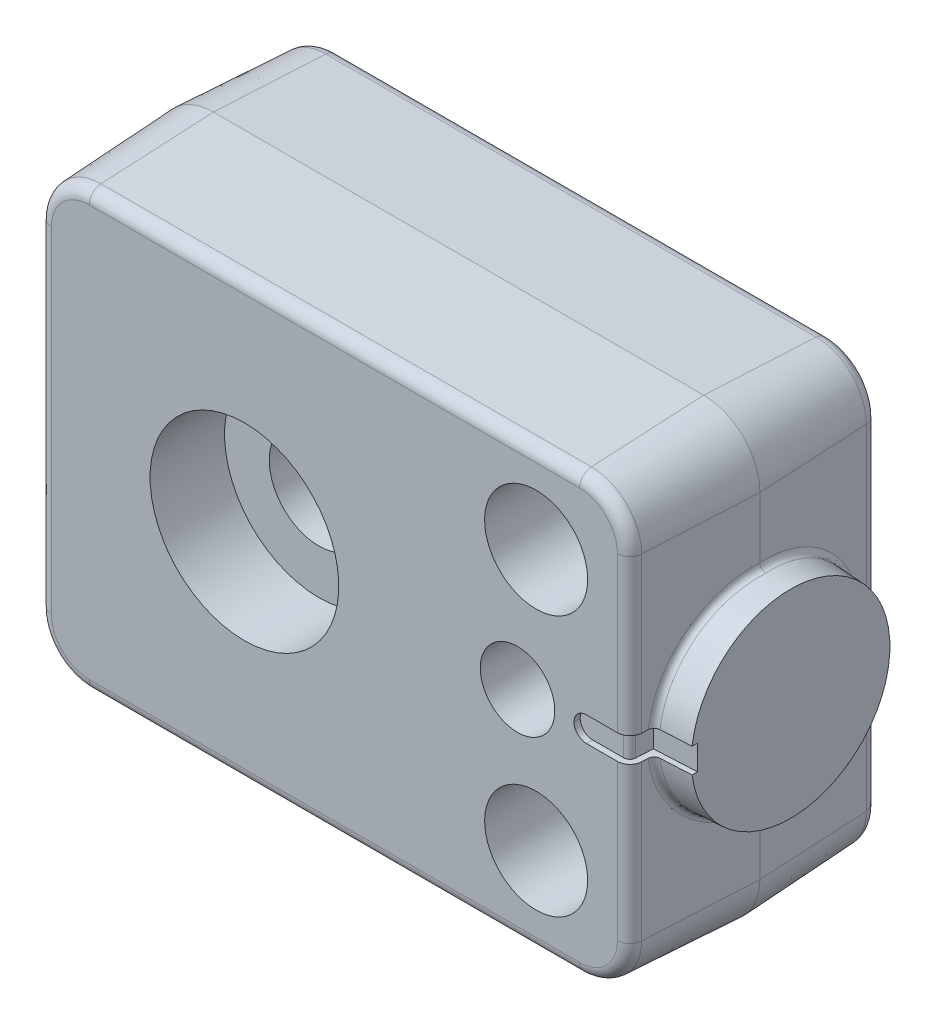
ISO-10303-21;
HEADER;
FILE_DESCRIPTION(('STEP AP214'),'2;1');
FILE_NAME('part.step','',(''),(''),'','','');
FILE_SCHEMA(('AUTOMOTIVE_DESIGN { 1 0 10303 214 1 1 1 1 }'));
ENDSEC;
DATA;
#1=APPLICATION_CONTEXT('core data for automotive mechanical design processes');
#2=APPLICATION_PROTOCOL_DEFINITION('international standard','automotive_design',2000,#1);
#3=PRODUCT_CONTEXT('',#1,'mechanical');
#4=PRODUCT('Part','Part','',(#3));
#5=PRODUCT_RELATED_PRODUCT_CATEGORY('part','',(#4));
#6=PRODUCT_DEFINITION_FORMATION('','',#4);
#7=PRODUCT_DEFINITION_CONTEXT('part definition',#1,'design');
#8=PRODUCT_DEFINITION('design','',#6,#7);
#9=PRODUCT_DEFINITION_SHAPE('','',#8);
#10=(LENGTH_UNIT() NAMED_UNIT(*) SI_UNIT(.MILLI.,.METRE.));
#11=(NAMED_UNIT(*) PLANE_ANGLE_UNIT() SI_UNIT($,.RADIAN.));
#12=(NAMED_UNIT(*) SI_UNIT($,.STERADIAN.) SOLID_ANGLE_UNIT());
#13=UNCERTAINTY_MEASURE_WITH_UNIT(LENGTH_MEASURE(1.E-05),#10,'distance_accuracy_value','');
#14=(GEOMETRIC_REPRESENTATION_CONTEXT(3) GLOBAL_UNCERTAINTY_ASSIGNED_CONTEXT((#13)) GLOBAL_UNIT_ASSIGNED_CONTEXT((#10,
#11,#12)) REPRESENTATION_CONTEXT('',''));
#15=CARTESIAN_POINT('',(0.,0.,0.));
#16=DIRECTION('',(0.,0.,1.));
#17=DIRECTION('',(1.,0.,0.));
#18=AXIS2_PLACEMENT_3D('',#15,#16,#17);
#19=CARTESIAN_POINT('',(-16.5,-17.5,0.));
#20=DIRECTION('',(0.,0.,-1.));
#21=DIRECTION('',(0.,1.,0.));
#22=AXIS2_PLACEMENT_3D('',#19,#20,#21);
#23=PLANE('',#22);
#24=CARTESIAN_POINT('',(23.5,-10.5,0.));
#25=DIRECTION('',(0.,0.,1.));
#26=DIRECTION('',(0.,-1.,0.));
#27=AXIS2_PLACEMENT_3D('',#24,#25,#26);
#28=CIRCLE('',#27,2.3);
#29=CARTESIAN_POINT('',(23.5,-12.8,0.));
#30=VERTEX_POINT('',#29);
#31=EDGE_CURVE('E306',#30,#30,#28,.T.);
#32=ORIENTED_EDGE('',*,*,#31,.T.);
#33=EDGE_LOOP('',(#32));
#34=FACE_BOUND('',#33,.T.);
#35=DIRECTION('',(1.,0.,0.));
#36=VECTOR('',#35,1.);
#37=CARTESIAN_POINT('',(-16.5,-16.5510354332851,0.));
#38=LINE('',#37,#36);
#39=CARTESIAN_POINT('',(27.,-16.5510354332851,0.));
#40=VERTEX_POINT('',#39);
#41=CARTESIAN_POINT('',(-12.5,-16.5510354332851,0.));
#42=VERTEX_POINT('',#41);
#43=EDGE_CURVE('E246',#40,#42,#38,.F.);
#44=ORIENTED_EDGE('',*,*,#43,.T.);
#45=CARTESIAN_POINT('',(-12.5,-13.5,0.));
#46=DIRECTION('',(0.,0.,-1.));
#47=DIRECTION('',(0.,1.,0.));
#48=AXIS2_PLACEMENT_3D('',#45,#46,#47);
#49=CIRCLE('',#48,3.05103543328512);
#50=CARTESIAN_POINT('',(-15.5510354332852,-13.5,0.));
#51=VERTEX_POINT('',#50);
#52=EDGE_CURVE('E285',#42,#51,#49,.T.);
#53=ORIENTED_EDGE('',*,*,#52,.T.);
#54=DIRECTION('',(0.,-1.,0.));
#55=VECTOR('',#54,1.);
#56=CARTESIAN_POINT('',(-15.5510354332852,-17.5,0.));
#57=LINE('',#56,#55);
#58=CARTESIAN_POINT('',(-15.5510354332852,13.5,0.));
#59=VERTEX_POINT('',#58);
#60=EDGE_CURVE('E283',#51,#59,#57,.F.);
#61=ORIENTED_EDGE('',*,*,#60,.T.);
#62=CARTESIAN_POINT('',(-12.5,13.5,0.));
#63=DIRECTION('',(0.,0.,-1.));
#64=DIRECTION('',(0.,1.,0.));
#65=AXIS2_PLACEMENT_3D('',#62,#63,#64);
#66=CIRCLE('',#65,3.05103543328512);
#67=CARTESIAN_POINT('',(-12.5,16.5510354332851,0.));
#68=VERTEX_POINT('',#67);
#69=EDGE_CURVE('E281',#59,#68,#66,.T.);
#70=ORIENTED_EDGE('',*,*,#69,.T.);
#71=DIRECTION('',(-1.,0.,0.));
#72=VECTOR('',#71,1.);
#73=CARTESIAN_POINT('',(-16.5,16.5510354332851,0.));
#74=LINE('',#73,#72);
#75=CARTESIAN_POINT('',(27.,16.5510354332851,0.));
#76=VERTEX_POINT('',#75);
#77=EDGE_CURVE('E279',#68,#76,#74,.F.);
#78=ORIENTED_EDGE('',*,*,#77,.T.);
#79=CARTESIAN_POINT('',(27.,13.5,0.));
#80=DIRECTION('',(0.,0.,-1.));
#81=DIRECTION('',(0.,1.,0.));
#82=AXIS2_PLACEMENT_3D('',#79,#80,#81);
#83=CIRCLE('',#82,3.05103543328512);
#84=CARTESIAN_POINT('',(30.0510354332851,13.5,0.));
#85=VERTEX_POINT('',#84);
#86=EDGE_CURVE('E277',#76,#85,#83,.T.);
#87=ORIENTED_EDGE('',*,*,#86,.T.);
#88=DIRECTION('',(0.,1.,0.));
#89=VECTOR('',#88,1.);
#90=CARTESIAN_POINT('',(30.0510354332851,-17.5,0.));
#91=LINE('',#90,#89);
#92=CARTESIAN_POINT('',(30.0510354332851,-13.5,0.));
#93=VERTEX_POINT('',#92);
#94=EDGE_CURVE('E249',#85,#93,#91,.F.);
#95=ORIENTED_EDGE('',*,*,#94,.T.);
#96=CARTESIAN_POINT('',(27.,-13.5,0.));
#97=DIRECTION('',(0.,0.,-1.));
#98=DIRECTION('',(0.,1.,0.));
#99=AXIS2_PLACEMENT_3D('',#96,#97,#98);
#100=CIRCLE('',#99,3.05103543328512);
#101=EDGE_CURVE('E241',#93,#40,#100,.T.);
#102=ORIENTED_EDGE('',*,*,#101,.T.);
#103=EDGE_LOOP('',(#44,#53,#61,#70,#78,#87,#95,#102));
#104=FACE_BOUND('',#103,.T.);
#105=CARTESIAN_POINT('',(23.5,10.5,0.));
#106=DIRECTION('',(0.,0.,1.));
#107=DIRECTION('',(0.,-1.,0.));
#108=AXIS2_PLACEMENT_3D('',#105,#106,#107);
#109=CIRCLE('',#108,2.3);
#110=CARTESIAN_POINT('',(23.5,8.2,0.));
#111=VERTEX_POINT('',#110);
#112=EDGE_CURVE('E843',#111,#111,#109,.T.);
#113=ORIENTED_EDGE('',*,*,#112,.T.);
#114=EDGE_LOOP('',(#113));
#115=FACE_BOUND('',#114,.T.);
#116=CARTESIAN_POINT('',(0.,0.,0.));
#117=DIRECTION('',(0.,0.,1.));
#118=DIRECTION('',(0.,-1.,0.));
#119=AXIS2_PLACEMENT_3D('',#116,#117,#118);
#120=CIRCLE('',#119,7.6);
#121=CARTESIAN_POINT('',(0.,-7.6,0.));
#122=VERTEX_POINT('',#121);
#123=EDGE_CURVE('E862',#122,#122,#120,.T.);
#124=ORIENTED_EDGE('',*,*,#123,.T.);
#125=EDGE_LOOP('',(#124));
#126=FACE_BOUND('',#125,.T.);
#127=ADVANCED_FACE('F16',(#34,#104,#115,#126),#23,.T.);
#128=CARTESIAN_POINT('',(27.55,0.,12.4957615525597));
#129=DIRECTION('',(0.,0.,1.));
#130=DIRECTION('',(0.,-1.,0.));
#131=AXIS2_PLACEMENT_3D('',#128,#129,#130);
#132=CYLINDRICAL_SURFACE('',#131,1.);
#133=DIRECTION('',(0.,0.,1.));
#134=VECTOR('',#133,1.);
#135=CARTESIAN_POINT('',(27.55,1.,12.4957615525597));
#136=LINE('',#135,#134);
#137=CARTESIAN_POINT('',(27.55,1.,20.));
#138=VERTEX_POINT('',#137);
#139=CARTESIAN_POINT('',(27.55,1.,19.5));
#140=VERTEX_POINT('',#139);
#141=EDGE_CURVE('E705',#138,#140,#136,.F.);
#142=ORIENTED_EDGE('',*,*,#141,.F.);
#143=CARTESIAN_POINT('',(27.55,0.,20.));
#144=DIRECTION('',(0.,0.,-1.));
#145=DIRECTION('',(0.,1.,0.));
#146=AXIS2_PLACEMENT_3D('',#143,#144,#145);
#147=CIRCLE('',#146,1.);
#148=CARTESIAN_POINT('',(26.55,0.,20.));
#149=VERTEX_POINT('',#148);
#150=EDGE_CURVE('E550',#138,#149,#147,.F.);
#151=ORIENTED_EDGE('',*,*,#150,.T.);
#152=DIRECTION('',(0.,0.,1.));
#153=VECTOR('',#152,1.);
#154=CARTESIAN_POINT('',(26.55,0.,12.4957615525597));
#155=LINE('',#154,#153);
#156=CARTESIAN_POINT('',(26.55,0.,19.5));
#157=VERTEX_POINT('',#156);
#158=EDGE_CURVE('E698',#149,#157,#155,.F.);
#159=ORIENTED_EDGE('',*,*,#158,.T.);
#160=CARTESIAN_POINT('',(27.55,0.,19.5));
#161=DIRECTION('',(0.,0.,1.));
#162=DIRECTION('',(-1.,0.,0.));
#163=AXIS2_PLACEMENT_3D('',#160,#161,#162);
#164=CIRCLE('',#163,1.);
#165=EDGE_CURVE('E707',#140,#157,#164,.T.);
#166=ORIENTED_EDGE('',*,*,#165,.F.);
#167=EDGE_LOOP('',(#142,#151,#159,#166));
#168=FACE_BOUND('',#167,.T.);
#169=ADVANCED_FACE('F493',(#168),#132,.F.);
#170=CARTESIAN_POINT('',(27.55,0.,12.4957615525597));
#171=DIRECTION('',(0.,0.,-1.));
#172=DIRECTION('',(0.,1.,0.));
#173=AXIS2_PLACEMENT_3D('',#170,#171,#172);
#174=CYLINDRICAL_SURFACE('',#173,1.);
#175=DIRECTION('',(0.,0.,1.));
#176=VECTOR('',#175,1.);
#177=CARTESIAN_POINT('',(27.55,-1.,12.4957615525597));
#178=LINE('',#177,#176);
#179=CARTESIAN_POINT('',(27.55,-1.,19.5));
#180=VERTEX_POINT('',#179);
#181=CARTESIAN_POINT('',(27.55,-1.,20.));
#182=VERTEX_POINT('',#181);
#183=EDGE_CURVE('E695',#180,#182,#178,.T.);
#184=ORIENTED_EDGE('',*,*,#183,.F.);
#185=CARTESIAN_POINT('',(27.55,0.,19.5));
#186=DIRECTION('',(0.,0.,1.));
#187=DIRECTION('',(-1.,0.,0.));
#188=AXIS2_PLACEMENT_3D('',#185,#186,#187);
#189=CIRCLE('',#188,1.);
#190=EDGE_CURVE('E701',#157,#180,#189,.T.);
#191=ORIENTED_EDGE('',*,*,#190,.F.);
#192=ORIENTED_EDGE('',*,*,#158,.F.);
#193=CARTESIAN_POINT('',(27.55,0.,20.));
#194=DIRECTION('',(0.,0.,-1.));
#195=DIRECTION('',(0.,1.,0.));
#196=AXIS2_PLACEMENT_3D('',#193,#194,#195);
#197=CIRCLE('',#196,1.);
#198=EDGE_CURVE('E703',#149,#182,#197,.F.);
#199=ORIENTED_EDGE('',*,*,#198,.T.);
#200=EDGE_LOOP('',(#184,#191,#192,#199));
#201=FACE_BOUND('',#200,.T.);
#202=ADVANCED_FACE('F500',(#201),#174,.F.);
#203=CARTESIAN_POINT('',(31.,17.5,20.));
#204=DIRECTION('',(0.998629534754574,0.,0.052335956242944));
#205=DIRECTION('',(-0.052335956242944,0.,0.998629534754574));
#206=AXIS2_PLACEMENT_3D('',#203,#204,#205);
#207=PLANE('',#206);
#208=DIRECTION('',(-0.0523359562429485,0.,0.998629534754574));
#209=VECTOR('',#208,1.);
#210=CARTESIAN_POINT('',(31.3902174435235,1.,12.5542076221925));
#211=LINE('',#210,#209);
#212=CARTESIAN_POINT('',(31.0763358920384,1.,18.5434244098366));
#213=VERTEX_POINT('',#212);
#214=CARTESIAN_POINT('',(31.0496649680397,1.,19.0523359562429));
#215=VERTEX_POINT('',#214);
#216=EDGE_CURVE('E375',#213,#215,#211,.T.);
#217=ORIENTED_EDGE('',*,*,#216,.F.);
#218=CARTESIAN_POINT('',(31.5242106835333,0.,9.99746429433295));
#219=DIRECTION('',(0.998629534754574,0.,0.052335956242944));
#220=DIRECTION('',(-0.0523359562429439,0.,0.998629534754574));
#221=AXIS2_PLACEMENT_3D('',#218,#219,#220);
#222=ELLIPSE('',#221,8.61607684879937,8.60423636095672);
#223=CARTESIAN_POINT('',(31.5240777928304,8.60423598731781,10.));
#224=VERTEX_POINT('',#223);
#225=EDGE_CURVE('E537',#213,#224,#222,.F.);
#226=ORIENTED_EDGE('',*,*,#225,.T.);
#227=DIRECTION('',(0.,1.,0.));
#228=VECTOR('',#227,1.);
#229=CARTESIAN_POINT('',(31.5240777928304,17.5,10.));
#230=LINE('',#229,#228);
#231=CARTESIAN_POINT('',(31.5240777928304,13.5,10.));
#232=VERTEX_POINT('',#231);
#233=EDGE_CURVE('E527',#224,#232,#230,.T.);
#234=ORIENTED_EDGE('',*,*,#233,.T.);
#235=DIRECTION('',(0.0523359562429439,0.,-0.998629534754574));
#236=VECTOR('',#235,1.);
#237=CARTESIAN_POINT('',(31.,13.5,20.));
#238=LINE('',#237,#236);
#239=CARTESIAN_POINT('',(31.0496649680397,13.5,19.0523359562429));
#240=VERTEX_POINT('',#239);
#241=EDGE_CURVE('E637',#232,#240,#238,.F.);
#242=ORIENTED_EDGE('',*,*,#241,.T.);
#243=DIRECTION('',(0.,1.,0.));
#244=VECTOR('',#243,1.);
#245=CARTESIAN_POINT('',(31.0496649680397,17.5,19.0523359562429));
#246=LINE('',#245,#244);
#247=EDGE_CURVE('E666',#240,#215,#246,.F.);
#248=ORIENTED_EDGE('',*,*,#247,.T.);
#249=EDGE_LOOP('',(#217,#226,#234,#242,#248));
#250=FACE_BOUND('',#249,.T.);
#251=ADVANCED_FACE('F463',(#250),#207,.T.);
#252=CARTESIAN_POINT('',(-16.5,-17.5,20.));
#253=DIRECTION('',(0.,0.,-1.));
#254=DIRECTION('',(0.,1.,0.));
#255=AXIS2_PLACEMENT_3D('',#252,#253,#254);
#256=PLANE('',#255);
#257=CARTESIAN_POINT('',(22.,0.,20.));
#258=DIRECTION('',(0.,0.,1.));
#259=DIRECTION('',(0.,-1.,0.));
#260=AXIS2_PLACEMENT_3D('',#257,#258,#259);
#261=CIRCLE('',#260,3.);
#262=CARTESIAN_POINT('',(22.,-3.,20.));
#263=VERTEX_POINT('',#262);
#264=EDGE_CURVE('E868',#263,#263,#261,.T.);
#265=ORIENTED_EDGE('',*,*,#264,.F.);
#266=EDGE_LOOP('',(#265));
#267=FACE_BOUND('',#266,.T.);
#268=CARTESIAN_POINT('',(0.,0.,20.));
#269=DIRECTION('',(0.,0.,1.));
#270=DIRECTION('',(0.,-1.,0.));
#271=AXIS2_PLACEMENT_3D('',#268,#269,#270);
#272=CIRCLE('',#271,7.6);
#273=CARTESIAN_POINT('',(0.,-7.6,20.));
#274=VERTEX_POINT('',#273);
#275=EDGE_CURVE('E856',#274,#274,#272,.T.);
#276=ORIENTED_EDGE('',*,*,#275,.F.);
#277=EDGE_LOOP('',(#276));
#278=FACE_BOUND('',#277,.T.);
#279=CARTESIAN_POINT('',(23.5,10.5,20.));
#280=DIRECTION('',(0.,0.,1.));
#281=DIRECTION('',(0.,-1.,0.));
#282=AXIS2_PLACEMENT_3D('',#279,#280,#281);
#283=CIRCLE('',#282,4.15);
#284=CARTESIAN_POINT('',(23.5,6.35,20.));
#285=VERTEX_POINT('',#284);
#286=EDGE_CURVE('E852',#285,#285,#283,.T.);
#287=ORIENTED_EDGE('',*,*,#286,.F.);
#288=EDGE_LOOP('',(#287));
#289=FACE_BOUND('',#288,.T.);
#290=CARTESIAN_POINT('',(23.5,-10.5,20.));
#291=DIRECTION('',(0.,0.,1.));
#292=DIRECTION('',(0.,-1.,0.));
#293=AXIS2_PLACEMENT_3D('',#290,#291,#292);
#294=CIRCLE('',#293,4.15);
#295=CARTESIAN_POINT('',(23.5,-14.65,20.));
#296=VERTEX_POINT('',#295);
#297=EDGE_CURVE('E840',#296,#296,#294,.T.);
#298=ORIENTED_EDGE('',*,*,#297,.F.);
#299=EDGE_LOOP('',(#298));
#300=FACE_BOUND('',#299,.T.);
#301=DIRECTION('',(-1.,0.,0.));
#302=VECTOR('',#301,1.);
#303=CARTESIAN_POINT('',(30.275,1.,20.));
#304=LINE('',#303,#302);
#305=CARTESIAN_POINT('',(30.0510354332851,1.,20.));
#306=VERTEX_POINT('',#305);
#307=EDGE_CURVE('E379',#306,#138,#304,.T.);
#308=ORIENTED_EDGE('',*,*,#307,.F.);
#309=DIRECTION('',(0.,-1.,0.));
#310=VECTOR('',#309,1.);
#311=CARTESIAN_POINT('',(30.0510354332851,-17.5,20.));
#312=LINE('',#311,#310);
#313=CARTESIAN_POINT('',(30.0510354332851,13.5,20.));
#314=VERTEX_POINT('',#313);
#315=EDGE_CURVE('E647',#306,#314,#312,.F.);
#316=ORIENTED_EDGE('',*,*,#315,.T.);
#317=CARTESIAN_POINT('',(27.,13.5,20.));
#318=DIRECTION('',(0.,0.,-1.));
#319=DIRECTION('',(0.,1.,0.));
#320=AXIS2_PLACEMENT_3D('',#317,#318,#319);
#321=CIRCLE('',#320,3.05103543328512);
#322=CARTESIAN_POINT('',(27.,16.5510354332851,20.));
#323=VERTEX_POINT('',#322);
#324=EDGE_CURVE('E651',#314,#323,#321,.F.);
#325=ORIENTED_EDGE('',*,*,#324,.T.);
#326=DIRECTION('',(1.,0.,0.));
#327=VECTOR('',#326,1.);
#328=CARTESIAN_POINT('',(-16.5,16.5510354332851,20.));
#329=LINE('',#328,#327);
#330=CARTESIAN_POINT('',(-12.5,16.5510354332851,20.));
#331=VERTEX_POINT('',#330);
#332=EDGE_CURVE('E653',#323,#331,#329,.F.);
#333=ORIENTED_EDGE('',*,*,#332,.T.);
#334=CARTESIAN_POINT('',(-12.5,13.5,20.));
#335=DIRECTION('',(0.,0.,-1.));
#336=DIRECTION('',(0.,1.,0.));
#337=AXIS2_PLACEMENT_3D('',#334,#335,#336);
#338=CIRCLE('',#337,3.05103543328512);
#339=CARTESIAN_POINT('',(-15.5510354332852,13.5,20.));
#340=VERTEX_POINT('',#339);
#341=EDGE_CURVE('E655',#331,#340,#338,.F.);
#342=ORIENTED_EDGE('',*,*,#341,.T.);
#343=DIRECTION('',(0.,1.,0.));
#344=VECTOR('',#343,1.);
#345=CARTESIAN_POINT('',(-15.5510354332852,-17.5,20.));
#346=LINE('',#345,#344);
#347=CARTESIAN_POINT('',(-15.5510354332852,-13.5,20.));
#348=VERTEX_POINT('',#347);
#349=EDGE_CURVE('E657',#340,#348,#346,.F.);
#350=ORIENTED_EDGE('',*,*,#349,.T.);
#351=CARTESIAN_POINT('',(-12.5,-13.5,20.));
#352=DIRECTION('',(0.,0.,-1.));
#353=DIRECTION('',(0.,1.,0.));
#354=AXIS2_PLACEMENT_3D('',#351,#352,#353);
#355=CIRCLE('',#354,3.05103543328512);
#356=CARTESIAN_POINT('',(-12.5,-16.5510354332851,20.));
#357=VERTEX_POINT('',#356);
#358=EDGE_CURVE('E602',#348,#357,#355,.F.);
#359=ORIENTED_EDGE('',*,*,#358,.T.);
#360=DIRECTION('',(-1.,0.,0.));
#361=VECTOR('',#360,1.);
#362=CARTESIAN_POINT('',(-16.5,-16.5510354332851,20.));
#363=LINE('',#362,#361);
#364=CARTESIAN_POINT('',(27.,-16.5510354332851,20.));
#365=VERTEX_POINT('',#364);
#366=EDGE_CURVE('E643',#357,#365,#363,.F.);
#367=ORIENTED_EDGE('',*,*,#366,.T.);
#368=CARTESIAN_POINT('',(27.,-13.5,20.));
#369=DIRECTION('',(0.,0.,-1.));
#370=DIRECTION('',(0.,1.,0.));
#371=AXIS2_PLACEMENT_3D('',#368,#369,#370);
#372=CIRCLE('',#371,3.05103543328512);
#373=CARTESIAN_POINT('',(30.0510354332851,-13.5,20.));
#374=VERTEX_POINT('',#373);
#375=EDGE_CURVE('E645',#365,#374,#372,.F.);
#376=ORIENTED_EDGE('',*,*,#375,.T.);
#377=CARTESIAN_POINT('',(30.0510354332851,-1.,20.));
#378=VERTEX_POINT('',#377);
#379=EDGE_CURVE('E648',#374,#378,#312,.F.);
#380=ORIENTED_EDGE('',*,*,#379,.T.);
#381=DIRECTION('',(-1.,0.,0.));
#382=VECTOR('',#381,1.);
#383=CARTESIAN_POINT('',(30.275,-1.,20.));
#384=LINE('',#383,#382);
#385=EDGE_CURVE('E396',#378,#182,#384,.T.);
#386=ORIENTED_EDGE('',*,*,#385,.T.);
#387=ORIENTED_EDGE('',*,*,#198,.F.);
#388=ORIENTED_EDGE('',*,*,#150,.F.);
#389=EDGE_LOOP('',(#308,#316,#325,#333,#342,#350,#359,#367,#376,#380,#386,#387,#388));
#390=FACE_BOUND('',#389,.T.);
#391=ADVANCED_FACE('F715',(#267,#278,#289,#300,#390),#256,.F.);
#392=CARTESIAN_POINT('',(30.0510354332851,-17.5,19.));
#393=DIRECTION('',(0.,-1.,0.));
#394=DIRECTION('',(0.,0.,-1.));
#395=AXIS2_PLACEMENT_3D('',#392,#393,#394);
#396=CYLINDRICAL_SURFACE('',#395,1.);
#397=ORIENTED_EDGE('',*,*,#315,.F.);
#398=CARTESIAN_POINT('',(30.0510354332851,1.,19.));
#399=DIRECTION('',(0.,-1.,0.));
#400=DIRECTION('',(0.,0.,-1.));
#401=AXIS2_PLACEMENT_3D('',#398,#399,#400);
#402=CIRCLE('',#401,1.);
#403=EDGE_CURVE('E377',#215,#306,#402,.T.);
#404=ORIENTED_EDGE('',*,*,#403,.F.);
#405=ORIENTED_EDGE('',*,*,#247,.F.);
#406=CARTESIAN_POINT('',(30.0510354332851,13.5,19.));
#407=DIRECTION('',(0.,-1.,0.));
#408=DIRECTION('',(0.,0.,-1.));
#409=AXIS2_PLACEMENT_3D('',#406,#407,#408);
#410=CIRCLE('',#409,1.);
#411=EDGE_CURVE('E685',#240,#314,#410,.T.);
#412=ORIENTED_EDGE('',*,*,#411,.T.);
#413=EDGE_LOOP('',(#397,#404,#405,#412));
#414=FACE_BOUND('',#413,.T.);
#415=ADVANCED_FACE('F570',(#414),#396,.T.);
#416=CARTESIAN_POINT('',(34.,3.13139604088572,10.));
#417=DIRECTION('',(-1.,0.,0.));
#418=DIRECTION('',(0.,0.,-1.));
#419=AXIS2_PLACEMENT_3D('',#416,#417,#418);
#420=PLANE('',#419);
#421=DIRECTION('',(0.,0.,1.));
#422=VECTOR('',#421,1.);
#423=CARTESIAN_POINT('',(34.,1.,10.));
#424=LINE('',#423,#422);
#425=CARTESIAN_POINT('',(34.,1.,17.499313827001));
#426=VERTEX_POINT('',#425);
#427=CARTESIAN_POINT('',(34.,1.,17.9372539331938));
#428=VERTEX_POINT('',#427);
#429=EDGE_CURVE('E692',#426,#428,#424,.T.);
#430=ORIENTED_EDGE('',*,*,#429,.F.);
#431=DIRECTION('',(0.,-1.,0.));
#432=VECTOR('',#431,1.);
#433=CARTESIAN_POINT('',(34.,1.,17.499313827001));
#434=LINE('',#433,#432);
#435=CARTESIAN_POINT('',(34.,-1.,17.499313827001));
#436=VERTEX_POINT('',#435);
#437=EDGE_CURVE('E405',#426,#436,#434,.T.);
#438=ORIENTED_EDGE('',*,*,#437,.T.);
#439=DIRECTION('',(0.,0.,1.));
#440=VECTOR('',#439,1.);
#441=CARTESIAN_POINT('',(34.,-1.,10.));
#442=LINE('',#441,#440);
#443=CARTESIAN_POINT('',(34.,-1.,17.9372539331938));
#444=VERTEX_POINT('',#443);
#445=EDGE_CURVE('E673',#436,#444,#442,.T.);
#446=ORIENTED_EDGE('',*,*,#445,.T.);
#447=CARTESIAN_POINT('',(34.,0.,10.));
#448=DIRECTION('',(-1.,0.,0.));
#449=DIRECTION('',(0.,0.,-1.));
#450=AXIS2_PLACEMENT_3D('',#447,#448,#449);
#451=CIRCLE('',#450,8.);
#452=EDGE_CURVE('E624',#428,#444,#451,.T.);
#453=ORIENTED_EDGE('',*,*,#452,.F.);
#454=EDGE_LOOP('',(#430,#438,#446,#453));
#455=FACE_BOUND('',#454,.T.);
#456=ADVANCED_FACE('F462',(#455),#420,.F.);
#457=CARTESIAN_POINT('',(31.5240777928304,-13.5,10.));
#458=VERTEX_POINT('',#457);
#459=CARTESIAN_POINT('',(31.5240777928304,-8.60423598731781,10.));
#460=VERTEX_POINT('',#459);
#461=EDGE_CURVE('E524',#458,#460,#230,.T.);
#462=ORIENTED_EDGE('',*,*,#461,.T.);
#463=CARTESIAN_POINT('',(31.5242106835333,0.,9.99746429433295));
#464=DIRECTION('',(0.998629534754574,0.,0.052335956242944));
#465=DIRECTION('',(-0.0523359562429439,0.,0.998629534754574));
#466=AXIS2_PLACEMENT_3D('',#463,#464,#465);
#467=ELLIPSE('',#466,8.61607684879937,8.60423636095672);
#468=CARTESIAN_POINT('',(31.0763358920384,-1.,18.5434244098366));
#469=VERTEX_POINT('',#468);
#470=EDGE_CURVE('E36',#460,#469,#467,.F.);
#471=ORIENTED_EDGE('',*,*,#470,.T.);
#472=DIRECTION('',(0.052335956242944,0.,-0.998629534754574));
#473=VECTOR('',#472,1.);
#474=CARTESIAN_POINT('',(31.,-1.,20.));
#475=LINE('',#474,#473);
#476=CARTESIAN_POINT('',(31.0496649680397,-1.,19.0523359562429));
#477=VERTEX_POINT('',#476);
#478=EDGE_CURVE('E419',#469,#477,#475,.F.);
#479=ORIENTED_EDGE('',*,*,#478,.T.);
#480=CARTESIAN_POINT('',(31.0496649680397,-13.5,19.0523359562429));
#481=VERTEX_POINT('',#480);
#482=EDGE_CURVE('E665',#477,#481,#246,.F.);
#483=ORIENTED_EDGE('',*,*,#482,.T.);
#484=DIRECTION('',(0.0523359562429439,0.,-0.998629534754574));
#485=VECTOR('',#484,1.);
#486=CARTESIAN_POINT('',(31.,-13.5,20.));
#487=LINE('',#486,#485);
#488=EDGE_CURVE('E640',#481,#458,#487,.T.);
#489=ORIENTED_EDGE('',*,*,#488,.T.);
#490=EDGE_LOOP('',(#462,#471,#479,#483,#489));
#491=FACE_BOUND('',#490,.T.);
#492=ADVANCED_FACE('F456',(#491),#207,.T.);
#493=CARTESIAN_POINT('',(31.,-17.5,20.));
#494=DIRECTION('',(0.,-0.998629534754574,0.052335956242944));
#495=DIRECTION('',(0.,-0.052335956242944,-0.998629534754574));
#496=AXIS2_PLACEMENT_3D('',#493,#494,#495);
#497=PLANE('',#496);
#498=DIRECTION('',(0.,-0.0523359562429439,-0.998629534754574));
#499=VECTOR('',#498,1.);
#500=CARTESIAN_POINT('',(27.,-17.5,20.));
#501=LINE('',#500,#499);
#502=CARTESIAN_POINT('',(27.,-18.0240777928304,10.));
#503=VERTEX_POINT('',#502);
#504=CARTESIAN_POINT('',(27.,-17.5496649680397,19.0523359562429));
#505=VERTEX_POINT('',#504);
#506=EDGE_CURVE('E636',#503,#505,#501,.F.);
#507=ORIENTED_EDGE('',*,*,#506,.T.);
#508=DIRECTION('',(1.,0.,0.));
#509=VECTOR('',#508,1.);
#510=CARTESIAN_POINT('',(31.,-17.5496649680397,19.0523359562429));
#511=LINE('',#510,#509);
#512=CARTESIAN_POINT('',(-12.5,-17.5496649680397,19.0523359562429));
#513=VERTEX_POINT('',#512);
#514=EDGE_CURVE('E671',#505,#513,#511,.F.);
#515=ORIENTED_EDGE('',*,*,#514,.T.);
#516=DIRECTION('',(0.,-0.0523359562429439,-0.998629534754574));
#517=VECTOR('',#516,1.);
#518=CARTESIAN_POINT('',(-12.5,-17.5,20.));
#519=LINE('',#518,#517);
#520=CARTESIAN_POINT('',(-12.5,-18.0240777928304,10.));
#521=VERTEX_POINT('',#520);
#522=EDGE_CURVE('E619',#513,#521,#519,.T.);
#523=ORIENTED_EDGE('',*,*,#522,.T.);
#524=DIRECTION('',(1.,0.,0.));
#525=VECTOR('',#524,1.);
#526=CARTESIAN_POINT('',(31.,-18.0240777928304,10.));
#527=LINE('',#526,#525);
#528=EDGE_CURVE('E320',#521,#503,#527,.T.);
#529=ORIENTED_EDGE('',*,*,#528,.T.);
#530=EDGE_LOOP('',(#507,#515,#523,#529));
#531=FACE_BOUND('',#530,.T.);
#532=ADVANCED_FACE('F461',(#531),#497,.T.);
#533=CARTESIAN_POINT('',(31.,17.5,20.));
#534=DIRECTION('',(0.,0.998629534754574,0.052335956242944));
#535=DIRECTION('',(0.,-0.052335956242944,0.998629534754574));
#536=AXIS2_PLACEMENT_3D('',#533,#534,#535);
#537=PLANE('',#536);
#538=DIRECTION('',(0.,0.0523359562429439,-0.998629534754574));
#539=VECTOR('',#538,1.);
#540=CARTESIAN_POINT('',(-12.5,17.5,20.));
#541=LINE('',#540,#539);
#542=CARTESIAN_POINT('',(-12.5,18.0240777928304,10.));
#543=VERTEX_POINT('',#542);
#544=CARTESIAN_POINT('',(-12.5,17.5496649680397,19.0523359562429));
#545=VERTEX_POINT('',#544);
#546=EDGE_CURVE('E633',#543,#545,#541,.F.);
#547=ORIENTED_EDGE('',*,*,#546,.T.);
#548=DIRECTION('',(-1.,0.,0.));
#549=VECTOR('',#548,1.);
#550=CARTESIAN_POINT('',(31.,17.5496649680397,19.0523359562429));
#551=LINE('',#550,#549);
#552=CARTESIAN_POINT('',(27.,17.5496649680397,19.0523359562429));
#553=VERTEX_POINT('',#552);
#554=EDGE_CURVE('E661',#545,#553,#551,.F.);
#555=ORIENTED_EDGE('',*,*,#554,.T.);
#556=DIRECTION('',(0.,0.0523359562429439,-0.998629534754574));
#557=VECTOR('',#556,1.);
#558=CARTESIAN_POINT('',(27.,17.5,20.));
#559=LINE('',#558,#557);
#560=CARTESIAN_POINT('',(27.,18.0240777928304,10.));
#561=VERTEX_POINT('',#560);
#562=EDGE_CURVE('E626',#553,#561,#559,.T.);
#563=ORIENTED_EDGE('',*,*,#562,.T.);
#564=DIRECTION('',(-1.,0.,0.));
#565=VECTOR('',#564,1.);
#566=CARTESIAN_POINT('',(31.,18.0240777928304,10.));
#567=LINE('',#566,#565);
#568=EDGE_CURVE('E775',#561,#543,#567,.T.);
#569=ORIENTED_EDGE('',*,*,#568,.T.);
#570=EDGE_LOOP('',(#547,#555,#563,#569));
#571=FACE_BOUND('',#570,.T.);
#572=ADVANCED_FACE('F465',(#571),#537,.T.);
#573=CARTESIAN_POINT('',(-16.5,-17.5,20.));
#574=DIRECTION('',(-0.998629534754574,0.,0.052335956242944));
#575=DIRECTION('',(-0.052335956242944,0.,-0.998629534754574));
#576=AXIS2_PLACEMENT_3D('',#573,#574,#575);
#577=PLANE('',#576);
#578=DIRECTION('',(-0.0523359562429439,0.,-0.998629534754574));
#579=VECTOR('',#578,1.);
#580=CARTESIAN_POINT('',(-16.5,-13.5,20.));
#581=LINE('',#580,#579);
#582=CARTESIAN_POINT('',(-17.0240777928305,-13.5,10.));
#583=VERTEX_POINT('',#582);
#584=CARTESIAN_POINT('',(-16.5496649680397,-13.5,19.0523359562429));
#585=VERTEX_POINT('',#584);
#586=EDGE_CURVE('E617',#583,#585,#581,.F.);
#587=ORIENTED_EDGE('',*,*,#586,.T.);
#588=DIRECTION('',(0.,-1.,0.));
#589=VECTOR('',#588,1.);
#590=CARTESIAN_POINT('',(-16.5496649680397,-17.5,19.0523359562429));
#591=LINE('',#590,#589);
#592=CARTESIAN_POINT('',(-16.5496649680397,13.5,19.0523359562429));
#593=VERTEX_POINT('',#592);
#594=EDGE_CURVE('E608',#585,#593,#591,.F.);
#595=ORIENTED_EDGE('',*,*,#594,.T.);
#596=DIRECTION('',(-0.0523359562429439,0.,-0.998629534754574));
#597=VECTOR('',#596,1.);
#598=CARTESIAN_POINT('',(-16.5,13.5,20.));
#599=LINE('',#598,#597);
#600=CARTESIAN_POINT('',(-17.0240777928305,13.5,10.));
#601=VERTEX_POINT('',#600);
#602=EDGE_CURVE('E623',#593,#601,#599,.T.);
#603=ORIENTED_EDGE('',*,*,#602,.T.);
#604=DIRECTION('',(0.,-1.,0.));
#605=VECTOR('',#604,1.);
#606=CARTESIAN_POINT('',(-17.0240777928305,-17.5,10.));
#607=LINE('',#606,#605);
#608=EDGE_CURVE('E622',#601,#583,#607,.T.);
#609=ORIENTED_EDGE('',*,*,#608,.T.);
#610=EDGE_LOOP('',(#587,#595,#603,#609));
#611=FACE_BOUND('',#610,.T.);
#612=ADVANCED_FACE('F469',(#611),#577,.T.);
#613=CARTESIAN_POINT('',(-12.5,13.5,20.));
#614=DIRECTION('',(0.,0.,-1.));
#615=DIRECTION('',(0.,1.,0.));
#616=AXIS2_PLACEMENT_3D('',#613,#614,#615);
#617=CONICAL_SURFACE('',#616,4.,0.05235987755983);
#618=ORIENTED_EDGE('',*,*,#602,.F.);
#619=CARTESIAN_POINT('',(-12.5,13.5,19.0523359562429));
#620=DIRECTION('',(0.,0.,-1.));
#621=DIRECTION('',(0.,1.,0.));
#622=AXIS2_PLACEMENT_3D('',#619,#620,#621);
#623=CIRCLE('',#622,4.04966496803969);
#624=EDGE_CURVE('E612',#593,#545,#623,.T.);
#625=ORIENTED_EDGE('',*,*,#624,.T.);
#626=ORIENTED_EDGE('',*,*,#546,.F.);
#627=CARTESIAN_POINT('',(-12.5,13.5,10.));
#628=DIRECTION('',(0.,0.,-1.));
#629=DIRECTION('',(0.,1.,0.));
#630=AXIS2_PLACEMENT_3D('',#627,#628,#629);
#631=CIRCLE('',#630,4.52407779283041);
#632=EDGE_CURVE('E778',#543,#601,#631,.F.);
#633=ORIENTED_EDGE('',*,*,#632,.T.);
#634=EDGE_LOOP('',(#618,#625,#626,#633));
#635=FACE_BOUND('',#634,.T.);
#636=ADVANCED_FACE('F475',(#635),#617,.T.);
#637=CARTESIAN_POINT('',(-12.5,-13.5,20.));
#638=DIRECTION('',(0.,0.,-1.));
#639=DIRECTION('',(0.,1.,0.));
#640=AXIS2_PLACEMENT_3D('',#637,#638,#639);
#641=CONICAL_SURFACE('',#640,4.,0.05235987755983);
#642=ORIENTED_EDGE('',*,*,#522,.F.);
#643=CARTESIAN_POINT('',(-12.5,-13.5,19.0523359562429));
#644=DIRECTION('',(0.,0.,-1.));
#645=DIRECTION('',(0.,1.,0.));
#646=AXIS2_PLACEMENT_3D('',#643,#644,#645);
#647=CIRCLE('',#646,4.04966496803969);
#648=EDGE_CURVE('E599',#513,#585,#647,.T.);
#649=ORIENTED_EDGE('',*,*,#648,.T.);
#650=ORIENTED_EDGE('',*,*,#586,.F.);
#651=CARTESIAN_POINT('',(-12.5,-13.5,10.));
#652=DIRECTION('',(0.,0.,-1.));
#653=DIRECTION('',(0.,1.,0.));
#654=AXIS2_PLACEMENT_3D('',#651,#652,#653);
#655=CIRCLE('',#654,4.52407779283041);
#656=EDGE_CURVE('E764',#583,#521,#655,.F.);
#657=ORIENTED_EDGE('',*,*,#656,.T.);
#658=EDGE_LOOP('',(#642,#649,#650,#657));
#659=FACE_BOUND('',#658,.T.);
#660=ADVANCED_FACE('F471',(#659),#641,.T.);
#661=CARTESIAN_POINT('',(27.,-13.5,20.));
#662=DIRECTION('',(0.,0.,-1.));
#663=DIRECTION('',(0.,1.,0.));
#664=AXIS2_PLACEMENT_3D('',#661,#662,#663);
#665=CONICAL_SURFACE('',#664,4.,0.05235987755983);
#666=ORIENTED_EDGE('',*,*,#488,.F.);
#667=CARTESIAN_POINT('',(27.,-13.5,19.0523359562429));
#668=DIRECTION('',(0.,0.,-1.));
#669=DIRECTION('',(0.,1.,0.));
#670=AXIS2_PLACEMENT_3D('',#667,#668,#669);
#671=CIRCLE('',#670,4.04966496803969);
#672=EDGE_CURVE('E669',#481,#505,#671,.T.);
#673=ORIENTED_EDGE('',*,*,#672,.T.);
#674=ORIENTED_EDGE('',*,*,#506,.F.);
#675=CARTESIAN_POINT('',(27.,-13.5,10.));
#676=DIRECTION('',(0.,0.,-1.));
#677=DIRECTION('',(0.,1.,0.));
#678=AXIS2_PLACEMENT_3D('',#675,#676,#677);
#679=CIRCLE('',#678,4.52407779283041);
#680=EDGE_CURVE('E755',#503,#458,#679,.F.);
#681=ORIENTED_EDGE('',*,*,#680,.T.);
#682=EDGE_LOOP('',(#666,#673,#674,#681));
#683=FACE_BOUND('',#682,.T.);
#684=ADVANCED_FACE('F474',(#683),#665,.T.);
#685=CARTESIAN_POINT('',(27.,13.5,20.));
#686=DIRECTION('',(0.,0.,-1.));
#687=DIRECTION('',(0.,1.,0.));
#688=AXIS2_PLACEMENT_3D('',#685,#686,#687);
#689=CONICAL_SURFACE('',#688,4.,0.05235987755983);
#690=ORIENTED_EDGE('',*,*,#562,.F.);
#691=CARTESIAN_POINT('',(27.,13.5,19.0523359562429));
#692=DIRECTION('',(0.,0.,-1.));
#693=DIRECTION('',(0.,1.,0.));
#694=AXIS2_PLACEMENT_3D('',#691,#692,#693);
#695=CIRCLE('',#694,4.04966496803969);
#696=EDGE_CURVE('E663',#553,#240,#695,.T.);
#697=ORIENTED_EDGE('',*,*,#696,.T.);
#698=ORIENTED_EDGE('',*,*,#241,.F.);
#699=CARTESIAN_POINT('',(27.,13.5,10.));
#700=DIRECTION('',(0.,0.,-1.));
#701=DIRECTION('',(0.,1.,0.));
#702=AXIS2_PLACEMENT_3D('',#699,#700,#701);
#703=CIRCLE('',#702,4.52407779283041);
#704=EDGE_CURVE('E767',#232,#561,#703,.F.);
#705=ORIENTED_EDGE('',*,*,#704,.T.);
#706=EDGE_LOOP('',(#690,#697,#698,#705));
#707=FACE_BOUND('',#706,.T.);
#708=ADVANCED_FACE('F477',(#707),#689,.T.);
#709=CARTESIAN_POINT('',(34.,0.,10.));
#710=DIRECTION('',(-1.,0.,0.));
#711=DIRECTION('',(0.,0.,-1.));
#712=AXIS2_PLACEMENT_3D('',#709,#710,#711);
#713=CONICAL_SURFACE('',#712,8.,0.052359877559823);
#714=CARTESIAN_POINT('',(37.0455675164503,-1.,17.7763547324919));
#715=CARTESIAN_POINT('',(35.1879401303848,-1.,17.8745084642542));
#716=CARTESIAN_POINT('',(33.3303113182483,-1.,17.9726351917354));
#717=CARTESIAN_POINT('',(29.6150508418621,-1.,18.1688346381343));
#718=CARTESIAN_POINT('',(27.7574191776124,-1.,18.2669073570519));
#719=CARTESIAN_POINT('',(25.8997860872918,-1.,18.3649530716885));
#720=B_SPLINE_CURVE_WITH_KNOTS('',3,(#714,#715,#716,#717,#718,#719),.UNSPECIFIED.,.F.,.F.,(4,2,
4),(0.,5.58065613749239,11.1613122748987),.UNSPECIFIED.);
#721=CARTESIAN_POINT('',(31.5498711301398,-1.,18.0666586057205));
#722=VERTEX_POINT('',#721);
#723=EDGE_CURVE('E404',#444,#722,#720,.T.);
#724=ORIENTED_EDGE('',*,*,#723,.T.);
#725=CARTESIAN_POINT('',(31.5464268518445,0.,18.1285863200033));
#726=CARTESIAN_POINT('',(31.0968418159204,0.,18.152148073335));
#727=CARTESIAN_POINT('',(31.0732800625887,0.,18.6017331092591));
#728=CARTESIAN_POINT('',(31.5464268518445,-0.353705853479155,18.1285863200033));
#729=CARTESIAN_POINT('',(31.0968418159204,-0.355761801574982,18.152148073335));
#730=CARTESIAN_POINT('',(31.0732800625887,-0.37543294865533,18.6017331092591));
#731=CARTESIAN_POINT('',(31.547716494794,-0.707411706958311,18.1053986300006));
#732=CARTESIAN_POINT('',(31.0980677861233,-0.711571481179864,18.128755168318));
#733=CARTESIAN_POINT('',(31.0745697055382,-0.750865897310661,18.577125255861));
#734=CARTESIAN_POINT('',(31.552852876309,-1.40876818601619,18.0130472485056));
#735=CARTESIAN_POINT('',(31.1029489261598,-1.41695771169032,18.0356174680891));
#736=CARTESIAN_POINT('',(31.0797060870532,-1.49530783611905,18.4791172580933));
#737=CARTESIAN_POINT('',(31.5566997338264,-1.75641852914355,17.9438814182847));
#738=CARTESIAN_POINT('',(31.1066055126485,-1.76662652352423,17.965845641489));
#739=CARTESIAN_POINT('',(31.0835529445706,-1.86431652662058,18.4057148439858));
#740=CARTESIAN_POINT('',(31.5668846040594,-2.43971316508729,17.7607605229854));
#741=CARTESIAN_POINT('',(31.1162829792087,-2.45370866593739,17.7811885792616));
#742=CARTESIAN_POINT('',(31.0937378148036,-2.58959653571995,18.2113759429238));
#743=CARTESIAN_POINT('',(31.5732228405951,-2.77535637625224,17.6468014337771));
#744=CARTESIAN_POINT('',(31.1223065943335,-2.79120402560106,17.6662511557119));
#745=CARTESIAN_POINT('',(31.1000760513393,-2.94586670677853,18.0904351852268));
#746=CARTESIAN_POINT('',(31.588281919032,-3.428892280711,17.3760475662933));
#747=CARTESIAN_POINT('',(31.1366122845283,-3.44813745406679,17.3932823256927));
#748=CARTESIAN_POINT('',(31.1151351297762,-3.63957476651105,17.8030908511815));
#749=CARTESIAN_POINT('',(31.5970030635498,-3.74678271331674,17.2192473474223));
#750=CARTESIAN_POINT('',(31.1448982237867,-3.76764132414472,17.2351771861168));
#751=CARTESIAN_POINT('',(31.123856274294,-3.97701025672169,17.6366815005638));
#752=CARTESIAN_POINT('',(31.6166786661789,-4.35937325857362,16.8654978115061));
#753=CARTESIAN_POINT('',(31.1635837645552,-4.38311160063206,16.8786358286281));
#754=CARTESIAN_POINT('',(31.1435318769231,-4.62727668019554,17.2612486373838));
#755=CARTESIAN_POINT('',(31.6276334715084,-4.6540697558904,16.6685422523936));
#756=CARTESIAN_POINT('',(31.1739880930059,-4.67912275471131,16.6801094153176));
#757=CARTESIAN_POINT('',(31.1544866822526,-4.94010377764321,17.052218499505));
#758=CARTESIAN_POINT('',(31.6515889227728,-5.21523029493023,16.2378554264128));
#759=CARTESIAN_POINT('',(31.1967292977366,-5.24254391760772,16.2461813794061));
#760=CARTESIAN_POINT('',(31.178442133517,-5.53580232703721,16.5951212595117));
#761=CARTESIAN_POINT('',(31.6645899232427,-5.48168943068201,16.0041177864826));
#762=CARTESIAN_POINT('',(31.2090714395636,-5.50997430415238,16.0106792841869));
#763=CARTESIAN_POINT('',(31.1914431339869,-5.81866857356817,16.3470473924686));
#764=CARTESIAN_POINT('',(31.6924153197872,-5.98181690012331,15.5038690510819));
#765=CARTESIAN_POINT('',(31.2354741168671,-6.01167368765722,15.5068861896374));
#766=CARTESIAN_POINT('',(31.2192685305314,-6.34960683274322,15.8161071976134));
#767=CARTESIAN_POINT('',(31.7072400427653,-6.21547933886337,15.2373520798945));
#768=CARTESIAN_POINT('',(31.2495400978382,-6.24593711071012,15.2384912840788));
#769=CARTESIAN_POINT('',(31.2340932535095,-6.59767259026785,15.5332346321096));
#770=CARTESIAN_POINT('',(31.7384592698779,-6.64601665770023,14.6761071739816));
#771=CARTESIAN_POINT('',(31.2791471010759,-6.67732329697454,14.6735560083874));
#772=CARTESIAN_POINT('',(31.2653124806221,-7.05476633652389,14.9375362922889));
#773=CARTESIAN_POINT('',(31.7548540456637,-6.8428851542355,14.3813743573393));
#774=CARTESIAN_POINT('',(31.2946933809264,-6.87441478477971,14.3769153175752));
#775=CARTESIAN_POINT('',(31.2817072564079,-7.26378755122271,14.6247053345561));
#776=CARTESIAN_POINT('',(31.7889329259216,-7.19646760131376,13.7687423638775));
#777=CARTESIAN_POINT('',(31.3269927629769,-7.22812562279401,13.76060639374));
#778=CARTESIAN_POINT('',(31.3157861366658,-7.63921614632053,13.9744415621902));
#779=CARTESIAN_POINT('',(31.8066172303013,-7.35317530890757,13.4508395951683));
#780=CARTESIAN_POINT('',(31.3437505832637,-7.38469004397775,13.4408481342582));
#781=CARTESIAN_POINT('',(31.3334704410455,-7.80561690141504,13.637004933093));
#782=CARTESIAN_POINT('',(31.8429726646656,-7.62375638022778,12.7973081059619));
#783=CARTESIAN_POINT('',(31.3781846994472,-7.65471806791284,12.7838060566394));
#784=CARTESIAN_POINT('',(31.3698258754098,-8.09295704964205,12.9433019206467));
#785=CARTESIAN_POINT('',(31.8616439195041,-7.73762430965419,12.4616771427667));
#786=CARTESIAN_POINT('',(31.3958648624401,-7.76810677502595,12.4464484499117));
#787=CARTESIAN_POINT('',(31.3884971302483,-8.21389067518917,12.5870331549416));
#788=CARTESIAN_POINT('',(31.8996538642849,-7.92057891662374,11.7784324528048));
#789=CARTESIAN_POINT('',(31.4318402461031,-7.94989981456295,11.7599972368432));
#790=CARTESIAN_POINT('',(31.4265070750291,-8.40822626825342,11.8617602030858));
#791=CARTESIAN_POINT('',(31.9189926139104,-7.98966157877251,11.4308176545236));
#792=CARTESIAN_POINT('',(31.4501382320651,-8.01821434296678,11.4108508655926));
#793=CARTESIAN_POINT('',(31.4458458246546,-8.4816239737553,11.4927548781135));
#794=CARTESIAN_POINT('',(31.9580067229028,-8.08186484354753,10.729553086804));
#795=CARTESIAN_POINT('',(31.4870360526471,-8.10874963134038,10.7067985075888));
#796=CARTESIAN_POINT('',(31.484859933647,-8.57963015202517,10.7483213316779));
#797=CARTESIAN_POINT('',(31.977682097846,-8.10498331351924,10.3759030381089));
#798=CARTESIAN_POINT('',(31.505637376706,-8.13087175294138,10.3518641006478));
#799=CARTESIAN_POINT('',(31.5045353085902,-8.60423636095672,10.3728928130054));
#800=CARTESIAN_POINT('',(32.0170328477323,-8.10486364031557,9.66861869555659));
#801=CARTESIAN_POINT('',(31.5428242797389,-8.12870239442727,9.64229572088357));
#802=CARTESIAN_POINT('',(31.5438860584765,-8.60423636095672,9.62203577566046));
#803=CARTESIAN_POINT('',(32.0367082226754,-8.0816254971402,9.31498440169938));
#804=CARTESIAN_POINT('',(31.5614099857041,-8.10431011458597,9.2876593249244));
#805=CARTESIAN_POINT('',(31.5635614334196,-8.57963015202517,9.24660725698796));
#806=CARTESIAN_POINT('',(32.0757223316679,-7.98919104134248,8.61378178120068));
#807=CARTESIAN_POINT('',(31.5982491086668,-8.00958335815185,8.58472698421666));
#808=CARTESIAN_POINT('',(31.6025755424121,-8.4816239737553,8.50217371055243));
#809=CARTESIAN_POINT('',(32.0950610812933,-7.91999686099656,8.26621317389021));
#810=CARTESIAN_POINT('',(31.6165012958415,-7.93915274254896,8.23645450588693));
#811=CARTESIAN_POINT('',(31.6219142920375,-8.40822626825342,8.13316838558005));
#812=CARTESIAN_POINT('',(32.1330710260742,-7.73683497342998,7.58308815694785));
#813=CARTESIAN_POINT('',(31.652363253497,-7.7536001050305,7.55216758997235));
#814=CARTESIAN_POINT('',(31.6599242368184,-8.21389067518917,7.40789543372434));
#815=CARTESIAN_POINT('',(32.1517422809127,-7.62287128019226,7.24753067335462));
#816=CARTESIAN_POINT('',(31.6699705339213,-7.63839312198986,7.21620066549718));
#817=CARTESIAN_POINT('',(31.6785954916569,-8.09295704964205,7.0516266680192));
#818=CARTESIAN_POINT('',(32.1880977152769,-7.35212096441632,6.59416842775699));
#819=CARTESIAN_POINT('',(31.7042441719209,-7.36529299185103,6.56222069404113));
#820=CARTESIAN_POINT('',(31.7149509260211,-7.80561690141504,6.3579236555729));
#821=CARTESIAN_POINT('',(32.2057820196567,-7.19533977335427,6.27636142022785));
#822=CARTESIAN_POINT('',(31.7209069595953,-7.2073318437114,6.24427576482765));
#823=CARTESIAN_POINT('',(31.7326352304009,-7.63921614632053,6.02048702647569));
#824=CARTESIAN_POINT('',(32.2398608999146,-6.84163765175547,5.66393670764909));
#825=CARTESIAN_POINT('',(31.7530096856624,-6.85144575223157,5.63171926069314));
#826=CARTESIAN_POINT('',(31.7667141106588,-7.26378755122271,5.37022325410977));
#827=CARTESIAN_POINT('',(32.2562556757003,-6.64472295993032,5.36931540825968));
#828=CARTESIAN_POINT('',(31.7684452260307,-6.65347443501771,5.3371916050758));
#829=CARTESIAN_POINT('',(31.7831088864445,-7.05476633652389,5.05739229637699));
#830=CARTESIAN_POINT('',(32.2874749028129,-6.21412369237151,4.80830169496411));
#831=CARTESIAN_POINT('',(31.7978327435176,-6.22095868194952,4.77644436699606));
#832=CARTESIAN_POINT('',(31.8143281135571,-6.59767259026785,4.46169395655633));
#833=CARTESIAN_POINT('',(32.3022996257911,-5.98044549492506,4.54190439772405));
#834=CARTESIAN_POINT('',(31.811779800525,-5.98639274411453,4.51031866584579));
#835=CARTESIAN_POINT('',(31.8291528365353,-6.34960683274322,4.1788213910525));
#836=CARTESIAN_POINT('',(32.3301250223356,-5.48031802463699,4.04189501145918));
#837=CARTESIAN_POINT('',(31.8379550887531,-5.48468748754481,4.01086441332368));
#838=CARTESIAN_POINT('',(31.8569782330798,-5.81866857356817,3.64788119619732));
#839=CARTESIAN_POINT('',(32.3431260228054,-5.21387464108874,3.80827704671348));
#840=CARTESIAN_POINT('',(31.8501782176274,-5.21755314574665,3.77763322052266));
#841=CARTESIAN_POINT('',(31.8699792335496,-5.53580232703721,3.39980732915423));
#842=CARTESIAN_POINT('',(32.3670814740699,-4.65277604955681,3.37782141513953));
#843=CARTESIAN_POINT('',(31.8726996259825,-4.65525139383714,3.34789914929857));
#844=CARTESIAN_POINT('',(31.8939346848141,-4.94010377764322,2.94271008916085));
#845=CARTESIAN_POINT('',(32.3780362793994,-4.35812574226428,3.18097737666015));
#846=CARTESIAN_POINT('',(31.8829929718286,-4.36011529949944,3.15149041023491));
#847=CARTESIAN_POINT('',(31.9048894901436,-4.62727668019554,2.73367995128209));
#848=CARTESIAN_POINT('',(32.3977118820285,-3.74565487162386,2.82743512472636));
#849=CARTESIAN_POINT('',(31.9014813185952,-3.74681446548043,2.79871173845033));
#850=CARTESIAN_POINT('',(31.9245650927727,-3.97701025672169,2.35824708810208));
#851=CARTESIAN_POINT('',(32.4064330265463,-3.42783791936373,2.67073067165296));
#852=CARTESIAN_POINT('',(31.9096718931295,-3.42870549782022,2.64242626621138));
#853=CARTESIAN_POINT('',(31.9332862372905,-3.63957476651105,2.19183773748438));
#854=CARTESIAN_POINT('',(32.4214921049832,-2.77447126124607,2.40014605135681));
#855=CARTESIAN_POINT('',(31.9238164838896,-2.77484429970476,2.37253139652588));
#856=CARTESIAN_POINT('',(31.9483453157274,-2.94586670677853,1.90449340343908));
#857=CARTESIAN_POINT('',(32.4278303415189,-2.43892381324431,2.28626044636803));
#858=CARTESIAN_POINT('',(31.9297668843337,-2.43916879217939,2.25899099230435));
#859=CARTESIAN_POINT('',(31.9546835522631,-2.58959653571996,1.78355264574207));
#860=CARTESIAN_POINT('',(32.4380152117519,-1.75583646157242,2.10325922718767));
#861=CARTESIAN_POINT('',(31.939330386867,-1.75585230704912,2.07650849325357));
#862=CARTESIAN_POINT('',(31.9648684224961,-1.86431652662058,1.58921374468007));
#863=CARTESIAN_POINT('',(32.4418620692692,-1.40829763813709,2.03413959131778));
#864=CARTESIAN_POINT('',(31.9429409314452,-1.40830410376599,2.00761519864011));
#865=CARTESIAN_POINT('',(31.9687152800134,-1.49530783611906,1.51581133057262));
#866=CARTESIAN_POINT('',(32.4469984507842,-0.707172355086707,1.94185015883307));
#867=CARTESIAN_POINT('',(31.9477630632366,-0.707119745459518,1.91560344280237));
#868=CARTESIAN_POINT('',(31.9738516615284,-0.750865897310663,1.41780333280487));
#869=CARTESIAN_POINT('',(32.4482880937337,-0.353586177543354,1.91867822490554));
#870=CARTESIAN_POINT('',(31.9489733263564,-0.353586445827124,1.89251024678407));
#871=CARTESIAN_POINT('',(31.9751413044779,-0.375432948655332,1.39319547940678));
#872=CARTESIAN_POINT('',(32.4482880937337,0.353586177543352,1.91867822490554));
#873=CARTESIAN_POINT('',(31.9489733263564,0.353586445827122,1.89251024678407));
#874=CARTESIAN_POINT('',(31.9751413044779,0.37543294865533,1.39319547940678));
#875=CARTESIAN_POINT('',(32.4469984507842,0.707172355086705,1.94185015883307));
#876=CARTESIAN_POINT('',(31.9477630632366,0.707119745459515,1.91560344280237));
#877=CARTESIAN_POINT('',(31.9738516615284,0.750865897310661,1.41780333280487));
#878=CARTESIAN_POINT('',(32.4418620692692,1.40829763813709,2.03413959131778));
#879=CARTESIAN_POINT('',(31.9429409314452,1.40830410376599,2.0076151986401));
#880=CARTESIAN_POINT('',(31.9687152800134,1.49530783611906,1.51581133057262));
#881=CARTESIAN_POINT('',(32.4380152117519,1.75583646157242,2.10325922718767));
#882=CARTESIAN_POINT('',(31.939330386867,1.75585230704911,2.07650849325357));
#883=CARTESIAN_POINT('',(31.9648684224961,1.86431652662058,1.58921374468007));
#884=CARTESIAN_POINT('',(32.4278303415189,2.43892381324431,2.28626044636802));
#885=CARTESIAN_POINT('',(31.9297668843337,2.43916879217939,2.25899099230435));
#886=CARTESIAN_POINT('',(31.9546835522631,2.58959653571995,1.78355264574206));
#887=CARTESIAN_POINT('',(32.4214921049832,2.77447126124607,2.40014605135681));
#888=CARTESIAN_POINT('',(31.9238164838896,2.77484429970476,2.37253139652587));
#889=CARTESIAN_POINT('',(31.9483453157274,2.94586670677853,1.90449340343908));
#890=CARTESIAN_POINT('',(32.4064330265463,3.42783791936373,2.67073067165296));
#891=CARTESIAN_POINT('',(31.9096718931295,3.42870549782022,2.64242626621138));
#892=CARTESIAN_POINT('',(31.9332862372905,3.63957476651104,2.19183773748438));
#893=CARTESIAN_POINT('',(32.3977118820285,3.74565487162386,2.82743512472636));
#894=CARTESIAN_POINT('',(31.9014813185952,3.74681446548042,2.79871173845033));
#895=CARTESIAN_POINT('',(31.9245650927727,3.97701025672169,2.35824708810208));
#896=CARTESIAN_POINT('',(32.3780362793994,4.35812574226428,3.18097737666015));
#897=CARTESIAN_POINT('',(31.8829929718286,4.36011529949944,3.15149041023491));
#898=CARTESIAN_POINT('',(31.9048894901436,4.62727668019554,2.73367995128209));
#899=CARTESIAN_POINT('',(32.3670814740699,4.6527760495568,3.37782141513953));
#900=CARTESIAN_POINT('',(31.8726996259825,4.65525139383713,3.34789914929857));
#901=CARTESIAN_POINT('',(31.8939346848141,4.94010377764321,2.94271008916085));
#902=CARTESIAN_POINT('',(32.3431260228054,5.21387464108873,3.80827704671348));
#903=CARTESIAN_POINT('',(31.8501782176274,5.21755314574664,3.77763322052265));
#904=CARTESIAN_POINT('',(31.8699792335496,5.53580232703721,3.39980732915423));
#905=CARTESIAN_POINT('',(32.3301250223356,5.48031802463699,4.04189501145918));
#906=CARTESIAN_POINT('',(31.8379550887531,5.48468748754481,4.01086441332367));
#907=CARTESIAN_POINT('',(31.8569782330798,5.81866857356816,3.64788119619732));
#908=CARTESIAN_POINT('',(32.3022996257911,5.98044549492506,4.54190439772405));
#909=CARTESIAN_POINT('',(31.811779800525,5.98639274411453,4.51031866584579));
#910=CARTESIAN_POINT('',(31.8291528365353,6.34960683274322,4.1788213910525));
#911=CARTESIAN_POINT('',(32.2874749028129,6.21412369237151,4.8083016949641));
#912=CARTESIAN_POINT('',(31.7978327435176,6.22095868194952,4.77644436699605));
#913=CARTESIAN_POINT('',(31.8143281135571,6.59767259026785,4.46169395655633));
#914=CARTESIAN_POINT('',(32.2562556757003,6.64472295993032,5.36931540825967));
#915=CARTESIAN_POINT('',(31.7684452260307,6.65347443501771,5.3371916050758));
#916=CARTESIAN_POINT('',(31.7831088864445,7.05476633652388,5.05739229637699));
#917=CARTESIAN_POINT('',(32.2398608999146,6.84163765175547,5.66393670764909));
#918=CARTESIAN_POINT('',(31.7530096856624,6.85144575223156,5.63171926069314));
#919=CARTESIAN_POINT('',(31.7667141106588,7.26378755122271,5.37022325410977));
#920=CARTESIAN_POINT('',(32.2057820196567,7.19533977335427,6.27636142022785));
#921=CARTESIAN_POINT('',(31.7209069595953,7.2073318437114,6.24427576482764));
#922=CARTESIAN_POINT('',(31.7326352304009,7.63921614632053,6.02048702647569));
#923=CARTESIAN_POINT('',(32.1880977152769,7.35212096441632,6.59416842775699));
#924=CARTESIAN_POINT('',(31.7042441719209,7.36529299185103,6.56222069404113));
#925=CARTESIAN_POINT('',(31.7149509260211,7.80561690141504,6.35792365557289));
#926=CARTESIAN_POINT('',(32.1517422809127,7.62287128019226,7.24753067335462));
#927=CARTESIAN_POINT('',(31.6699705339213,7.63839312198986,7.21620066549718));
#928=CARTESIAN_POINT('',(31.6785954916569,8.09295704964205,7.0516266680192));
#929=CARTESIAN_POINT('',(32.1330710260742,7.73683497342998,7.58308815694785));
#930=CARTESIAN_POINT('',(31.652363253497,7.7536001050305,7.55216758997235));
#931=CARTESIAN_POINT('',(31.6599242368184,8.21389067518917,7.40789543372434));
#932=CARTESIAN_POINT('',(32.0950610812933,7.91999686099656,8.26621317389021));
#933=CARTESIAN_POINT('',(31.6165012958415,7.93915274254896,8.23645450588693));
#934=CARTESIAN_POINT('',(31.6219142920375,8.40822626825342,8.13316838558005));
#935=CARTESIAN_POINT('',(32.0757223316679,7.98919104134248,8.61378178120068));
#936=CARTESIAN_POINT('',(31.5982491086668,8.00958335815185,8.58472698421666));
#937=CARTESIAN_POINT('',(31.6025755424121,8.4816239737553,8.50217371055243));
#938=CARTESIAN_POINT('',(32.0367082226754,8.0816254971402,9.31498440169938));
#939=CARTESIAN_POINT('',(31.5614099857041,8.10431011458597,9.28765932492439));
#940=CARTESIAN_POINT('',(31.5635614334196,8.57963015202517,9.24660725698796));
#941=CARTESIAN_POINT('',(32.0170328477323,8.10486364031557,9.66861869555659));
#942=CARTESIAN_POINT('',(31.5428242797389,8.12870239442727,9.64229572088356));
#943=CARTESIAN_POINT('',(31.5438860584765,8.60423636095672,9.62203577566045));
#944=CARTESIAN_POINT('',(31.977682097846,8.10498331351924,10.3759030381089));
#945=CARTESIAN_POINT('',(31.505637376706,8.13087175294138,10.3518641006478));
#946=CARTESIAN_POINT('',(31.5045353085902,8.60423636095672,10.3728928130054));
#947=CARTESIAN_POINT('',(31.9580067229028,8.08186484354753,10.729553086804));
#948=CARTESIAN_POINT('',(31.4870360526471,8.10874963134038,10.7067985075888));
#949=CARTESIAN_POINT('',(31.484859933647,8.57963015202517,10.7483213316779));
#950=CARTESIAN_POINT('',(31.9189926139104,7.98966157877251,11.4308176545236));
#951=CARTESIAN_POINT('',(31.4501382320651,8.01821434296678,11.4108508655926));
#952=CARTESIAN_POINT('',(31.4458458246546,8.4816239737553,11.4927548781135));
#953=CARTESIAN_POINT('',(31.8996538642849,7.92057891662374,11.7784324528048));
#954=CARTESIAN_POINT('',(31.4318402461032,7.94989981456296,11.7599972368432));
#955=CARTESIAN_POINT('',(31.4265070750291,8.40822626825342,11.8617602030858));
#956=CARTESIAN_POINT('',(31.8616439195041,7.73762430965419,12.4616771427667));
#957=CARTESIAN_POINT('',(31.3958648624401,7.76810677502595,12.4464484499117));
#958=CARTESIAN_POINT('',(31.3884971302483,8.21389067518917,12.5870331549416));
#959=CARTESIAN_POINT('',(31.8429726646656,7.62375638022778,12.7973081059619));
#960=CARTESIAN_POINT('',(31.3781846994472,7.65471806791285,12.7838060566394));
#961=CARTESIAN_POINT('',(31.3698258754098,8.09295704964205,12.9433019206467));
#962=CARTESIAN_POINT('',(31.8066172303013,7.35317530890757,13.4508395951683));
#963=CARTESIAN_POINT('',(31.3437505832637,7.38469004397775,13.4408481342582));
#964=CARTESIAN_POINT('',(31.3334704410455,7.80561690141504,13.637004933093));
#965=CARTESIAN_POINT('',(31.7889329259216,7.19646760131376,13.7687423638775));
#966=CARTESIAN_POINT('',(31.3269927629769,7.22812562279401,13.76060639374));
#967=CARTESIAN_POINT('',(31.3157861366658,7.63921614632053,13.9744415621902));
#968=CARTESIAN_POINT('',(31.7548540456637,6.8428851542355,14.3813743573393));
#969=CARTESIAN_POINT('',(31.2946933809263,6.87441478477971,14.3769153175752));
#970=CARTESIAN_POINT('',(31.2817072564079,7.26378755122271,14.6247053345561));
#971=CARTESIAN_POINT('',(31.7384592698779,6.64601665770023,14.6761071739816));
#972=CARTESIAN_POINT('',(31.2791471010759,6.67732329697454,14.6735560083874));
#973=CARTESIAN_POINT('',(31.2653124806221,7.05476633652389,14.9375362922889));
#974=CARTESIAN_POINT('',(31.7072400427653,6.21547933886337,15.2373520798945));
#975=CARTESIAN_POINT('',(31.2495400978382,6.24593711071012,15.2384912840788));
#976=CARTESIAN_POINT('',(31.2340932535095,6.59767259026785,15.5332346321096));
#977=CARTESIAN_POINT('',(31.6924153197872,5.98181690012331,15.5038690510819));
#978=CARTESIAN_POINT('',(31.235474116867,6.01167368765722,15.5068861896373));
#979=CARTESIAN_POINT('',(31.2192685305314,6.34960683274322,15.8161071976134));
#980=CARTESIAN_POINT('',(31.6645899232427,5.48168943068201,16.0041177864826));
#981=CARTESIAN_POINT('',(31.2090714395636,5.50997430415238,16.0106792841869));
#982=CARTESIAN_POINT('',(31.1914431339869,5.81866857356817,16.3470473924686));
#983=CARTESIAN_POINT('',(31.6515889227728,5.21523029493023,16.2378554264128));
#984=CARTESIAN_POINT('',(31.1967292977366,5.24254391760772,16.2461813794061));
#985=CARTESIAN_POINT('',(31.178442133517,5.53580232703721,16.5951212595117));
#986=CARTESIAN_POINT('',(31.6276334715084,4.6540697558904,16.6685422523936));
#987=CARTESIAN_POINT('',(31.1739880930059,4.67912275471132,16.6801094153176));
#988=CARTESIAN_POINT('',(31.1544866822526,4.94010377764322,17.052218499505));
#989=CARTESIAN_POINT('',(31.6166786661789,4.35937325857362,16.8654978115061));
#990=CARTESIAN_POINT('',(31.1635837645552,4.38311160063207,16.8786358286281));
#991=CARTESIAN_POINT('',(31.1435318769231,4.62727668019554,17.2612486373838));
#992=CARTESIAN_POINT('',(31.5970030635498,3.74678271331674,17.2192473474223));
#993=CARTESIAN_POINT('',(31.1448982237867,3.76764132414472,17.2351771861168));
#994=CARTESIAN_POINT('',(31.123856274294,3.97701025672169,17.6366815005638));
#995=CARTESIAN_POINT('',(31.588281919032,3.428892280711,17.3760475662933));
#996=CARTESIAN_POINT('',(31.1366122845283,3.44813745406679,17.3932823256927));
#997=CARTESIAN_POINT('',(31.1151351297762,3.63957476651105,17.8030908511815));
#998=CARTESIAN_POINT('',(31.5732228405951,2.77535637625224,17.6468014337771));
#999=CARTESIAN_POINT('',(31.1223065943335,2.79120402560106,17.6662511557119));
#1000=CARTESIAN_POINT('',(31.1000760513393,2.94586670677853,18.0904351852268));
#1001=CARTESIAN_POINT('',(31.5668846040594,2.43971316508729,17.7607605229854));
#1002=CARTESIAN_POINT('',(31.1162829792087,2.4537086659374,17.7811885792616));
#1003=CARTESIAN_POINT('',(31.0937378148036,2.58959653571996,18.2113759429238));
#1004=CARTESIAN_POINT('',(31.5566997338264,1.75641852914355,17.9438814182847));
#1005=CARTESIAN_POINT('',(31.1066055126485,1.76662652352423,17.965845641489));
#1006=CARTESIAN_POINT('',(31.0835529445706,1.86431652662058,18.4057148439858));
#1007=CARTESIAN_POINT('',(31.552852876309,1.4087681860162,18.0130472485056));
#1008=CARTESIAN_POINT('',(31.1029489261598,1.41695771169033,18.0356174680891));
#1009=CARTESIAN_POINT('',(31.0797060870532,1.49530783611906,18.4791172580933));
#1010=CARTESIAN_POINT('',(31.547716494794,0.707411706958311,18.1053986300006));
#1011=CARTESIAN_POINT('',(31.0980677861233,0.711571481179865,18.128755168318));
#1012=CARTESIAN_POINT('',(31.0745697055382,0.750865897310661,18.577125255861));
#1013=CARTESIAN_POINT('',(31.5464268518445,0.353705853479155,18.1285863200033));
#1014=CARTESIAN_POINT('',(31.0968418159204,0.355761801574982,18.152148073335));
#1015=CARTESIAN_POINT('',(31.0732800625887,0.37543294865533,18.6017331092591));
#1016=CARTESIAN_POINT('',(31.5464268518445,0.,18.1285863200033));
#1017=CARTESIAN_POINT('',(31.0968418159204,0.,18.152148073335));
#1018=CARTESIAN_POINT('',(31.0732800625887,0.,18.6017331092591));
#1019=(BOUNDED_SURFACE() B_SPLINE_SURFACE(3,2,((#725,#726,#727),(#728,#729,#730),(#731,#732,
#733),(#734,#735,#736),(#737,#738,#739),(#740,#741,#742),(#743,#744,#745),(#746,#747,#748),
(#749,#750,#751),(#752,#753,#754),(#755,#756,#757),(#758,#759,#760),(#761,#762,#763),(#764,#765,
#766),(#767,#768,#769),(#770,#771,#772),(#773,#774,#775),(#776,#777,#778),(#779,#780,#781),
(#782,#783,#784),(#785,#786,#787),(#788,#789,#790),(#791,#792,#793),(#794,#795,#796),(#797,#798,
#799),(#800,#801,#802),(#803,#804,#805),(#806,#807,#808),(#809,#810,#811),(#812,#813,#814),
(#815,#816,#817),(#818,#819,#820),(#821,#822,#823),(#824,#825,#826),(#827,#828,#829),(#830,#831,
#832),(#833,#834,#835),(#836,#837,#838),(#839,#840,#841),(#842,#843,#844),(#845,#846,#847),
(#848,#849,#850),(#851,#852,#853),(#854,#855,#856),(#857,#858,#859),(#860,#861,#862),(#863,#864,
#865),(#866,#867,#868),(#869,#870,#871),(#872,#873,#874),(#875,#876,#877),(#878,#879,#880),
(#881,#882,#883),(#884,#885,#886),(#887,#888,#889),(#890,#891,#892),(#893,#894,#895),(#896,#897,
#898),(#899,#900,#901),(#902,#903,#904),(#905,#906,#907),(#908,#909,#910),(#911,#912,#913),
(#914,#915,#916),(#917,#918,#919),(#920,#921,#922),(#923,#924,#925),(#926,#927,#928),(#929,#930,
#931),(#932,#933,#934),(#935,#936,#937),(#938,#939,#940),(#941,#942,#943),(#944,#945,#946),
(#947,#948,#949),(#950,#951,#952),(#953,#954,#955),(#956,#957,#958),(#959,#960,#961),(#962,#963,
#964),(#965,#966,#967),(#968,#969,#970),(#971,#972,#973),(#974,#975,#976),(#977,#978,#979),
(#980,#981,#982),(#983,#984,#985),(#986,#987,#988),(#989,#990,#991),(#992,#993,#994),(#995,#996,
#997),(#998,#999,#1000),(#1001,#1002,#1003),(#1004,#1005,#1006),(#1007,#1008,#1009),(#1010,
#1011,#1012),(#1013,#1014,#1015),(#1016,#1017,#1018)),.UNSPECIFIED.,.T.,.F.,
.F.) B_SPLINE_SURFACE_WITH_KNOTS((4,2,2,2,2,2,2,2,2,2,2,2,2,2,2,2,2,2,2,2,2,2,2,2,2,2,2,2,2,2,2,
2,2,2,2,2,2,2,2,2,2,2,2,2,2,2,2,2,4),(3,3),(0.,1.12549459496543,2.25104154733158,
3.37668963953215,4.502480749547,5.62844699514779,6.75460854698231,7.88097225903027,
9.00753120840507,10.1342651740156,11.2611420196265,12.3881198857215,13.5151500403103,
14.6421801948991,15.7691580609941,16.896034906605,18.0227688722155,19.1493278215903,
20.2756915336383,21.4018530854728,22.5278193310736,23.6536104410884,24.779258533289,
25.9048054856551,27.0303000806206,28.155794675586,29.2813416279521,30.4069897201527,
31.5327808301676,32.6587470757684,33.7849086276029,34.9112723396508,36.0378312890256,
37.1645652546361,38.2914421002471,39.4184199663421,40.5454501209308,41.6724802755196,
42.7994581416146,43.9263349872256,45.053068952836,46.1796279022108,47.3059916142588,
48.4321531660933,49.5581194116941,50.683910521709,51.8095586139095,52.9351055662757,
54.0606001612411),(0.,1.),
.UNSPECIFIED.) GEOMETRIC_REPRESENTATION_ITEM() RATIONAL_B_SPLINE_SURFACE(((1.,0.74314482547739,
1.),(1.,0.74314482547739,1.),(1.,0.743094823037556,1.),(1.,0.742895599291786,1.),(1.,
0.74274637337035,1.),(1.,0.742351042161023,1.),(1.,0.742104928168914,1.),(1.,0.741519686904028,
1.),(1.,0.741180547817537,1.),(1.,0.74041460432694,1.),(1.,0.739987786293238,1.),(1.,
0.739053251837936,1.),(1.,0.73854552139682,1.),(1.,0.737457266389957,1.),(1.,0.736876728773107,
1.),(1.,0.73565220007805,1.),(1.,0.735008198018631,1.),(1.,0.733667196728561,1.),(1.,
0.732970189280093,1.),(1.,0.731534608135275,1.),(1.,0.73079602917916,1.),(1.,0.729289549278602,
1.),(1.,0.728521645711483,1.),(1.,0.726969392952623,1.),(1.,0.726185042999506,1.),(1.,
0.724613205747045,1.),(1.,0.723825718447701,1.),(1.,0.722261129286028,1.),(1.,0.721484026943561,
1.),(1.,0.719953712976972,1.),(1.,0.719200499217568,1.),(1.,0.717731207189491,1.),(1.,
0.717015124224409,1.),(1.,0.715632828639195,1.),(1.,0.71496660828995,1.),(1.,0.713696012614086,
1.),(1.,0.713091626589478,1.),(1.,0.711955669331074,1.),(1.,0.711424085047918,1.),(1.,
0.710443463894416,1.),(1.,0.70999441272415,1.),(1.,0.709187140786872,1.),(1.,0.708828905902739,
1.),(1.,0.708209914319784,1.),(1.,0.707949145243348,1.),(1.,0.707529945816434,1.),(1.,
0.707371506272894,1.),(1.,0.707159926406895,1.),(1.,0.707106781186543,1.),(1.,0.707106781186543,
1.),(1.,0.707159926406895,1.),(1.,0.707371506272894,1.),(1.,0.707529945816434,1.),(1.,
0.707949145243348,1.),(1.,0.708209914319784,1.),(1.,0.708828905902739,1.),(1.,0.709187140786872,
1.),(1.,0.70999441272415,1.),(1.,0.710443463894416,1.),(1.,0.711424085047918,1.),(1.,
0.711955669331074,1.),(1.,0.713091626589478,1.),(1.,0.713696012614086,1.),(1.,0.71496660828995,
1.),(1.,0.715632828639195,1.),(1.,0.717015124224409,1.),(1.,0.717731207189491,1.),(1.,
0.719200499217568,1.),(1.,0.719953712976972,1.),(1.,0.721484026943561,1.),(1.,0.722261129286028,
1.),(1.,0.723825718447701,1.),(1.,0.724613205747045,1.),(1.,0.726185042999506,1.),(1.,
0.726969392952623,1.),(1.,0.728521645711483,1.),(1.,0.729289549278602,1.),(1.,0.73079602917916,
1.),(1.,0.731534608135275,1.),(1.,0.732970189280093,1.),(1.,0.733667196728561,1.),(1.,
0.735008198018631,1.),(1.,0.73565220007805,1.),(1.,0.736876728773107,1.),(1.,0.737457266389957,
1.),(1.,0.73854552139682,1.),(1.,0.739053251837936,1.),(1.,0.739987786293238,1.),(1.,
0.74041460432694,1.),(1.,0.741180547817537,1.),(1.,0.741519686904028,1.),(1.,0.742104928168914,
1.),(1.,0.742351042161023,1.),(1.,0.74274637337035,1.),(1.,0.742895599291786,1.),(1.,
0.743094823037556,1.),(1.,0.74314482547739,1.),(1.,0.74314482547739,1.))) REPRESENTATION_ITEM('') SURFACE());
#1020=CARTESIAN_POINT('',(31.5464268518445,0.,18.1285863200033));
#1021=CARTESIAN_POINT('',(31.5464268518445,-0.353705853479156,18.1285863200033));
#1022=CARTESIAN_POINT('',(31.547716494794,-0.707411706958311,18.1053986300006));
#1023=CARTESIAN_POINT('',(31.552852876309,-1.40876818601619,18.0130472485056));
#1024=CARTESIAN_POINT('',(31.5566997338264,-1.75641852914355,17.9438814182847));
#1025=CARTESIAN_POINT('',(31.5668846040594,-2.43971316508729,17.7607605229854));
#1026=CARTESIAN_POINT('',(31.5732228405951,-2.77535637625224,17.6468014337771));
#1027=CARTESIAN_POINT('',(31.588281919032,-3.428892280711,17.3760475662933));
#1028=CARTESIAN_POINT('',(31.5970030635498,-3.74678271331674,17.2192473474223));
#1029=CARTESIAN_POINT('',(31.6166786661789,-4.35937325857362,16.8654978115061));
#1030=CARTESIAN_POINT('',(31.6276334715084,-4.6540697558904,16.6685422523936));
#1031=CARTESIAN_POINT('',(31.6515889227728,-5.21523029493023,16.2378554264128));
#1032=CARTESIAN_POINT('',(31.6645899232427,-5.48168943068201,16.0041177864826));
#1033=CARTESIAN_POINT('',(31.6924153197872,-5.98181690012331,15.5038690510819));
#1034=CARTESIAN_POINT('',(31.7072400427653,-6.21547933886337,15.2373520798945));
#1035=CARTESIAN_POINT('',(31.7384592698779,-6.64601665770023,14.6761071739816));
#1036=CARTESIAN_POINT('',(31.7548540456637,-6.8428851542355,14.3813743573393));
#1037=CARTESIAN_POINT('',(31.7889329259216,-7.19646760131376,13.7687423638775));
#1038=CARTESIAN_POINT('',(31.8066172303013,-7.35317530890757,13.4508395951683));
#1039=CARTESIAN_POINT('',(31.8429726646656,-7.62375638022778,12.7973081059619));
#1040=CARTESIAN_POINT('',(31.8616439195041,-7.73762430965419,12.4616771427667));
#1041=CARTESIAN_POINT('',(31.8996538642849,-7.92057891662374,11.7784324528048));
#1042=CARTESIAN_POINT('',(31.9189926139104,-7.98966157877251,11.4308176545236));
#1043=CARTESIAN_POINT('',(31.9580067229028,-8.08186484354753,10.729553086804));
#1044=CARTESIAN_POINT('',(31.977682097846,-8.10498331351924,10.3759030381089));
#1045=CARTESIAN_POINT('',(32.0170328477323,-8.10486364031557,9.66861869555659));
#1046=CARTESIAN_POINT('',(32.0367082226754,-8.0816254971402,9.31498440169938));
#1047=CARTESIAN_POINT('',(32.0757223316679,-7.98919104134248,8.61378178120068));
#1048=CARTESIAN_POINT('',(32.0950610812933,-7.91999686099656,8.26621317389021));
#1049=CARTESIAN_POINT('',(32.1330710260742,-7.73683497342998,7.58308815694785));
#1050=CARTESIAN_POINT('',(32.1517422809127,-7.62287128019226,7.24753067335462));
#1051=CARTESIAN_POINT('',(32.1880977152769,-7.35212096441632,6.59416842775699));
#1052=CARTESIAN_POINT('',(32.2057820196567,-7.19533977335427,6.27636142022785));
#1053=CARTESIAN_POINT('',(32.2398608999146,-6.84163765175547,5.66393670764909));
#1054=CARTESIAN_POINT('',(32.2562556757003,-6.64472295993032,5.36931540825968));
#1055=CARTESIAN_POINT('',(32.2874749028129,-6.21412369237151,4.80830169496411));
#1056=CARTESIAN_POINT('',(32.3022996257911,-5.98044549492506,4.54190439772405));
#1057=CARTESIAN_POINT('',(32.3301250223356,-5.48031802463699,4.04189501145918));
#1058=CARTESIAN_POINT('',(32.3431260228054,-5.21387464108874,3.80827704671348));
#1059=CARTESIAN_POINT('',(32.3670814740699,-4.65277604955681,3.37782141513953));
#1060=CARTESIAN_POINT('',(32.3780362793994,-4.35812574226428,3.18097737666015));
#1061=CARTESIAN_POINT('',(32.3977118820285,-3.74565487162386,2.82743512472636));
#1062=CARTESIAN_POINT('',(32.4064330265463,-3.42783791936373,2.67073067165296));
#1063=CARTESIAN_POINT('',(32.4214921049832,-2.77447126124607,2.40014605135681));
#1064=CARTESIAN_POINT('',(32.4278303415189,-2.43892381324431,2.28626044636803));
#1065=CARTESIAN_POINT('',(32.4380152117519,-1.75583646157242,2.10325922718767));
#1066=CARTESIAN_POINT('',(32.4418620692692,-1.40829763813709,2.03413959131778));
#1067=CARTESIAN_POINT('',(32.4469984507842,-0.707172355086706,1.94185015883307));
#1068=CARTESIAN_POINT('',(32.4482880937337,-0.353586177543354,1.91867822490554));
#1069=CARTESIAN_POINT('',(32.4482880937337,0.353586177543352,1.91867822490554));
#1070=CARTESIAN_POINT('',(32.4469984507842,0.707172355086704,1.94185015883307));
#1071=CARTESIAN_POINT('',(32.4418620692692,1.40829763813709,2.03413959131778));
#1072=CARTESIAN_POINT('',(32.4380152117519,1.75583646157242,2.10325922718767));
#1073=CARTESIAN_POINT('',(32.4278303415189,2.43892381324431,2.28626044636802));
#1074=CARTESIAN_POINT('',(32.4214921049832,2.77447126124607,2.40014605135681));
#1075=CARTESIAN_POINT('',(32.4064330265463,3.42783791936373,2.67073067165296));
#1076=CARTESIAN_POINT('',(32.3977118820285,3.74565487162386,2.82743512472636));
#1077=CARTESIAN_POINT('',(32.3780362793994,4.35812574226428,3.18097737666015));
#1078=CARTESIAN_POINT('',(32.3670814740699,4.6527760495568,3.37782141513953));
#1079=CARTESIAN_POINT('',(32.3431260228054,5.21387464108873,3.80827704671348));
#1080=CARTESIAN_POINT('',(32.3301250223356,5.48031802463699,4.04189501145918));
#1081=CARTESIAN_POINT('',(32.3022996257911,5.98044549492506,4.54190439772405));
#1082=CARTESIAN_POINT('',(32.2874749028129,6.21412369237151,4.8083016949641));
#1083=CARTESIAN_POINT('',(32.2562556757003,6.64472295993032,5.36931540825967));
#1084=CARTESIAN_POINT('',(32.2398608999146,6.84163765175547,5.66393670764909));
#1085=CARTESIAN_POINT('',(32.2057820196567,7.19533977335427,6.27636142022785));
#1086=CARTESIAN_POINT('',(32.1880977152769,7.35212096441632,6.59416842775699));
#1087=CARTESIAN_POINT('',(32.1517422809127,7.62287128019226,7.24753067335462));
#1088=CARTESIAN_POINT('',(32.1330710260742,7.73683497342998,7.58308815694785));
#1089=CARTESIAN_POINT('',(32.0950610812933,7.91999686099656,8.26621317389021));
#1090=CARTESIAN_POINT('',(32.0757223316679,7.98919104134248,8.61378178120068));
#1091=CARTESIAN_POINT('',(32.0367082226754,8.0816254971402,9.31498440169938));
#1092=CARTESIAN_POINT('',(32.0170328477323,8.10486364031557,9.66861869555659));
#1093=CARTESIAN_POINT('',(31.977682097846,8.10498331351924,10.3759030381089));
#1094=CARTESIAN_POINT('',(31.9580067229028,8.08186484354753,10.729553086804));
#1095=CARTESIAN_POINT('',(31.9189926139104,7.98966157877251,11.4308176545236));
#1096=CARTESIAN_POINT('',(31.8996538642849,7.92057891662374,11.7784324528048));
#1097=CARTESIAN_POINT('',(31.8616439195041,7.73762430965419,12.4616771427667));
#1098=CARTESIAN_POINT('',(31.8429726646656,7.62375638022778,12.7973081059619));
#1099=CARTESIAN_POINT('',(31.8066172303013,7.35317530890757,13.4508395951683));
#1100=CARTESIAN_POINT('',(31.7889329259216,7.19646760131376,13.7687423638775));
#1101=CARTESIAN_POINT('',(31.7548540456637,6.8428851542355,14.3813743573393));
#1102=CARTESIAN_POINT('',(31.7384592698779,6.64601665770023,14.6761071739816));
#1103=CARTESIAN_POINT('',(31.7072400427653,6.21547933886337,15.2373520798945));
#1104=CARTESIAN_POINT('',(31.6924153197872,5.98181690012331,15.5038690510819));
#1105=CARTESIAN_POINT('',(31.6645899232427,5.48168943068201,16.0041177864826));
#1106=CARTESIAN_POINT('',(31.6515889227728,5.21523029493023,16.2378554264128));
#1107=CARTESIAN_POINT('',(31.6276334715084,4.6540697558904,16.6685422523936));
#1108=CARTESIAN_POINT('',(31.6166786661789,4.35937325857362,16.8654978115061));
#1109=CARTESIAN_POINT('',(31.5970030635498,3.74678271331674,17.2192473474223));
#1110=CARTESIAN_POINT('',(31.588281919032,3.428892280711,17.3760475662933));
#1111=CARTESIAN_POINT('',(31.5732228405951,2.77535637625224,17.6468014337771));
#1112=CARTESIAN_POINT('',(31.5668846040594,2.43971316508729,17.7607605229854));
#1113=CARTESIAN_POINT('',(31.5566997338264,1.75641852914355,17.9438814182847));
#1114=CARTESIAN_POINT('',(31.552852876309,1.4087681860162,18.0130472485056));
#1115=CARTESIAN_POINT('',(31.547716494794,0.707411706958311,18.1053986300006));
#1116=CARTESIAN_POINT('',(31.5464268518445,0.353705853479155,18.1285863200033));
#1117=CARTESIAN_POINT('',(31.5464268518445,0.,18.1285863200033));
#1118=B_SPLINE_CURVE_WITH_KNOTS('',3,(#1020,#1021,#1022,#1023,#1024,#1025,#1026,#1027,#1028,
#1029,#1030,#1031,#1032,#1033,#1034,#1035,#1036,#1037,#1038,#1039,#1040,#1041,#1042,#1043,#1044,
#1045,#1046,#1047,#1048,#1049,#1050,#1051,#1052,#1053,#1054,#1055,#1056,#1057,#1058,#1059,#1060,
#1061,#1062,#1063,#1064,#1065,#1066,#1067,#1068,#1069,#1070,#1071,#1072,#1073,#1074,#1075,#1076,
#1077,#1078,#1079,#1080,#1081,#1082,#1083,#1084,#1085,#1086,#1087,#1088,#1089,#1090,#1091,#1092,
#1093,#1094,#1095,#1096,#1097,#1098,#1099,#1100,#1101,#1102,#1103,#1104,#1105,#1106,#1107,#1108,
#1109,#1110,#1111,#1112,#1113,#1114,#1115,#1116,#1117),.UNSPECIFIED.,.T.,.F.,(4,2,2,2,2,2,2,2,2,
2,2,2,2,2,2,2,2,2,2,2,2,2,2,2,2,2,2,2,2,2,2,2,2,2,2,2,2,2,2,2,2,2,2,2,2,2,2,2,4),(0.,
1.12549459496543,2.25104154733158,3.37668963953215,4.502480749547,5.62844699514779,
6.75460854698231,7.88097225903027,9.00753120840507,10.1342651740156,11.2611420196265,
12.3881198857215,13.5151500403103,14.6421801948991,15.7691580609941,16.896034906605,
18.0227688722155,19.1493278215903,20.2756915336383,21.4018530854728,22.5278193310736,
23.6536104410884,24.779258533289,25.9048054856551,27.0303000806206,28.155794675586,
29.2813416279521,30.4069897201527,31.5327808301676,32.6587470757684,33.7849086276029,
34.9112723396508,36.0378312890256,37.1645652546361,38.2914421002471,39.4184199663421,
40.5454501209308,41.6724802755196,42.7994581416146,43.9263349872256,45.053068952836,
46.1796279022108,47.3059916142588,48.4321531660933,49.5581194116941,50.683910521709,
51.8095586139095,52.9351055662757,54.0606001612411),.UNSPECIFIED.);
#1119=CARTESIAN_POINT('',(31.9985959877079,-8.10488913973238,10.));
#1120=VERTEX_POINT('',#1119);
#1121=EDGE_CURVE('E534',#722,#1120,#1118,.T.);
#1122=ORIENTED_EDGE('',*,*,#1121,.T.);
#1123=CARTESIAN_POINT('',(31.5464268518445,0.,1.87141367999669));
#1124=CARTESIAN_POINT('',(31.0968418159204,0.,1.84785192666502));
#1125=CARTESIAN_POINT('',(31.0732800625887,0.,1.39826689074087));
#1126=CARTESIAN_POINT('',(31.5464268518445,0.353705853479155,1.87141367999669));
#1127=CARTESIAN_POINT('',(31.0968418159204,0.355761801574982,1.84785192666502));
#1128=CARTESIAN_POINT('',(31.0732800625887,0.37543294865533,1.39826689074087));
#1129=CARTESIAN_POINT('',(31.547716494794,0.70741170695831,1.89460136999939));
#1130=CARTESIAN_POINT('',(31.0980677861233,0.711571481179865,1.87124483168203));
#1131=CARTESIAN_POINT('',(31.0745697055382,0.750865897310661,1.42287474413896));
#1132=CARTESIAN_POINT('',(31.552852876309,1.40876818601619,1.98695275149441));
#1133=CARTESIAN_POINT('',(31.1029489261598,1.41695771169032,1.96438253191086));
#1134=CARTESIAN_POINT('',(31.0797060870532,1.49530783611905,1.52088274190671));
#1135=CARTESIAN_POINT('',(31.5566997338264,1.75641852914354,2.05611858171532));
#1136=CARTESIAN_POINT('',(31.1066055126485,1.76662652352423,2.03415435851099));
#1137=CARTESIAN_POINT('',(31.0835529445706,1.86431652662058,1.59428515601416));
#1138=CARTESIAN_POINT('',(31.5668846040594,2.43971316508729,2.23923947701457));
#1139=CARTESIAN_POINT('',(31.1162829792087,2.45370866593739,2.21881142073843));
#1140=CARTESIAN_POINT('',(31.0937378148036,2.58959653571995,1.78862405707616));
#1141=CARTESIAN_POINT('',(31.5732228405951,2.77535637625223,2.35319856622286));
#1142=CARTESIAN_POINT('',(31.1223065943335,2.79120402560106,2.33374884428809));
#1143=CARTESIAN_POINT('',(31.1000760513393,2.94586670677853,1.90956481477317));
#1144=CARTESIAN_POINT('',(31.588281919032,3.428892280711,2.62395243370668));
#1145=CARTESIAN_POINT('',(31.1366122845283,3.44813745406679,2.60671767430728));
#1146=CARTESIAN_POINT('',(31.1151351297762,3.63957476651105,2.19690914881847));
#1147=CARTESIAN_POINT('',(31.5970030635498,3.74678271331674,2.78075265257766));
#1148=CARTESIAN_POINT('',(31.1448982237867,3.76764132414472,2.76482281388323));
#1149=CARTESIAN_POINT('',(31.123856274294,3.97701025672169,2.36331849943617));
#1150=CARTESIAN_POINT('',(31.6166786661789,4.35937325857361,3.13450218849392));
#1151=CARTESIAN_POINT('',(31.1635837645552,4.38311160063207,3.12136417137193));
#1152=CARTESIAN_POINT('',(31.1435318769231,4.62727668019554,2.73875136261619));
#1153=CARTESIAN_POINT('',(31.6276334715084,4.65406975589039,3.33145774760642));
#1154=CARTESIAN_POINT('',(31.1739880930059,4.67912275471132,3.31989058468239));
#1155=CARTESIAN_POINT('',(31.1544866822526,4.94010377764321,2.94778150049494));
#1156=CARTESIAN_POINT('',(31.6515889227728,5.21523029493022,3.76214457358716));
#1157=CARTESIAN_POINT('',(31.1967292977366,5.24254391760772,3.75381862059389));
#1158=CARTESIAN_POINT('',(31.178442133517,5.53580232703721,3.40487874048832));
#1159=CARTESIAN_POINT('',(31.6645899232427,5.481689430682,3.99588221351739));
#1160=CARTESIAN_POINT('',(31.2090714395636,5.50997430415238,3.98932071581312));
#1161=CARTESIAN_POINT('',(31.1914431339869,5.81866857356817,3.65295260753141));
#1162=CARTESIAN_POINT('',(31.6924153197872,5.9818169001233,4.49613094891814));
#1163=CARTESIAN_POINT('',(31.235474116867,6.01167368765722,4.49311381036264));
#1164=CARTESIAN_POINT('',(31.2192685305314,6.34960683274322,4.18389280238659));
#1165=CARTESIAN_POINT('',(31.7072400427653,6.21547933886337,4.76264792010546));
#1166=CARTESIAN_POINT('',(31.2495400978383,6.24593711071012,4.7615087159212));
#1167=CARTESIAN_POINT('',(31.2340932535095,6.59767259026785,4.46676536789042));
#1168=CARTESIAN_POINT('',(31.7384592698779,6.64601665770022,5.32389282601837));
#1169=CARTESIAN_POINT('',(31.2791471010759,6.67732329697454,5.32644399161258));
#1170=CARTESIAN_POINT('',(31.2653124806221,7.05476633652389,5.06246370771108));
#1171=CARTESIAN_POINT('',(31.7548540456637,6.8428851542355,5.61862564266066));
#1172=CARTESIAN_POINT('',(31.2946933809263,6.87441478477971,5.62308468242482));
#1173=CARTESIAN_POINT('',(31.2817072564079,7.26378755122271,5.37529466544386));
#1174=CARTESIAN_POINT('',(31.7889329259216,7.19646760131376,6.23125763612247));
#1175=CARTESIAN_POINT('',(31.3269927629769,7.22812562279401,6.23939360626));
#1176=CARTESIAN_POINT('',(31.3157861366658,7.63921614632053,6.02555843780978));
#1177=CARTESIAN_POINT('',(31.8066172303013,7.35317530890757,6.5491604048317));
#1178=CARTESIAN_POINT('',(31.3437505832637,7.38469004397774,6.55915186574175));
#1179=CARTESIAN_POINT('',(31.3334704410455,7.80561690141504,6.36299506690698));
#1180=CARTESIAN_POINT('',(31.8429726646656,7.62375638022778,7.20269189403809));
#1181=CARTESIAN_POINT('',(31.3781846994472,7.65471806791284,7.21619394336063));
#1182=CARTESIAN_POINT('',(31.3698258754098,8.09295704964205,7.05669807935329));
#1183=CARTESIAN_POINT('',(31.8616439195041,7.73762430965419,7.53832285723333));
#1184=CARTESIAN_POINT('',(31.3958648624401,7.76810677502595,7.55355155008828));
#1185=CARTESIAN_POINT('',(31.3884971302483,8.21389067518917,7.41296684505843));
#1186=CARTESIAN_POINT('',(31.8996538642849,7.92057891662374,8.22156754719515));
#1187=CARTESIAN_POINT('',(31.4318402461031,7.94989981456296,8.24000276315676));
#1188=CARTESIAN_POINT('',(31.4265070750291,8.40822626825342,8.13823979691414));
#1189=CARTESIAN_POINT('',(31.9189926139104,7.98966157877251,8.5691823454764));
#1190=CARTESIAN_POINT('',(31.4501382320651,8.01821434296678,8.58914913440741));
#1191=CARTESIAN_POINT('',(31.4458458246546,8.4816239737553,8.50724512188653));
#1192=CARTESIAN_POINT('',(31.9580067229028,8.08186484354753,9.27044691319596));
#1193=CARTESIAN_POINT('',(31.4870360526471,8.10874963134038,9.29320149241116));
#1194=CARTESIAN_POINT('',(31.484859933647,8.57963015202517,9.25167866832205));
#1195=CARTESIAN_POINT('',(31.977682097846,8.10498331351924,9.62409696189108));
#1196=CARTESIAN_POINT('',(31.505637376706,8.13087175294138,9.6481358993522));
#1197=CARTESIAN_POINT('',(31.5045353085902,8.60423636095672,9.62710718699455));
#1198=CARTESIAN_POINT('',(32.0170328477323,8.10486364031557,10.3313813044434));
#1199=CARTESIAN_POINT('',(31.5428242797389,8.12870239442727,10.3577042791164));
#1200=CARTESIAN_POINT('',(31.5438860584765,8.60423636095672,10.3779642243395));
#1201=CARTESIAN_POINT('',(32.0367082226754,8.0816254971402,10.6850155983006));
#1202=CARTESIAN_POINT('',(31.5614099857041,8.10431011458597,10.7123406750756));
#1203=CARTESIAN_POINT('',(31.5635614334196,8.57963015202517,10.753392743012));
#1204=CARTESIAN_POINT('',(32.0757223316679,7.98919104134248,11.3862182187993));
#1205=CARTESIAN_POINT('',(31.5982491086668,8.00958335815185,11.4152730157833));
#1206=CARTESIAN_POINT('',(31.6025755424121,8.4816239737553,11.4978262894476));
#1207=CARTESIAN_POINT('',(32.0950610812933,7.91999686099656,11.7337868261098));
#1208=CARTESIAN_POINT('',(31.6165012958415,7.93915274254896,11.7635454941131));
#1209=CARTESIAN_POINT('',(31.6219142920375,8.40822626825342,11.8668316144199));
#1210=CARTESIAN_POINT('',(32.1330710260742,7.73683497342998,12.4169118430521));
#1211=CARTESIAN_POINT('',(31.652363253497,7.7536001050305,12.4478324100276));
#1212=CARTESIAN_POINT('',(31.6599242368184,8.21389067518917,12.5921045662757));
#1213=CARTESIAN_POINT('',(32.1517422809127,7.62287128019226,12.7524693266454));
#1214=CARTESIAN_POINT('',(31.6699705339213,7.63839312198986,12.7837993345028));
#1215=CARTESIAN_POINT('',(31.6785954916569,8.09295704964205,12.9483733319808));
#1216=CARTESIAN_POINT('',(32.1880977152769,7.35212096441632,13.405831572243));
#1217=CARTESIAN_POINT('',(31.7042441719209,7.36529299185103,13.4377793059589));
#1218=CARTESIAN_POINT('',(31.7149509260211,7.80561690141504,13.6420763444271));
#1219=CARTESIAN_POINT('',(32.2057820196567,7.19533977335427,13.7236385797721));
#1220=CARTESIAN_POINT('',(31.7209069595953,7.2073318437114,13.7557242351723));
#1221=CARTESIAN_POINT('',(31.7326352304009,7.63921614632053,13.9795129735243));
#1222=CARTESIAN_POINT('',(32.2398608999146,6.84163765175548,14.3360632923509));
#1223=CARTESIAN_POINT('',(31.7530096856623,6.85144575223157,14.3682807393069));
#1224=CARTESIAN_POINT('',(31.7667141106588,7.26378755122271,14.6297767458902));
#1225=CARTESIAN_POINT('',(32.2562556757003,6.64472295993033,14.6306845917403));
#1226=CARTESIAN_POINT('',(31.7684452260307,6.65347443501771,14.6628083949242));
#1227=CARTESIAN_POINT('',(31.7831088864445,7.05476633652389,14.942607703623));
#1228=CARTESIAN_POINT('',(32.2874749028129,6.21412369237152,15.1916983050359));
#1229=CARTESIAN_POINT('',(31.7978327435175,6.22095868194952,15.2235556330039));
#1230=CARTESIAN_POINT('',(31.8143281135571,6.59767259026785,15.5383060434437));
#1231=CARTESIAN_POINT('',(32.3022996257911,5.98044549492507,15.4580956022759));
#1232=CARTESIAN_POINT('',(31.811779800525,5.98639274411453,15.4896813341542));
#1233=CARTESIAN_POINT('',(31.8291528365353,6.34960683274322,15.8211786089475));
#1234=CARTESIAN_POINT('',(32.3301250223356,5.480318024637,15.9581049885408));
#1235=CARTESIAN_POINT('',(31.8379550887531,5.48468748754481,15.9891355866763));
#1236=CARTESIAN_POINT('',(31.8569782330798,5.81866857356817,16.3521188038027));
#1237=CARTESIAN_POINT('',(32.3431260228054,5.21387464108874,16.1917229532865));
#1238=CARTESIAN_POINT('',(31.8501782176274,5.21755314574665,16.2223667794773));
#1239=CARTESIAN_POINT('',(31.8699792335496,5.53580232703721,16.6001926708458));
#1240=CARTESIAN_POINT('',(32.3670814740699,4.65277604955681,16.6221785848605));
#1241=CARTESIAN_POINT('',(31.8726996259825,4.65525139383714,16.6521008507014));
#1242=CARTESIAN_POINT('',(31.8939346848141,4.94010377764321,17.0572899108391));
#1243=CARTESIAN_POINT('',(32.3780362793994,4.35812574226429,16.8190226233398));
#1244=CARTESIAN_POINT('',(31.8829929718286,4.36011529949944,16.8485095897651));
#1245=CARTESIAN_POINT('',(31.9048894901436,4.62727668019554,17.2663200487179));
#1246=CARTESIAN_POINT('',(32.3977118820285,3.74565487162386,17.1725648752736));
#1247=CARTESIAN_POINT('',(31.9014813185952,3.74681446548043,17.2012882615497));
#1248=CARTESIAN_POINT('',(31.9245650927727,3.97701025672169,17.6417529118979));
#1249=CARTESIAN_POINT('',(32.4064330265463,3.42783791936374,17.329269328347));
#1250=CARTESIAN_POINT('',(31.9096718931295,3.42870549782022,17.3575737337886));
#1251=CARTESIAN_POINT('',(31.9332862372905,3.63957476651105,17.8081622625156));
#1252=CARTESIAN_POINT('',(32.4214921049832,2.77447126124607,17.5998539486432));
#1253=CARTESIAN_POINT('',(31.9238164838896,2.77484429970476,17.6274686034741));
#1254=CARTESIAN_POINT('',(31.9483453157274,2.94586670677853,18.0955065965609));
#1255=CARTESIAN_POINT('',(32.4278303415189,2.43892381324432,17.713739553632));
#1256=CARTESIAN_POINT('',(31.9297668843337,2.43916879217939,17.7410090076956));
#1257=CARTESIAN_POINT('',(31.9546835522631,2.58959653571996,18.2164473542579));
#1258=CARTESIAN_POINT('',(32.4380152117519,1.75583646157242,17.8967407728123));
#1259=CARTESIAN_POINT('',(31.939330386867,1.75585230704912,17.9234915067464));
#1260=CARTESIAN_POINT('',(31.9648684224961,1.86431652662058,18.4107862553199));
#1261=CARTESIAN_POINT('',(32.4418620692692,1.4082976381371,17.9658604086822));
#1262=CARTESIAN_POINT('',(31.9429409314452,1.40830410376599,17.9923848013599));
#1263=CARTESIAN_POINT('',(31.9687152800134,1.49530783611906,18.4841886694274));
#1264=CARTESIAN_POINT('',(32.4469984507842,0.707172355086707,18.0581498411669));
#1265=CARTESIAN_POINT('',(31.9477630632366,0.707119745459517,18.0843965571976));
#1266=CARTESIAN_POINT('',(31.9738516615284,0.750865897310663,18.5821966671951));
#1267=CARTESIAN_POINT('',(32.4482880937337,0.353586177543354,18.0813217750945));
#1268=CARTESIAN_POINT('',(31.9489733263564,0.353586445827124,18.1074897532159));
#1269=CARTESIAN_POINT('',(31.9751413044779,0.375432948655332,18.6068045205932));
#1270=CARTESIAN_POINT('',(32.4482880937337,-0.353586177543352,18.0813217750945));
#1271=CARTESIAN_POINT('',(31.9489733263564,-0.353586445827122,18.1074897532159));
#1272=CARTESIAN_POINT('',(31.9751413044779,-0.37543294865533,18.6068045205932));
#1273=CARTESIAN_POINT('',(32.4469984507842,-0.707172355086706,18.0581498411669));
#1274=CARTESIAN_POINT('',(31.9477630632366,-0.707119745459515,18.0843965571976));
#1275=CARTESIAN_POINT('',(31.9738516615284,-0.750865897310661,18.5821966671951));
#1276=CARTESIAN_POINT('',(32.4418620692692,-1.40829763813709,17.9658604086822));
#1277=CARTESIAN_POINT('',(31.9429409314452,-1.40830410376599,17.9923848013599));
#1278=CARTESIAN_POINT('',(31.9687152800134,-1.49530783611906,18.4841886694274));
#1279=CARTESIAN_POINT('',(32.4380152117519,-1.75583646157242,17.8967407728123));
#1280=CARTESIAN_POINT('',(31.939330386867,-1.75585230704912,17.9234915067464));
#1281=CARTESIAN_POINT('',(31.9648684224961,-1.86431652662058,18.4107862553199));
#1282=CARTESIAN_POINT('',(32.4278303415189,-2.43892381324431,17.713739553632));
#1283=CARTESIAN_POINT('',(31.9297668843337,-2.43916879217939,17.7410090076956));
#1284=CARTESIAN_POINT('',(31.9546835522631,-2.58959653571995,18.2164473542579));
#1285=CARTESIAN_POINT('',(32.4214921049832,-2.77447126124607,17.5998539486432));
#1286=CARTESIAN_POINT('',(31.9238164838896,-2.77484429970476,17.6274686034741));
#1287=CARTESIAN_POINT('',(31.9483453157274,-2.94586670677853,18.0955065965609));
#1288=CARTESIAN_POINT('',(32.4064330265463,-3.42783791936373,17.329269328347));
#1289=CARTESIAN_POINT('',(31.9096718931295,-3.42870549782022,17.3575737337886));
#1290=CARTESIAN_POINT('',(31.9332862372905,-3.63957476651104,17.8081622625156));
#1291=CARTESIAN_POINT('',(32.3977118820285,-3.74565487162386,17.1725648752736));
#1292=CARTESIAN_POINT('',(31.9014813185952,-3.74681446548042,17.2012882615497));
#1293=CARTESIAN_POINT('',(31.9245650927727,-3.97701025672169,17.6417529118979));
#1294=CARTESIAN_POINT('',(32.3780362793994,-4.35812574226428,16.8190226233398));
#1295=CARTESIAN_POINT('',(31.8829929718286,-4.36011529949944,16.8485095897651));
#1296=CARTESIAN_POINT('',(31.9048894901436,-4.62727668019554,17.2663200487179));
#1297=CARTESIAN_POINT('',(32.3670814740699,-4.65277604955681,16.6221785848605));
#1298=CARTESIAN_POINT('',(31.8726996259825,-4.65525139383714,16.6521008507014));
#1299=CARTESIAN_POINT('',(31.8939346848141,-4.94010377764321,17.0572899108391));
#1300=CARTESIAN_POINT('',(32.3431260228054,-5.21387464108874,16.1917229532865));
#1301=CARTESIAN_POINT('',(31.8501782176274,-5.21755314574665,16.2223667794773));
#1302=CARTESIAN_POINT('',(31.8699792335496,-5.53580232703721,16.6001926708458));
#1303=CARTESIAN_POINT('',(32.3301250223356,-5.480318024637,15.9581049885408));
#1304=CARTESIAN_POINT('',(31.8379550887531,-5.48468748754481,15.9891355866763));
#1305=CARTESIAN_POINT('',(31.8569782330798,-5.81866857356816,16.3521188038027));
#1306=CARTESIAN_POINT('',(32.3022996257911,-5.98044549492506,15.4580956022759));
#1307=CARTESIAN_POINT('',(31.811779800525,-5.98639274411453,15.4896813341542));
#1308=CARTESIAN_POINT('',(31.8291528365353,-6.34960683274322,15.8211786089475));
#1309=CARTESIAN_POINT('',(32.2874749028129,-6.21412369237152,15.1916983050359));
#1310=CARTESIAN_POINT('',(31.7978327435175,-6.22095868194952,15.2235556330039));
#1311=CARTESIAN_POINT('',(31.8143281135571,-6.59767259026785,15.5383060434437));
#1312=CARTESIAN_POINT('',(32.2562556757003,-6.64472295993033,14.6306845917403));
#1313=CARTESIAN_POINT('',(31.7684452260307,-6.65347443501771,14.6628083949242));
#1314=CARTESIAN_POINT('',(31.7831088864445,-7.05476633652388,14.942607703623));
#1315=CARTESIAN_POINT('',(32.2398608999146,-6.84163765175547,14.3360632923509));
#1316=CARTESIAN_POINT('',(31.7530096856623,-6.85144575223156,14.3682807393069));
#1317=CARTESIAN_POINT('',(31.7667141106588,-7.26378755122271,14.6297767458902));
#1318=CARTESIAN_POINT('',(32.2057820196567,-7.19533977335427,13.7236385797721));
#1319=CARTESIAN_POINT('',(31.7209069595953,-7.2073318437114,13.7557242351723));
#1320=CARTESIAN_POINT('',(31.7326352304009,-7.63921614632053,13.9795129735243));
#1321=CARTESIAN_POINT('',(32.1880977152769,-7.35212096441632,13.405831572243));
#1322=CARTESIAN_POINT('',(31.7042441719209,-7.36529299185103,13.4377793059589));
#1323=CARTESIAN_POINT('',(31.7149509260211,-7.80561690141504,13.6420763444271));
#1324=CARTESIAN_POINT('',(32.1517422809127,-7.62287128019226,12.7524693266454));
#1325=CARTESIAN_POINT('',(31.6699705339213,-7.63839312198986,12.7837993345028));
#1326=CARTESIAN_POINT('',(31.6785954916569,-8.09295704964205,12.9483733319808));
#1327=CARTESIAN_POINT('',(32.1330710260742,-7.73683497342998,12.4169118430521));
#1328=CARTESIAN_POINT('',(31.652363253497,-7.7536001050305,12.4478324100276));
#1329=CARTESIAN_POINT('',(31.6599242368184,-8.21389067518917,12.5921045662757));
#1330=CARTESIAN_POINT('',(32.0950610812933,-7.91999686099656,11.7337868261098));
#1331=CARTESIAN_POINT('',(31.6165012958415,-7.93915274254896,11.7635454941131));
#1332=CARTESIAN_POINT('',(31.6219142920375,-8.40822626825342,11.8668316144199));
#1333=CARTESIAN_POINT('',(32.0757223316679,-7.98919104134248,11.3862182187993));
#1334=CARTESIAN_POINT('',(31.5982491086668,-8.00958335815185,11.4152730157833));
#1335=CARTESIAN_POINT('',(31.6025755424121,-8.4816239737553,11.4978262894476));
#1336=CARTESIAN_POINT('',(32.0367082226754,-8.0816254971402,10.6850155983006));
#1337=CARTESIAN_POINT('',(31.5614099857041,-8.10431011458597,10.7123406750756));
#1338=CARTESIAN_POINT('',(31.5635614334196,-8.57963015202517,10.753392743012));
#1339=CARTESIAN_POINT('',(32.0170328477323,-8.10486364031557,10.3313813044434));
#1340=CARTESIAN_POINT('',(31.5428242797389,-8.12870239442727,10.3577042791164));
#1341=CARTESIAN_POINT('',(31.5438860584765,-8.60423636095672,10.3779642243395));
#1342=CARTESIAN_POINT('',(31.977682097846,-8.10498331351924,9.62409696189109));
#1343=CARTESIAN_POINT('',(31.505637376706,-8.13087175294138,9.6481358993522));
#1344=CARTESIAN_POINT('',(31.5045353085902,-8.60423636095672,9.62710718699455));
#1345=CARTESIAN_POINT('',(31.9580067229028,-8.08186484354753,9.27044691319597));
#1346=CARTESIAN_POINT('',(31.4870360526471,-8.10874963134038,9.29320149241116));
#1347=CARTESIAN_POINT('',(31.484859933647,-8.57963015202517,9.25167866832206));
#1348=CARTESIAN_POINT('',(31.9189926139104,-7.98966157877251,8.5691823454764));
#1349=CARTESIAN_POINT('',(31.4501382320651,-8.01821434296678,8.58914913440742));
#1350=CARTESIAN_POINT('',(31.4458458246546,-8.4816239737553,8.50724512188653));
#1351=CARTESIAN_POINT('',(31.8996538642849,-7.92057891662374,8.22156754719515));
#1352=CARTESIAN_POINT('',(31.4318402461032,-7.94989981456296,8.24000276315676));
#1353=CARTESIAN_POINT('',(31.4265070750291,-8.40822626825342,8.13823979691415));
#1354=CARTESIAN_POINT('',(31.8616439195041,-7.73762430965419,7.53832285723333));
#1355=CARTESIAN_POINT('',(31.3958648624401,-7.76810677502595,7.55355155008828));
#1356=CARTESIAN_POINT('',(31.3884971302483,-8.21389067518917,7.41296684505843));
#1357=CARTESIAN_POINT('',(31.8429726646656,-7.62375638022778,7.20269189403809));
#1358=CARTESIAN_POINT('',(31.3781846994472,-7.65471806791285,7.21619394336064));
#1359=CARTESIAN_POINT('',(31.3698258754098,-8.09295704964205,7.0566980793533));
#1360=CARTESIAN_POINT('',(31.8066172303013,-7.35317530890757,6.5491604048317));
#1361=CARTESIAN_POINT('',(31.3437505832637,-7.38469004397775,6.55915186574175));
#1362=CARTESIAN_POINT('',(31.3334704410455,-7.80561690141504,6.36299506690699));
#1363=CARTESIAN_POINT('',(31.7889329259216,-7.19646760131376,6.23125763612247));
#1364=CARTESIAN_POINT('',(31.3269927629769,-7.22812562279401,6.23939360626));
#1365=CARTESIAN_POINT('',(31.3157861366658,-7.63921614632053,6.02555843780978));
#1366=CARTESIAN_POINT('',(31.7548540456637,-6.8428851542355,5.61862564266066));
#1367=CARTESIAN_POINT('',(31.2946933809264,-6.87441478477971,5.62308468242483));
#1368=CARTESIAN_POINT('',(31.2817072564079,-7.26378755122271,5.37529466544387));
#1369=CARTESIAN_POINT('',(31.7384592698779,-6.64601665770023,5.32389282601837));
#1370=CARTESIAN_POINT('',(31.2791471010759,-6.67732329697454,5.32644399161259));
#1371=CARTESIAN_POINT('',(31.2653124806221,-7.05476633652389,5.06246370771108));
#1372=CARTESIAN_POINT('',(31.7072400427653,-6.21547933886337,4.76264792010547));
#1373=CARTESIAN_POINT('',(31.2495400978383,-6.24593711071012,4.7615087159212));
#1374=CARTESIAN_POINT('',(31.2340932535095,-6.59767259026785,4.46676536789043));
#1375=CARTESIAN_POINT('',(31.6924153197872,-5.98181690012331,4.49613094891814));
#1376=CARTESIAN_POINT('',(31.235474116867,-6.01167368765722,4.49311381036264));
#1377=CARTESIAN_POINT('',(31.2192685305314,-6.34960683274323,4.1838928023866));
#1378=CARTESIAN_POINT('',(31.6645899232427,-5.48168943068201,3.99588221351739));
#1379=CARTESIAN_POINT('',(31.2090714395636,-5.50997430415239,3.98932071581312));
#1380=CARTESIAN_POINT('',(31.1914431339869,-5.81866857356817,3.65295260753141));
#1381=CARTESIAN_POINT('',(31.6515889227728,-5.21523029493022,3.76214457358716));
#1382=CARTESIAN_POINT('',(31.1967292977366,-5.24254391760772,3.75381862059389));
#1383=CARTESIAN_POINT('',(31.178442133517,-5.53580232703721,3.40487874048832));
#1384=CARTESIAN_POINT('',(31.6276334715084,-4.6540697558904,3.33145774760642));
#1385=CARTESIAN_POINT('',(31.1739880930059,-4.67912275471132,3.31989058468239));
#1386=CARTESIAN_POINT('',(31.1544866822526,-4.94010377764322,2.94778150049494));
#1387=CARTESIAN_POINT('',(31.6166786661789,-4.35937325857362,3.13450218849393));
#1388=CARTESIAN_POINT('',(31.1635837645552,-4.38311160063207,3.12136417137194));
#1389=CARTESIAN_POINT('',(31.1435318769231,-4.62727668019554,2.73875136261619));
#1390=CARTESIAN_POINT('',(31.5970030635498,-3.74678271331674,2.78075265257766));
#1391=CARTESIAN_POINT('',(31.1448982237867,-3.76764132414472,2.76482281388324));
#1392=CARTESIAN_POINT('',(31.123856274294,-3.97701025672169,2.36331849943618));
#1393=CARTESIAN_POINT('',(31.588281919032,-3.428892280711,2.62395243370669));
#1394=CARTESIAN_POINT('',(31.1366122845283,-3.44813745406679,2.60671767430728));
#1395=CARTESIAN_POINT('',(31.1151351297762,-3.63957476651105,2.19690914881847));
#1396=CARTESIAN_POINT('',(31.5732228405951,-2.77535637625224,2.35319856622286));
#1397=CARTESIAN_POINT('',(31.1223065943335,-2.79120402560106,2.33374884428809));
#1398=CARTESIAN_POINT('',(31.1000760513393,-2.94586670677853,1.90956481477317));
#1399=CARTESIAN_POINT('',(31.5668846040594,-2.43971316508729,2.23923947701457));
#1400=CARTESIAN_POINT('',(31.1162829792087,-2.4537086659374,2.21881142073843));
#1401=CARTESIAN_POINT('',(31.0937378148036,-2.58959653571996,1.78862405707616));
#1402=CARTESIAN_POINT('',(31.5566997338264,-1.75641852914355,2.05611858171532));
#1403=CARTESIAN_POINT('',(31.1066055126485,-1.76662652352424,2.03415435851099));
#1404=CARTESIAN_POINT('',(31.0835529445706,-1.86431652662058,1.59428515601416));
#1405=CARTESIAN_POINT('',(31.552852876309,-1.40876818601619,1.98695275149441));
#1406=CARTESIAN_POINT('',(31.1029489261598,-1.41695771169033,1.96438253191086));
#1407=CARTESIAN_POINT('',(31.0797060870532,-1.49530783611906,1.52088274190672));
#1408=CARTESIAN_POINT('',(31.547716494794,-0.70741170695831,1.89460136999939));
#1409=CARTESIAN_POINT('',(31.0980677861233,-0.711571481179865,1.87124483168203));
#1410=CARTESIAN_POINT('',(31.0745697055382,-0.750865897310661,1.42287474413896));
#1411=CARTESIAN_POINT('',(31.5464268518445,-0.353705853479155,1.87141367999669));
#1412=CARTESIAN_POINT('',(31.0968418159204,-0.355761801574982,1.84785192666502));
#1413=CARTESIAN_POINT('',(31.0732800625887,-0.37543294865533,1.39826689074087));
#1414=CARTESIAN_POINT('',(31.5464268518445,0.,1.87141367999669));
#1415=CARTESIAN_POINT('',(31.0968418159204,0.,1.84785192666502));
#1416=CARTESIAN_POINT('',(31.0732800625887,0.,1.39826689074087));
#1417=(BOUNDED_SURFACE() B_SPLINE_SURFACE(3,2,((#1123,#1124,#1125),(#1126,#1127,#1128),(#1129,
#1130,#1131),(#1132,#1133,#1134),(#1135,#1136,#1137),(#1138,#1139,#1140),(#1141,#1142,#1143),
(#1144,#1145,#1146),(#1147,#1148,#1149),(#1150,#1151,#1152),(#1153,#1154,#1155),(#1156,#1157,
#1158),(#1159,#1160,#1161),(#1162,#1163,#1164),(#1165,#1166,#1167),(#1168,#1169,#1170),(#1171,
#1172,#1173),(#1174,#1175,#1176),(#1177,#1178,#1179),(#1180,#1181,#1182),(#1183,#1184,#1185),
(#1186,#1187,#1188),(#1189,#1190,#1191),(#1192,#1193,#1194),(#1195,#1196,#1197),(#1198,#1199,
#1200),(#1201,#1202,#1203),(#1204,#1205,#1206),(#1207,#1208,#1209),(#1210,#1211,#1212),(#1213,
#1214,#1215),(#1216,#1217,#1218),(#1219,#1220,#1221),(#1222,#1223,#1224),(#1225,#1226,#1227),
(#1228,#1229,#1230),(#1231,#1232,#1233),(#1234,#1235,#1236),(#1237,#1238,#1239),(#1240,#1241,
#1242),(#1243,#1244,#1245),(#1246,#1247,#1248),(#1249,#1250,#1251),(#1252,#1253,#1254),(#1255,
#1256,#1257),(#1258,#1259,#1260),(#1261,#1262,#1263),(#1264,#1265,#1266),(#1267,#1268,#1269),
(#1270,#1271,#1272),(#1273,#1274,#1275),(#1276,#1277,#1278),(#1279,#1280,#1281),(#1282,#1283,
#1284),(#1285,#1286,#1287),(#1288,#1289,#1290),(#1291,#1292,#1293),(#1294,#1295,#1296),(#1297,
#1298,#1299),(#1300,#1301,#1302),(#1303,#1304,#1305),(#1306,#1307,#1308),(#1309,#1310,#1311),
(#1312,#1313,#1314),(#1315,#1316,#1317),(#1318,#1319,#1320),(#1321,#1322,#1323),(#1324,#1325,
#1326),(#1327,#1328,#1329),(#1330,#1331,#1332),(#1333,#1334,#1335),(#1336,#1337,#1338),(#1339,
#1340,#1341),(#1342,#1343,#1344),(#1345,#1346,#1347),(#1348,#1349,#1350),(#1351,#1352,#1353),
(#1354,#1355,#1356),(#1357,#1358,#1359),(#1360,#1361,#1362),(#1363,#1364,#1365),(#1366,#1367,
#1368),(#1369,#1370,#1371),(#1372,#1373,#1374),(#1375,#1376,#1377),(#1378,#1379,#1380),(#1381,
#1382,#1383),(#1384,#1385,#1386),(#1387,#1388,#1389),(#1390,#1391,#1392),(#1393,#1394,#1395),
(#1396,#1397,#1398),(#1399,#1400,#1401),(#1402,#1403,#1404),(#1405,#1406,#1407),(#1408,#1409,
#1410),(#1411,#1412,#1413),(#1414,#1415,#1416)),.UNSPECIFIED.,.T.,.F.,
.F.) B_SPLINE_SURFACE_WITH_KNOTS((4,2,2,2,2,2,2,2,2,2,2,2,2,2,2,2,2,2,2,2,2,2,2,2,2,2,2,2,2,2,2,
2,2,2,2,2,2,2,2,2,2,2,2,2,2,2,2,2,4),(3,3),(0.,1.12549459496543,2.25104154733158,
3.37668963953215,4.502480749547,5.62844699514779,6.75460854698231,7.88097225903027,
9.00753120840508,10.1342651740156,11.2611420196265,12.3881198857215,13.5151500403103,
14.6421801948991,15.7691580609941,16.896034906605,18.0227688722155,19.1493278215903,
20.2756915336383,21.4018530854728,22.5278193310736,23.6536104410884,24.779258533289,
25.9048054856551,27.0303000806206,28.155794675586,29.2813416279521,30.4069897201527,
31.5327808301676,32.6587470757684,33.7849086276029,34.9112723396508,36.0378312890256,
37.1645652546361,38.2914421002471,39.4184199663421,40.5454501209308,41.6724802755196,
42.7994581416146,43.9263349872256,45.053068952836,46.1796279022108,47.3059916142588,
48.4321531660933,49.5581194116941,50.683910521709,51.8095586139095,52.9351055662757,
54.0606001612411),(0.,1.),
.UNSPECIFIED.) GEOMETRIC_REPRESENTATION_ITEM() RATIONAL_B_SPLINE_SURFACE(((1.,0.74314482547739,
1.),(1.,0.74314482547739,1.),(1.,0.743094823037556,1.),(1.,0.742895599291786,1.),(1.,
0.74274637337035,1.),(1.,0.742351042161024,1.),(1.,0.742104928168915,1.),(1.,0.741519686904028,
1.),(1.,0.741180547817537,1.),(1.,0.74041460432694,1.),(1.,0.739987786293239,1.),(1.,
0.739053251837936,1.),(1.,0.73854552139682,1.),(1.,0.737457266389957,1.),(1.,0.736876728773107,
1.),(1.,0.735652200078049,1.),(1.,0.735008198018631,1.),(1.,0.733667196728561,1.),(1.,
0.732970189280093,1.),(1.,0.731534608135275,1.),(1.,0.73079602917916,1.),(1.,0.729289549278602,
1.),(1.,0.728521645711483,1.),(1.,0.726969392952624,1.),(1.,0.726185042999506,1.),(1.,
0.724613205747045,1.),(1.,0.723825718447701,1.),(1.,0.722261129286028,1.),(1.,0.721484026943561,
1.),(1.,0.719953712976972,1.),(1.,0.719200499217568,1.),(1.,0.717731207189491,1.),(1.,
0.717015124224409,1.),(1.,0.715632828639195,1.),(1.,0.71496660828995,1.),(1.,0.713696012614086,
1.),(1.,0.713091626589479,1.),(1.,0.711955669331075,1.),(1.,0.711424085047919,1.),(1.,
0.710443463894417,1.),(1.,0.709994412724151,1.),(1.,0.709187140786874,1.),(1.,0.70882890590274,
1.),(1.,0.708209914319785,1.),(1.,0.707949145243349,1.),(1.,0.707529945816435,1.),(1.,
0.707371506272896,1.),(1.,0.707159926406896,1.),(1.,0.707106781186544,1.),(1.,0.707106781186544,
1.),(1.,0.707159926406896,1.),(1.,0.707371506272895,1.),(1.,0.707529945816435,1.),(1.,
0.707949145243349,1.),(1.,0.708209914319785,1.),(1.,0.70882890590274,1.),(1.,0.709187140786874,
1.),(1.,0.709994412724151,1.),(1.,0.710443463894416,1.),(1.,0.711424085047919,1.),(1.,
0.711955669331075,1.),(1.,0.713091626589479,1.),(1.,0.713696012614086,1.),(1.,0.71496660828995,
1.),(1.,0.715632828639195,1.),(1.,0.717015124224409,1.),(1.,0.717731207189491,1.),(1.,
0.719200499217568,1.),(1.,0.719953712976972,1.),(1.,0.721484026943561,1.),(1.,0.722261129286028,
1.),(1.,0.723825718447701,1.),(1.,0.724613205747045,1.),(1.,0.726185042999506,1.),(1.,
0.726969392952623,1.),(1.,0.728521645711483,1.),(1.,0.729289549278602,1.),(1.,0.73079602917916,
1.),(1.,0.731534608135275,1.),(1.,0.732970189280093,1.),(1.,0.733667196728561,1.),(1.,
0.735008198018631,1.),(1.,0.735652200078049,1.),(1.,0.736876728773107,1.),(1.,0.737457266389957,
1.),(1.,0.73854552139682,1.),(1.,0.739053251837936,1.),(1.,0.739987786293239,1.),(1.,
0.74041460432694,1.),(1.,0.741180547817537,1.),(1.,0.741519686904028,1.),(1.,0.742104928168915,
1.),(1.,0.742351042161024,1.),(1.,0.74274637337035,1.),(1.,0.742895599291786,1.),(1.,
0.743094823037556,1.),(1.,0.74314482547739,1.),(1.,0.74314482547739,1.))) REPRESENTATION_ITEM('') SURFACE());
#1418=CARTESIAN_POINT('',(31.9985959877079,-8.10488913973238,10.));
#1419=CARTESIAN_POINT('',(31.9800652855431,-8.10641071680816,9.66693286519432));
#1420=CARTESIAN_POINT('',(31.9614952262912,-8.08658039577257,9.33315054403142));
#1421=CARTESIAN_POINT('',(31.8927588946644,-7.93570886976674,8.09764278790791));
#1422=CARTESIAN_POINT('',(31.8433096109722,-7.67188541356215,7.20876011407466));
#1423=CARTESIAN_POINT('',(31.7521776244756,-6.86431501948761,5.57052370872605));
#1424=CARTESIAN_POINT('',(31.7104942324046,-6.32059294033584,4.82115759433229));
#1425=CARTESIAN_POINT('',(31.6395133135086,-5.01574378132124,3.54504985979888));
#1426=CARTESIAN_POINT('',(31.6102011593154,-4.25487524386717,3.01804532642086));
#1427=CARTESIAN_POINT('',(31.5672955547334,-2.60236138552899,2.24663127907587));
#1428=CARTESIAN_POINT('',(31.5536783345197,-1.71091613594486,2.0017944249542));
#1429=CARTESIAN_POINT('',(31.5436283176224,0.101811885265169,1.82109645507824));
#1430=CARTESIAN_POINT('',(31.5471752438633,1.02305817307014,1.8848707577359));
#1431=CARTESIAN_POINT('',(31.5710040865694,2.79203248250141,2.313306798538));
#1432=CARTESIAN_POINT('',(31.5912805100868,3.63978453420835,2.67786977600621));
#1433=CARTESIAN_POINT('',(31.6462690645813,5.1677730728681,3.66650542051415));
#1434=CARTESIAN_POINT('',(31.6809908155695,5.847897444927,4.29075102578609));
#1435=CARTESIAN_POINT('',(31.7610429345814,6.96277809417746,5.72989187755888));
#1436=CARTESIAN_POINT('',(31.8063877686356,7.39719700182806,6.54504709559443));
#1437=CARTESIAN_POINT('',(31.9007647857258,7.9673571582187,8.24155019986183));
#1438=CARTESIAN_POINT('',(31.949616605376,8.11285328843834,9.11965896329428));
#1439=CARTESIAN_POINT('',(31.9985959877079,8.10488913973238,10.));
#1440=B_SPLINE_CURVE_WITH_KNOTS('',3,(#1418,#1419,#1420,#1421,#1422,#1423,#1424,#1425,#1426,
#1427,#1428,#1429,#1430,#1431,#1432,#1433,#1434,#1435,#1436,#1437,#1438,#1439),.UNSPECIFIED.,
.F.,.F.,(4,2,2,2,2,2,2,2,2,2,4),(0.,1.00190380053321,3.73094689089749,6.45974764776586,
9.18531285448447,11.9067447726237,14.6249624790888,17.3422880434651,20.061426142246,
22.7842887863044,25.4135412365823),.UNSPECIFIED.);
#1441=CARTESIAN_POINT('',(31.9985959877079,8.10488913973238,10.));
#1442=VERTEX_POINT('',#1441);
#1443=EDGE_CURVE('E303',#1120,#1442,#1440,.T.);
#1444=ORIENTED_EDGE('',*,*,#1443,.T.);
#1445=CARTESIAN_POINT('',(31.5464268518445,0.,18.1285863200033));
#1446=CARTESIAN_POINT('',(31.0968418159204,0.,18.152148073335));
#1447=CARTESIAN_POINT('',(31.0732800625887,0.,18.6017331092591));
#1448=CARTESIAN_POINT('',(31.5464268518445,-0.353705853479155,18.1285863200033));
#1449=CARTESIAN_POINT('',(31.0968418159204,-0.355761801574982,18.152148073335));
#1450=CARTESIAN_POINT('',(31.0732800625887,-0.37543294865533,18.6017331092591));
#1451=CARTESIAN_POINT('',(31.547716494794,-0.707411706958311,18.1053986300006));
#1452=CARTESIAN_POINT('',(31.0980677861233,-0.711571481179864,18.128755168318));
#1453=CARTESIAN_POINT('',(31.0745697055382,-0.750865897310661,18.577125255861));
#1454=CARTESIAN_POINT('',(31.552852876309,-1.40876818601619,18.0130472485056));
#1455=CARTESIAN_POINT('',(31.1029489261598,-1.41695771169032,18.0356174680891));
#1456=CARTESIAN_POINT('',(31.0797060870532,-1.49530783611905,18.4791172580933));
#1457=CARTESIAN_POINT('',(31.5566997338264,-1.75641852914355,17.9438814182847));
#1458=CARTESIAN_POINT('',(31.1066055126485,-1.76662652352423,17.965845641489));
#1459=CARTESIAN_POINT('',(31.0835529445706,-1.86431652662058,18.4057148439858));
#1460=CARTESIAN_POINT('',(31.5668846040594,-2.43971316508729,17.7607605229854));
#1461=CARTESIAN_POINT('',(31.1162829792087,-2.45370866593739,17.7811885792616));
#1462=CARTESIAN_POINT('',(31.0937378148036,-2.58959653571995,18.2113759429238));
#1463=CARTESIAN_POINT('',(31.5732228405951,-2.77535637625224,17.6468014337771));
#1464=CARTESIAN_POINT('',(31.1223065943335,-2.79120402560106,17.6662511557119));
#1465=CARTESIAN_POINT('',(31.1000760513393,-2.94586670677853,18.0904351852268));
#1466=CARTESIAN_POINT('',(31.588281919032,-3.428892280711,17.3760475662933));
#1467=CARTESIAN_POINT('',(31.1366122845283,-3.44813745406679,17.3932823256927));
#1468=CARTESIAN_POINT('',(31.1151351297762,-3.63957476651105,17.8030908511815));
#1469=CARTESIAN_POINT('',(31.5970030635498,-3.74678271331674,17.2192473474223));
#1470=CARTESIAN_POINT('',(31.1448982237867,-3.76764132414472,17.2351771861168));
#1471=CARTESIAN_POINT('',(31.123856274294,-3.97701025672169,17.6366815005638));
#1472=CARTESIAN_POINT('',(31.6166786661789,-4.35937325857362,16.8654978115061));
#1473=CARTESIAN_POINT('',(31.1635837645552,-4.38311160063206,16.8786358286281));
#1474=CARTESIAN_POINT('',(31.1435318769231,-4.62727668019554,17.2612486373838));
#1475=CARTESIAN_POINT('',(31.6276334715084,-4.6540697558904,16.6685422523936));
#1476=CARTESIAN_POINT('',(31.1739880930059,-4.67912275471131,16.6801094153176));
#1477=CARTESIAN_POINT('',(31.1544866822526,-4.94010377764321,17.052218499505));
#1478=CARTESIAN_POINT('',(31.6515889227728,-5.21523029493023,16.2378554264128));
#1479=CARTESIAN_POINT('',(31.1967292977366,-5.24254391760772,16.2461813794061));
#1480=CARTESIAN_POINT('',(31.178442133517,-5.53580232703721,16.5951212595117));
#1481=CARTESIAN_POINT('',(31.6645899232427,-5.48168943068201,16.0041177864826));
#1482=CARTESIAN_POINT('',(31.2090714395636,-5.50997430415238,16.0106792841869));
#1483=CARTESIAN_POINT('',(31.1914431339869,-5.81866857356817,16.3470473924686));
#1484=CARTESIAN_POINT('',(31.6924153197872,-5.98181690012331,15.5038690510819));
#1485=CARTESIAN_POINT('',(31.2354741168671,-6.01167368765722,15.5068861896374));
#1486=CARTESIAN_POINT('',(31.2192685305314,-6.34960683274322,15.8161071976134));
#1487=CARTESIAN_POINT('',(31.7072400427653,-6.21547933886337,15.2373520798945));
#1488=CARTESIAN_POINT('',(31.2495400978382,-6.24593711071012,15.2384912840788));
#1489=CARTESIAN_POINT('',(31.2340932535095,-6.59767259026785,15.5332346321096));
#1490=CARTESIAN_POINT('',(31.7384592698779,-6.64601665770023,14.6761071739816));
#1491=CARTESIAN_POINT('',(31.2791471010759,-6.67732329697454,14.6735560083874));
#1492=CARTESIAN_POINT('',(31.2653124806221,-7.05476633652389,14.9375362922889));
#1493=CARTESIAN_POINT('',(31.7548540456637,-6.8428851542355,14.3813743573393));
#1494=CARTESIAN_POINT('',(31.2946933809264,-6.87441478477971,14.3769153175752));
#1495=CARTESIAN_POINT('',(31.2817072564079,-7.26378755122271,14.6247053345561));
#1496=CARTESIAN_POINT('',(31.7889329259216,-7.19646760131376,13.7687423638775));
#1497=CARTESIAN_POINT('',(31.3269927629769,-7.22812562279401,13.76060639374));
#1498=CARTESIAN_POINT('',(31.3157861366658,-7.63921614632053,13.9744415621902));
#1499=CARTESIAN_POINT('',(31.8066172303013,-7.35317530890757,13.4508395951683));
#1500=CARTESIAN_POINT('',(31.3437505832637,-7.38469004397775,13.4408481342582));
#1501=CARTESIAN_POINT('',(31.3334704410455,-7.80561690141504,13.637004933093));
#1502=CARTESIAN_POINT('',(31.8429726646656,-7.62375638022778,12.7973081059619));
#1503=CARTESIAN_POINT('',(31.3781846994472,-7.65471806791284,12.7838060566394));
#1504=CARTESIAN_POINT('',(31.3698258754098,-8.09295704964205,12.9433019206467));
#1505=CARTESIAN_POINT('',(31.8616439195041,-7.73762430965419,12.4616771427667));
#1506=CARTESIAN_POINT('',(31.3958648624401,-7.76810677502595,12.4464484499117));
#1507=CARTESIAN_POINT('',(31.3884971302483,-8.21389067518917,12.5870331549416));
#1508=CARTESIAN_POINT('',(31.8996538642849,-7.92057891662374,11.7784324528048));
#1509=CARTESIAN_POINT('',(31.4318402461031,-7.94989981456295,11.7599972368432));
#1510=CARTESIAN_POINT('',(31.4265070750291,-8.40822626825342,11.8617602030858));
#1511=CARTESIAN_POINT('',(31.9189926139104,-7.98966157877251,11.4308176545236));
#1512=CARTESIAN_POINT('',(31.4501382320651,-8.01821434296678,11.4108508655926));
#1513=CARTESIAN_POINT('',(31.4458458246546,-8.4816239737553,11.4927548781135));
#1514=CARTESIAN_POINT('',(31.9580067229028,-8.08186484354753,10.729553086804));
#1515=CARTESIAN_POINT('',(31.4870360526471,-8.10874963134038,10.7067985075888));
#1516=CARTESIAN_POINT('',(31.484859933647,-8.57963015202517,10.7483213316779));
#1517=CARTESIAN_POINT('',(31.977682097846,-8.10498331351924,10.3759030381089));
#1518=CARTESIAN_POINT('',(31.505637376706,-8.13087175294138,10.3518641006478));
#1519=CARTESIAN_POINT('',(31.5045353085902,-8.60423636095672,10.3728928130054));
#1520=CARTESIAN_POINT('',(32.0170328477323,-8.10486364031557,9.66861869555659));
#1521=CARTESIAN_POINT('',(31.5428242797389,-8.12870239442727,9.64229572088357));
#1522=CARTESIAN_POINT('',(31.5438860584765,-8.60423636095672,9.62203577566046));
#1523=CARTESIAN_POINT('',(32.0367082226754,-8.0816254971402,9.31498440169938));
#1524=CARTESIAN_POINT('',(31.5614099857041,-8.10431011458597,9.2876593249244));
#1525=CARTESIAN_POINT('',(31.5635614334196,-8.57963015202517,9.24660725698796));
#1526=CARTESIAN_POINT('',(32.0757223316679,-7.98919104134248,8.61378178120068));
#1527=CARTESIAN_POINT('',(31.5982491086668,-8.00958335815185,8.58472698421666));
#1528=CARTESIAN_POINT('',(31.6025755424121,-8.4816239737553,8.50217371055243));
#1529=CARTESIAN_POINT('',(32.0950610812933,-7.91999686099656,8.26621317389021));
#1530=CARTESIAN_POINT('',(31.6165012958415,-7.93915274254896,8.23645450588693));
#1531=CARTESIAN_POINT('',(31.6219142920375,-8.40822626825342,8.13316838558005));
#1532=CARTESIAN_POINT('',(32.1330710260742,-7.73683497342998,7.58308815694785));
#1533=CARTESIAN_POINT('',(31.652363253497,-7.7536001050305,7.55216758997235));
#1534=CARTESIAN_POINT('',(31.6599242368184,-8.21389067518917,7.40789543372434));
#1535=CARTESIAN_POINT('',(32.1517422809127,-7.62287128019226,7.24753067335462));
#1536=CARTESIAN_POINT('',(31.6699705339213,-7.63839312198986,7.21620066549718));
#1537=CARTESIAN_POINT('',(31.6785954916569,-8.09295704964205,7.0516266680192));
#1538=CARTESIAN_POINT('',(32.1880977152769,-7.35212096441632,6.59416842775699));
#1539=CARTESIAN_POINT('',(31.7042441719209,-7.36529299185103,6.56222069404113));
#1540=CARTESIAN_POINT('',(31.7149509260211,-7.80561690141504,6.3579236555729));
#1541=CARTESIAN_POINT('',(32.2057820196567,-7.19533977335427,6.27636142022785));
#1542=CARTESIAN_POINT('',(31.7209069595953,-7.2073318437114,6.24427576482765));
#1543=CARTESIAN_POINT('',(31.7326352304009,-7.63921614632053,6.02048702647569));
#1544=CARTESIAN_POINT('',(32.2398608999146,-6.84163765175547,5.66393670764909));
#1545=CARTESIAN_POINT('',(31.7530096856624,-6.85144575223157,5.63171926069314));
#1546=CARTESIAN_POINT('',(31.7667141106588,-7.26378755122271,5.37022325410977));
#1547=CARTESIAN_POINT('',(32.2562556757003,-6.64472295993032,5.36931540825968));
#1548=CARTESIAN_POINT('',(31.7684452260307,-6.65347443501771,5.3371916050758));
#1549=CARTESIAN_POINT('',(31.7831088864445,-7.05476633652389,5.05739229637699));
#1550=CARTESIAN_POINT('',(32.2874749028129,-6.21412369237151,4.80830169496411));
#1551=CARTESIAN_POINT('',(31.7978327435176,-6.22095868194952,4.77644436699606));
#1552=CARTESIAN_POINT('',(31.8143281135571,-6.59767259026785,4.46169395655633));
#1553=CARTESIAN_POINT('',(32.3022996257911,-5.98044549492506,4.54190439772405));
#1554=CARTESIAN_POINT('',(31.811779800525,-5.98639274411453,4.51031866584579));
#1555=CARTESIAN_POINT('',(31.8291528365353,-6.34960683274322,4.1788213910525));
#1556=CARTESIAN_POINT('',(32.3301250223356,-5.48031802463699,4.04189501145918));
#1557=CARTESIAN_POINT('',(31.8379550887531,-5.48468748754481,4.01086441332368));
#1558=CARTESIAN_POINT('',(31.8569782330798,-5.81866857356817,3.64788119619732));
#1559=CARTESIAN_POINT('',(32.3431260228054,-5.21387464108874,3.80827704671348));
#1560=CARTESIAN_POINT('',(31.8501782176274,-5.21755314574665,3.77763322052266));
#1561=CARTESIAN_POINT('',(31.8699792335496,-5.53580232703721,3.39980732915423));
#1562=CARTESIAN_POINT('',(32.3670814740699,-4.65277604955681,3.37782141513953));
#1563=CARTESIAN_POINT('',(31.8726996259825,-4.65525139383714,3.34789914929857));
#1564=CARTESIAN_POINT('',(31.8939346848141,-4.94010377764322,2.94271008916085));
#1565=CARTESIAN_POINT('',(32.3780362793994,-4.35812574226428,3.18097737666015));
#1566=CARTESIAN_POINT('',(31.8829929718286,-4.36011529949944,3.15149041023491));
#1567=CARTESIAN_POINT('',(31.9048894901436,-4.62727668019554,2.73367995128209));
#1568=CARTESIAN_POINT('',(32.3977118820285,-3.74565487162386,2.82743512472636));
#1569=CARTESIAN_POINT('',(31.9014813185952,-3.74681446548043,2.79871173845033));
#1570=CARTESIAN_POINT('',(31.9245650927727,-3.97701025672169,2.35824708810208));
#1571=CARTESIAN_POINT('',(32.4064330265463,-3.42783791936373,2.67073067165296));
#1572=CARTESIAN_POINT('',(31.9096718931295,-3.42870549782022,2.64242626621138));
#1573=CARTESIAN_POINT('',(31.9332862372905,-3.63957476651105,2.19183773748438));
#1574=CARTESIAN_POINT('',(32.4214921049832,-2.77447126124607,2.40014605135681));
#1575=CARTESIAN_POINT('',(31.9238164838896,-2.77484429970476,2.37253139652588));
#1576=CARTESIAN_POINT('',(31.9483453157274,-2.94586670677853,1.90449340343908));
#1577=CARTESIAN_POINT('',(32.4278303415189,-2.43892381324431,2.28626044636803));
#1578=CARTESIAN_POINT('',(31.9297668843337,-2.43916879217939,2.25899099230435));
#1579=CARTESIAN_POINT('',(31.9546835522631,-2.58959653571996,1.78355264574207));
#1580=CARTESIAN_POINT('',(32.4380152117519,-1.75583646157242,2.10325922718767));
#1581=CARTESIAN_POINT('',(31.939330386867,-1.75585230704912,2.07650849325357));
#1582=CARTESIAN_POINT('',(31.9648684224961,-1.86431652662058,1.58921374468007));
#1583=CARTESIAN_POINT('',(32.4418620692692,-1.40829763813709,2.03413959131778));
#1584=CARTESIAN_POINT('',(31.9429409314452,-1.40830410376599,2.00761519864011));
#1585=CARTESIAN_POINT('',(31.9687152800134,-1.49530783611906,1.51581133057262));
#1586=CARTESIAN_POINT('',(32.4469984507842,-0.707172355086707,1.94185015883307));
#1587=CARTESIAN_POINT('',(31.9477630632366,-0.707119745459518,1.91560344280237));
#1588=CARTESIAN_POINT('',(31.9738516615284,-0.750865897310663,1.41780333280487));
#1589=CARTESIAN_POINT('',(32.4482880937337,-0.353586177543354,1.91867822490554));
#1590=CARTESIAN_POINT('',(31.9489733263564,-0.353586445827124,1.89251024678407));
#1591=CARTESIAN_POINT('',(31.9751413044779,-0.375432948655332,1.39319547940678));
#1592=CARTESIAN_POINT('',(32.4482880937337,0.353586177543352,1.91867822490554));
#1593=CARTESIAN_POINT('',(31.9489733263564,0.353586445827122,1.89251024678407));
#1594=CARTESIAN_POINT('',(31.9751413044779,0.37543294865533,1.39319547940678));
#1595=CARTESIAN_POINT('',(32.4469984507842,0.707172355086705,1.94185015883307));
#1596=CARTESIAN_POINT('',(31.9477630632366,0.707119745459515,1.91560344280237));
#1597=CARTESIAN_POINT('',(31.9738516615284,0.750865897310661,1.41780333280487));
#1598=CARTESIAN_POINT('',(32.4418620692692,1.40829763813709,2.03413959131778));
#1599=CARTESIAN_POINT('',(31.9429409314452,1.40830410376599,2.0076151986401));
#1600=CARTESIAN_POINT('',(31.9687152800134,1.49530783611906,1.51581133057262));
#1601=CARTESIAN_POINT('',(32.4380152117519,1.75583646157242,2.10325922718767));
#1602=CARTESIAN_POINT('',(31.939330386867,1.75585230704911,2.07650849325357));
#1603=CARTESIAN_POINT('',(31.9648684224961,1.86431652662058,1.58921374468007));
#1604=CARTESIAN_POINT('',(32.4278303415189,2.43892381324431,2.28626044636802));
#1605=CARTESIAN_POINT('',(31.9297668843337,2.43916879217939,2.25899099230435));
#1606=CARTESIAN_POINT('',(31.9546835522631,2.58959653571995,1.78355264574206));
#1607=CARTESIAN_POINT('',(32.4214921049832,2.77447126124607,2.40014605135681));
#1608=CARTESIAN_POINT('',(31.9238164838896,2.77484429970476,2.37253139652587));
#1609=CARTESIAN_POINT('',(31.9483453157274,2.94586670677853,1.90449340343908));
#1610=CARTESIAN_POINT('',(32.4064330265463,3.42783791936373,2.67073067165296));
#1611=CARTESIAN_POINT('',(31.9096718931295,3.42870549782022,2.64242626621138));
#1612=CARTESIAN_POINT('',(31.9332862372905,3.63957476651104,2.19183773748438));
#1613=CARTESIAN_POINT('',(32.3977118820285,3.74565487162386,2.82743512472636));
#1614=CARTESIAN_POINT('',(31.9014813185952,3.74681446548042,2.79871173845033));
#1615=CARTESIAN_POINT('',(31.9245650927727,3.97701025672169,2.35824708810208));
#1616=CARTESIAN_POINT('',(32.3780362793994,4.35812574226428,3.18097737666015));
#1617=CARTESIAN_POINT('',(31.8829929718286,4.36011529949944,3.15149041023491));
#1618=CARTESIAN_POINT('',(31.9048894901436,4.62727668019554,2.73367995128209));
#1619=CARTESIAN_POINT('',(32.3670814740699,4.6527760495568,3.37782141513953));
#1620=CARTESIAN_POINT('',(31.8726996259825,4.65525139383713,3.34789914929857));
#1621=CARTESIAN_POINT('',(31.8939346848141,4.94010377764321,2.94271008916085));
#1622=CARTESIAN_POINT('',(32.3431260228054,5.21387464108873,3.80827704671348));
#1623=CARTESIAN_POINT('',(31.8501782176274,5.21755314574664,3.77763322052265));
#1624=CARTESIAN_POINT('',(31.8699792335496,5.53580232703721,3.39980732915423));
#1625=CARTESIAN_POINT('',(32.3301250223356,5.48031802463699,4.04189501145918));
#1626=CARTESIAN_POINT('',(31.8379550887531,5.48468748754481,4.01086441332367));
#1627=CARTESIAN_POINT('',(31.8569782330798,5.81866857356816,3.64788119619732));
#1628=CARTESIAN_POINT('',(32.3022996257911,5.98044549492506,4.54190439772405));
#1629=CARTESIAN_POINT('',(31.811779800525,5.98639274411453,4.51031866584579));
#1630=CARTESIAN_POINT('',(31.8291528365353,6.34960683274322,4.1788213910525));
#1631=CARTESIAN_POINT('',(32.2874749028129,6.21412369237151,4.8083016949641));
#1632=CARTESIAN_POINT('',(31.7978327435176,6.22095868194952,4.77644436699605));
#1633=CARTESIAN_POINT('',(31.8143281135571,6.59767259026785,4.46169395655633));
#1634=CARTESIAN_POINT('',(32.2562556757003,6.64472295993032,5.36931540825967));
#1635=CARTESIAN_POINT('',(31.7684452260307,6.65347443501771,5.3371916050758));
#1636=CARTESIAN_POINT('',(31.7831088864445,7.05476633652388,5.05739229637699));
#1637=CARTESIAN_POINT('',(32.2398608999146,6.84163765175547,5.66393670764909));
#1638=CARTESIAN_POINT('',(31.7530096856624,6.85144575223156,5.63171926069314));
#1639=CARTESIAN_POINT('',(31.7667141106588,7.26378755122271,5.37022325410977));
#1640=CARTESIAN_POINT('',(32.2057820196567,7.19533977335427,6.27636142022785));
#1641=CARTESIAN_POINT('',(31.7209069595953,7.2073318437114,6.24427576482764));
#1642=CARTESIAN_POINT('',(31.7326352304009,7.63921614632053,6.02048702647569));
#1643=CARTESIAN_POINT('',(32.1880977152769,7.35212096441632,6.59416842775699));
#1644=CARTESIAN_POINT('',(31.7042441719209,7.36529299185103,6.56222069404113));
#1645=CARTESIAN_POINT('',(31.7149509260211,7.80561690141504,6.35792365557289));
#1646=CARTESIAN_POINT('',(32.1517422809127,7.62287128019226,7.24753067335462));
#1647=CARTESIAN_POINT('',(31.6699705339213,7.63839312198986,7.21620066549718));
#1648=CARTESIAN_POINT('',(31.6785954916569,8.09295704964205,7.0516266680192));
#1649=CARTESIAN_POINT('',(32.1330710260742,7.73683497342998,7.58308815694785));
#1650=CARTESIAN_POINT('',(31.652363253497,7.7536001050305,7.55216758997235));
#1651=CARTESIAN_POINT('',(31.6599242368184,8.21389067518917,7.40789543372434));
#1652=CARTESIAN_POINT('',(32.0950610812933,7.91999686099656,8.26621317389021));
#1653=CARTESIAN_POINT('',(31.6165012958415,7.93915274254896,8.23645450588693));
#1654=CARTESIAN_POINT('',(31.6219142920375,8.40822626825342,8.13316838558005));
#1655=CARTESIAN_POINT('',(32.0757223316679,7.98919104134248,8.61378178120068));
#1656=CARTESIAN_POINT('',(31.5982491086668,8.00958335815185,8.58472698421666));
#1657=CARTESIAN_POINT('',(31.6025755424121,8.4816239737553,8.50217371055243));
#1658=CARTESIAN_POINT('',(32.0367082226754,8.0816254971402,9.31498440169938));
#1659=CARTESIAN_POINT('',(31.5614099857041,8.10431011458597,9.28765932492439));
#1660=CARTESIAN_POINT('',(31.5635614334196,8.57963015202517,9.24660725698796));
#1661=CARTESIAN_POINT('',(32.0170328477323,8.10486364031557,9.66861869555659));
#1662=CARTESIAN_POINT('',(31.5428242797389,8.12870239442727,9.64229572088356));
#1663=CARTESIAN_POINT('',(31.5438860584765,8.60423636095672,9.62203577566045));
#1664=CARTESIAN_POINT('',(31.977682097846,8.10498331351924,10.3759030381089));
#1665=CARTESIAN_POINT('',(31.505637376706,8.13087175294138,10.3518641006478));
#1666=CARTESIAN_POINT('',(31.5045353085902,8.60423636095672,10.3728928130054));
#1667=CARTESIAN_POINT('',(31.9580067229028,8.08186484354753,10.729553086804));
#1668=CARTESIAN_POINT('',(31.4870360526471,8.10874963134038,10.7067985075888));
#1669=CARTESIAN_POINT('',(31.484859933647,8.57963015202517,10.7483213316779));
#1670=CARTESIAN_POINT('',(31.9189926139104,7.98966157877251,11.4308176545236));
#1671=CARTESIAN_POINT('',(31.4501382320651,8.01821434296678,11.4108508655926));
#1672=CARTESIAN_POINT('',(31.4458458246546,8.4816239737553,11.4927548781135));
#1673=CARTESIAN_POINT('',(31.8996538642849,7.92057891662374,11.7784324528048));
#1674=CARTESIAN_POINT('',(31.4318402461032,7.94989981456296,11.7599972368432));
#1675=CARTESIAN_POINT('',(31.4265070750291,8.40822626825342,11.8617602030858));
#1676=CARTESIAN_POINT('',(31.8616439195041,7.73762430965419,12.4616771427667));
#1677=CARTESIAN_POINT('',(31.3958648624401,7.76810677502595,12.4464484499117));
#1678=CARTESIAN_POINT('',(31.3884971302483,8.21389067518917,12.5870331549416));
#1679=CARTESIAN_POINT('',(31.8429726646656,7.62375638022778,12.7973081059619));
#1680=CARTESIAN_POINT('',(31.3781846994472,7.65471806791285,12.7838060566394));
#1681=CARTESIAN_POINT('',(31.3698258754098,8.09295704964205,12.9433019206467));
#1682=CARTESIAN_POINT('',(31.8066172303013,7.35317530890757,13.4508395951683));
#1683=CARTESIAN_POINT('',(31.3437505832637,7.38469004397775,13.4408481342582));
#1684=CARTESIAN_POINT('',(31.3334704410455,7.80561690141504,13.637004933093));
#1685=CARTESIAN_POINT('',(31.7889329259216,7.19646760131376,13.7687423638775));
#1686=CARTESIAN_POINT('',(31.3269927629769,7.22812562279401,13.76060639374));
#1687=CARTESIAN_POINT('',(31.3157861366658,7.63921614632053,13.9744415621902));
#1688=CARTESIAN_POINT('',(31.7548540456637,6.8428851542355,14.3813743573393));
#1689=CARTESIAN_POINT('',(31.2946933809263,6.87441478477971,14.3769153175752));
#1690=CARTESIAN_POINT('',(31.2817072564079,7.26378755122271,14.6247053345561));
#1691=CARTESIAN_POINT('',(31.7384592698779,6.64601665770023,14.6761071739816));
#1692=CARTESIAN_POINT('',(31.2791471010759,6.67732329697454,14.6735560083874));
#1693=CARTESIAN_POINT('',(31.2653124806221,7.05476633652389,14.9375362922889));
#1694=CARTESIAN_POINT('',(31.7072400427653,6.21547933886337,15.2373520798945));
#1695=CARTESIAN_POINT('',(31.2495400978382,6.24593711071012,15.2384912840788));
#1696=CARTESIAN_POINT('',(31.2340932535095,6.59767259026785,15.5332346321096));
#1697=CARTESIAN_POINT('',(31.6924153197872,5.98181690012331,15.5038690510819));
#1698=CARTESIAN_POINT('',(31.235474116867,6.01167368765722,15.5068861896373));
#1699=CARTESIAN_POINT('',(31.2192685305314,6.34960683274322,15.8161071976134));
#1700=CARTESIAN_POINT('',(31.6645899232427,5.48168943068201,16.0041177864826));
#1701=CARTESIAN_POINT('',(31.2090714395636,5.50997430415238,16.0106792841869));
#1702=CARTESIAN_POINT('',(31.1914431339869,5.81866857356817,16.3470473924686));
#1703=CARTESIAN_POINT('',(31.6515889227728,5.21523029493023,16.2378554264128));
#1704=CARTESIAN_POINT('',(31.1967292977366,5.24254391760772,16.2461813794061));
#1705=CARTESIAN_POINT('',(31.178442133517,5.53580232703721,16.5951212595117));
#1706=CARTESIAN_POINT('',(31.6276334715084,4.6540697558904,16.6685422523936));
#1707=CARTESIAN_POINT('',(31.1739880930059,4.67912275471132,16.6801094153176));
#1708=CARTESIAN_POINT('',(31.1544866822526,4.94010377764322,17.052218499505));
#1709=CARTESIAN_POINT('',(31.6166786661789,4.35937325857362,16.8654978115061));
#1710=CARTESIAN_POINT('',(31.1635837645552,4.38311160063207,16.8786358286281));
#1711=CARTESIAN_POINT('',(31.1435318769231,4.62727668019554,17.2612486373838));
#1712=CARTESIAN_POINT('',(31.5970030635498,3.74678271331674,17.2192473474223));
#1713=CARTESIAN_POINT('',(31.1448982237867,3.76764132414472,17.2351771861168));
#1714=CARTESIAN_POINT('',(31.123856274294,3.97701025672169,17.6366815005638));
#1715=CARTESIAN_POINT('',(31.588281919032,3.428892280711,17.3760475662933));
#1716=CARTESIAN_POINT('',(31.1366122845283,3.44813745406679,17.3932823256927));
#1717=CARTESIAN_POINT('',(31.1151351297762,3.63957476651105,17.8030908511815));
#1718=CARTESIAN_POINT('',(31.5732228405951,2.77535637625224,17.6468014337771));
#1719=CARTESIAN_POINT('',(31.1223065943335,2.79120402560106,17.6662511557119));
#1720=CARTESIAN_POINT('',(31.1000760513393,2.94586670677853,18.0904351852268));
#1721=CARTESIAN_POINT('',(31.5668846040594,2.43971316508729,17.7607605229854));
#1722=CARTESIAN_POINT('',(31.1162829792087,2.4537086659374,17.7811885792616));
#1723=CARTESIAN_POINT('',(31.0937378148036,2.58959653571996,18.2113759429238));
#1724=CARTESIAN_POINT('',(31.5566997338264,1.75641852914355,17.9438814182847));
#1725=CARTESIAN_POINT('',(31.1066055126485,1.76662652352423,17.965845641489));
#1726=CARTESIAN_POINT('',(31.0835529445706,1.86431652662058,18.4057148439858));
#1727=CARTESIAN_POINT('',(31.552852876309,1.4087681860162,18.0130472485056));
#1728=CARTESIAN_POINT('',(31.1029489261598,1.41695771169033,18.0356174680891));
#1729=CARTESIAN_POINT('',(31.0797060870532,1.49530783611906,18.4791172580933));
#1730=CARTESIAN_POINT('',(31.547716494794,0.707411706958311,18.1053986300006));
#1731=CARTESIAN_POINT('',(31.0980677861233,0.711571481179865,18.128755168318));
#1732=CARTESIAN_POINT('',(31.0745697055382,0.750865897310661,18.577125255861));
#1733=CARTESIAN_POINT('',(31.5464268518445,0.353705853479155,18.1285863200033));
#1734=CARTESIAN_POINT('',(31.0968418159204,0.355761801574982,18.152148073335));
#1735=CARTESIAN_POINT('',(31.0732800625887,0.37543294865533,18.6017331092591));
#1736=CARTESIAN_POINT('',(31.5464268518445,0.,18.1285863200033));
#1737=CARTESIAN_POINT('',(31.0968418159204,0.,18.152148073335));
#1738=CARTESIAN_POINT('',(31.0732800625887,0.,18.6017331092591));
#1739=(BOUNDED_SURFACE() B_SPLINE_SURFACE(3,2,((#1445,#1446,#1447),(#1448,#1449,#1450),(#1451,
#1452,#1453),(#1454,#1455,#1456),(#1457,#1458,#1459),(#1460,#1461,#1462),(#1463,#1464,#1465),
(#1466,#1467,#1468),(#1469,#1470,#1471),(#1472,#1473,#1474),(#1475,#1476,#1477),(#1478,#1479,
#1480),(#1481,#1482,#1483),(#1484,#1485,#1486),(#1487,#1488,#1489),(#1490,#1491,#1492),(#1493,
#1494,#1495),(#1496,#1497,#1498),(#1499,#1500,#1501),(#1502,#1503,#1504),(#1505,#1506,#1507),
(#1508,#1509,#1510),(#1511,#1512,#1513),(#1514,#1515,#1516),(#1517,#1518,#1519),(#1520,#1521,
#1522),(#1523,#1524,#1525),(#1526,#1527,#1528),(#1529,#1530,#1531),(#1532,#1533,#1534),(#1535,
#1536,#1537),(#1538,#1539,#1540),(#1541,#1542,#1543),(#1544,#1545,#1546),(#1547,#1548,#1549),
(#1550,#1551,#1552),(#1553,#1554,#1555),(#1556,#1557,#1558),(#1559,#1560,#1561),(#1562,#1563,
#1564),(#1565,#1566,#1567),(#1568,#1569,#1570),(#1571,#1572,#1573),(#1574,#1575,#1576),(#1577,
#1578,#1579),(#1580,#1581,#1582),(#1583,#1584,#1585),(#1586,#1587,#1588),(#1589,#1590,#1591),
(#1592,#1593,#1594),(#1595,#1596,#1597),(#1598,#1599,#1600),(#1601,#1602,#1603),(#1604,#1605,
#1606),(#1607,#1608,#1609),(#1610,#1611,#1612),(#1613,#1614,#1615),(#1616,#1617,#1618),(#1619,
#1620,#1621),(#1622,#1623,#1624),(#1625,#1626,#1627),(#1628,#1629,#1630),(#1631,#1632,#1633),
(#1634,#1635,#1636),(#1637,#1638,#1639),(#1640,#1641,#1642),(#1643,#1644,#1645),(#1646,#1647,
#1648),(#1649,#1650,#1651),(#1652,#1653,#1654),(#1655,#1656,#1657),(#1658,#1659,#1660),(#1661,
#1662,#1663),(#1664,#1665,#1666),(#1667,#1668,#1669),(#1670,#1671,#1672),(#1673,#1674,#1675),
(#1676,#1677,#1678),(#1679,#1680,#1681),(#1682,#1683,#1684),(#1685,#1686,#1687),(#1688,#1689,
#1690),(#1691,#1692,#1693),(#1694,#1695,#1696),(#1697,#1698,#1699),(#1700,#1701,#1702),(#1703,
#1704,#1705),(#1706,#1707,#1708),(#1709,#1710,#1711),(#1712,#1713,#1714),(#1715,#1716,#1717),
(#1718,#1719,#1720),(#1721,#1722,#1723),(#1724,#1725,#1726),(#1727,#1728,#1729),(#1730,#1731,
#1732),(#1733,#1734,#1735),(#1736,#1737,#1738)),.UNSPECIFIED.,.T.,.F.,
.F.) B_SPLINE_SURFACE_WITH_KNOTS((4,2,2,2,2,2,2,2,2,2,2,2,2,2,2,2,2,2,2,2,2,2,2,2,2,2,2,2,2,2,2,
2,2,2,2,2,2,2,2,2,2,2,2,2,2,2,2,2,4),(3,3),(0.,1.12549459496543,2.25104154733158,
3.37668963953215,4.502480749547,5.62844699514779,6.75460854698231,7.88097225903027,
9.00753120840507,10.1342651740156,11.2611420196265,12.3881198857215,13.5151500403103,
14.6421801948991,15.7691580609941,16.896034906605,18.0227688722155,19.1493278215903,
20.2756915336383,21.4018530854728,22.5278193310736,23.6536104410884,24.779258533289,
25.9048054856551,27.0303000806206,28.155794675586,29.2813416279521,30.4069897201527,
31.5327808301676,32.6587470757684,33.7849086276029,34.9112723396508,36.0378312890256,
37.1645652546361,38.2914421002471,39.4184199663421,40.5454501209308,41.6724802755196,
42.7994581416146,43.9263349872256,45.053068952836,46.1796279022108,47.3059916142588,
48.4321531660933,49.5581194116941,50.683910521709,51.8095586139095,52.9351055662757,
54.0606001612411),(0.,1.),
.UNSPECIFIED.) GEOMETRIC_REPRESENTATION_ITEM() RATIONAL_B_SPLINE_SURFACE(((1.,0.74314482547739,
1.),(1.,0.74314482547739,1.),(1.,0.743094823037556,1.),(1.,0.742895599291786,1.),(1.,
0.74274637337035,1.),(1.,0.742351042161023,1.),(1.,0.742104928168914,1.),(1.,0.741519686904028,
1.),(1.,0.741180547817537,1.),(1.,0.74041460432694,1.),(1.,0.739987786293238,1.),(1.,
0.739053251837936,1.),(1.,0.73854552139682,1.),(1.,0.737457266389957,1.),(1.,0.736876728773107,
1.),(1.,0.73565220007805,1.),(1.,0.735008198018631,1.),(1.,0.733667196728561,1.),(1.,
0.732970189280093,1.),(1.,0.731534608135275,1.),(1.,0.73079602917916,1.),(1.,0.729289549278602,
1.),(1.,0.728521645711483,1.),(1.,0.726969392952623,1.),(1.,0.726185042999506,1.),(1.,
0.724613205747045,1.),(1.,0.723825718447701,1.),(1.,0.722261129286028,1.),(1.,0.721484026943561,
1.),(1.,0.719953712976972,1.),(1.,0.719200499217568,1.),(1.,0.717731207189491,1.),(1.,
0.717015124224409,1.),(1.,0.715632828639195,1.),(1.,0.71496660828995,1.),(1.,0.713696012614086,
1.),(1.,0.713091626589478,1.),(1.,0.711955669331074,1.),(1.,0.711424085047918,1.),(1.,
0.710443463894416,1.),(1.,0.70999441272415,1.),(1.,0.709187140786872,1.),(1.,0.708828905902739,
1.),(1.,0.708209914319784,1.),(1.,0.707949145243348,1.),(1.,0.707529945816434,1.),(1.,
0.707371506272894,1.),(1.,0.707159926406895,1.),(1.,0.707106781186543,1.),(1.,0.707106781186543,
1.),(1.,0.707159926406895,1.),(1.,0.707371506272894,1.),(1.,0.707529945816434,1.),(1.,
0.707949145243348,1.),(1.,0.708209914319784,1.),(1.,0.708828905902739,1.),(1.,0.709187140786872,
1.),(1.,0.70999441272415,1.),(1.,0.710443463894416,1.),(1.,0.711424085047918,1.),(1.,
0.711955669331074,1.),(1.,0.713091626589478,1.),(1.,0.713696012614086,1.),(1.,0.71496660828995,
1.),(1.,0.715632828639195,1.),(1.,0.717015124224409,1.),(1.,0.717731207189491,1.),(1.,
0.719200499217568,1.),(1.,0.719953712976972,1.),(1.,0.721484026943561,1.),(1.,0.722261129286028,
1.),(1.,0.723825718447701,1.),(1.,0.724613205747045,1.),(1.,0.726185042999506,1.),(1.,
0.726969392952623,1.),(1.,0.728521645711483,1.),(1.,0.729289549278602,1.),(1.,0.73079602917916,
1.),(1.,0.731534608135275,1.),(1.,0.732970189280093,1.),(1.,0.733667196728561,1.),(1.,
0.735008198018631,1.),(1.,0.73565220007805,1.),(1.,0.736876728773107,1.),(1.,0.737457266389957,
1.),(1.,0.73854552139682,1.),(1.,0.739053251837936,1.),(1.,0.739987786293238,1.),(1.,
0.74041460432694,1.),(1.,0.741180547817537,1.),(1.,0.741519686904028,1.),(1.,0.742104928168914,
1.),(1.,0.742351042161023,1.),(1.,0.74274637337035,1.),(1.,0.742895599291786,1.),(1.,
0.743094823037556,1.),(1.,0.74314482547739,1.),(1.,0.74314482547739,1.))) REPRESENTATION_ITEM('') SURFACE());
#1740=CARTESIAN_POINT('',(31.5464268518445,0.,18.1285863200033));
#1741=CARTESIAN_POINT('',(31.5464268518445,-0.353705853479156,18.1285863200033));
#1742=CARTESIAN_POINT('',(31.547716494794,-0.707411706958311,18.1053986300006));
#1743=CARTESIAN_POINT('',(31.552852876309,-1.40876818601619,18.0130472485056));
#1744=CARTESIAN_POINT('',(31.5566997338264,-1.75641852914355,17.9438814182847));
#1745=CARTESIAN_POINT('',(31.5668846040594,-2.43971316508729,17.7607605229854));
#1746=CARTESIAN_POINT('',(31.5732228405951,-2.77535637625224,17.6468014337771));
#1747=CARTESIAN_POINT('',(31.588281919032,-3.428892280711,17.3760475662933));
#1748=CARTESIAN_POINT('',(31.5970030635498,-3.74678271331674,17.2192473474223));
#1749=CARTESIAN_POINT('',(31.6166786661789,-4.35937325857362,16.8654978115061));
#1750=CARTESIAN_POINT('',(31.6276334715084,-4.6540697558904,16.6685422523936));
#1751=CARTESIAN_POINT('',(31.6515889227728,-5.21523029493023,16.2378554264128));
#1752=CARTESIAN_POINT('',(31.6645899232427,-5.48168943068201,16.0041177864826));
#1753=CARTESIAN_POINT('',(31.6924153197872,-5.98181690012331,15.5038690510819));
#1754=CARTESIAN_POINT('',(31.7072400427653,-6.21547933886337,15.2373520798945));
#1755=CARTESIAN_POINT('',(31.7384592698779,-6.64601665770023,14.6761071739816));
#1756=CARTESIAN_POINT('',(31.7548540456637,-6.8428851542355,14.3813743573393));
#1757=CARTESIAN_POINT('',(31.7889329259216,-7.19646760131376,13.7687423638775));
#1758=CARTESIAN_POINT('',(31.8066172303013,-7.35317530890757,13.4508395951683));
#1759=CARTESIAN_POINT('',(31.8429726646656,-7.62375638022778,12.7973081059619));
#1760=CARTESIAN_POINT('',(31.8616439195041,-7.73762430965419,12.4616771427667));
#1761=CARTESIAN_POINT('',(31.8996538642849,-7.92057891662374,11.7784324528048));
#1762=CARTESIAN_POINT('',(31.9189926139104,-7.98966157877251,11.4308176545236));
#1763=CARTESIAN_POINT('',(31.9580067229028,-8.08186484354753,10.729553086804));
#1764=CARTESIAN_POINT('',(31.977682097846,-8.10498331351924,10.3759030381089));
#1765=CARTESIAN_POINT('',(32.0170328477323,-8.10486364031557,9.66861869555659));
#1766=CARTESIAN_POINT('',(32.0367082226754,-8.0816254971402,9.31498440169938));
#1767=CARTESIAN_POINT('',(32.0757223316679,-7.98919104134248,8.61378178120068));
#1768=CARTESIAN_POINT('',(32.0950610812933,-7.91999686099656,8.26621317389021));
#1769=CARTESIAN_POINT('',(32.1330710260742,-7.73683497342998,7.58308815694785));
#1770=CARTESIAN_POINT('',(32.1517422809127,-7.62287128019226,7.24753067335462));
#1771=CARTESIAN_POINT('',(32.1880977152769,-7.35212096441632,6.59416842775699));
#1772=CARTESIAN_POINT('',(32.2057820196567,-7.19533977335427,6.27636142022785));
#1773=CARTESIAN_POINT('',(32.2398608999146,-6.84163765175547,5.66393670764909));
#1774=CARTESIAN_POINT('',(32.2562556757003,-6.64472295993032,5.36931540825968));
#1775=CARTESIAN_POINT('',(32.2874749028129,-6.21412369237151,4.80830169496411));
#1776=CARTESIAN_POINT('',(32.3022996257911,-5.98044549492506,4.54190439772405));
#1777=CARTESIAN_POINT('',(32.3301250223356,-5.48031802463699,4.04189501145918));
#1778=CARTESIAN_POINT('',(32.3431260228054,-5.21387464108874,3.80827704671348));
#1779=CARTESIAN_POINT('',(32.3670814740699,-4.65277604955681,3.37782141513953));
#1780=CARTESIAN_POINT('',(32.3780362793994,-4.35812574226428,3.18097737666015));
#1781=CARTESIAN_POINT('',(32.3977118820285,-3.74565487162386,2.82743512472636));
#1782=CARTESIAN_POINT('',(32.4064330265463,-3.42783791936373,2.67073067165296));
#1783=CARTESIAN_POINT('',(32.4214921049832,-2.77447126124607,2.40014605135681));
#1784=CARTESIAN_POINT('',(32.4278303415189,-2.43892381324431,2.28626044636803));
#1785=CARTESIAN_POINT('',(32.4380152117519,-1.75583646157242,2.10325922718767));
#1786=CARTESIAN_POINT('',(32.4418620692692,-1.40829763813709,2.03413959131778));
#1787=CARTESIAN_POINT('',(32.4469984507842,-0.707172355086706,1.94185015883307));
#1788=CARTESIAN_POINT('',(32.4482880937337,-0.353586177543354,1.91867822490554));
#1789=CARTESIAN_POINT('',(32.4482880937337,0.353586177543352,1.91867822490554));
#1790=CARTESIAN_POINT('',(32.4469984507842,0.707172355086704,1.94185015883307));
#1791=CARTESIAN_POINT('',(32.4418620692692,1.40829763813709,2.03413959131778));
#1792=CARTESIAN_POINT('',(32.4380152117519,1.75583646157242,2.10325922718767));
#1793=CARTESIAN_POINT('',(32.4278303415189,2.43892381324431,2.28626044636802));
#1794=CARTESIAN_POINT('',(32.4214921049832,2.77447126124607,2.40014605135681));
#1795=CARTESIAN_POINT('',(32.4064330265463,3.42783791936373,2.67073067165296));
#1796=CARTESIAN_POINT('',(32.3977118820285,3.74565487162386,2.82743512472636));
#1797=CARTESIAN_POINT('',(32.3780362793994,4.35812574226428,3.18097737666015));
#1798=CARTESIAN_POINT('',(32.3670814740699,4.6527760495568,3.37782141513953));
#1799=CARTESIAN_POINT('',(32.3431260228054,5.21387464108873,3.80827704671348));
#1800=CARTESIAN_POINT('',(32.3301250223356,5.48031802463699,4.04189501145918));
#1801=CARTESIAN_POINT('',(32.3022996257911,5.98044549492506,4.54190439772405));
#1802=CARTESIAN_POINT('',(32.2874749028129,6.21412369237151,4.8083016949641));
#1803=CARTESIAN_POINT('',(32.2562556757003,6.64472295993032,5.36931540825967));
#1804=CARTESIAN_POINT('',(32.2398608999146,6.84163765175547,5.66393670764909));
#1805=CARTESIAN_POINT('',(32.2057820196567,7.19533977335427,6.27636142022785));
#1806=CARTESIAN_POINT('',(32.1880977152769,7.35212096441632,6.59416842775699));
#1807=CARTESIAN_POINT('',(32.1517422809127,7.62287128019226,7.24753067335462));
#1808=CARTESIAN_POINT('',(32.1330710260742,7.73683497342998,7.58308815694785));
#1809=CARTESIAN_POINT('',(32.0950610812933,7.91999686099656,8.26621317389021));
#1810=CARTESIAN_POINT('',(32.0757223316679,7.98919104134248,8.61378178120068));
#1811=CARTESIAN_POINT('',(32.0367082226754,8.0816254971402,9.31498440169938));
#1812=CARTESIAN_POINT('',(32.0170328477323,8.10486364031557,9.66861869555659));
#1813=CARTESIAN_POINT('',(31.977682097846,8.10498331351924,10.3759030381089));
#1814=CARTESIAN_POINT('',(31.9580067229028,8.08186484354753,10.729553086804));
#1815=CARTESIAN_POINT('',(31.9189926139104,7.98966157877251,11.4308176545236));
#1816=CARTESIAN_POINT('',(31.8996538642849,7.92057891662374,11.7784324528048));
#1817=CARTESIAN_POINT('',(31.8616439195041,7.73762430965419,12.4616771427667));
#1818=CARTESIAN_POINT('',(31.8429726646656,7.62375638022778,12.7973081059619));
#1819=CARTESIAN_POINT('',(31.8066172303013,7.35317530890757,13.4508395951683));
#1820=CARTESIAN_POINT('',(31.7889329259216,7.19646760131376,13.7687423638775));
#1821=CARTESIAN_POINT('',(31.7548540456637,6.8428851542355,14.3813743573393));
#1822=CARTESIAN_POINT('',(31.7384592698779,6.64601665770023,14.6761071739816));
#1823=CARTESIAN_POINT('',(31.7072400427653,6.21547933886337,15.2373520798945));
#1824=CARTESIAN_POINT('',(31.6924153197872,5.98181690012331,15.5038690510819));
#1825=CARTESIAN_POINT('',(31.6645899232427,5.48168943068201,16.0041177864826));
#1826=CARTESIAN_POINT('',(31.6515889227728,5.21523029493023,16.2378554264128));
#1827=CARTESIAN_POINT('',(31.6276334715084,4.6540697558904,16.6685422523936));
#1828=CARTESIAN_POINT('',(31.6166786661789,4.35937325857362,16.8654978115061));
#1829=CARTESIAN_POINT('',(31.5970030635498,3.74678271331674,17.2192473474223));
#1830=CARTESIAN_POINT('',(31.588281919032,3.428892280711,17.3760475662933));
#1831=CARTESIAN_POINT('',(31.5732228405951,2.77535637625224,17.6468014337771));
#1832=CARTESIAN_POINT('',(31.5668846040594,2.43971316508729,17.7607605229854));
#1833=CARTESIAN_POINT('',(31.5566997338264,1.75641852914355,17.9438814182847));
#1834=CARTESIAN_POINT('',(31.552852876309,1.4087681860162,18.0130472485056));
#1835=CARTESIAN_POINT('',(31.547716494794,0.707411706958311,18.1053986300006));
#1836=CARTESIAN_POINT('',(31.5464268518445,0.353705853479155,18.1285863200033));
#1837=CARTESIAN_POINT('',(31.5464268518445,0.,18.1285863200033));
#1838=B_SPLINE_CURVE_WITH_KNOTS('',3,(#1740,#1741,#1742,#1743,#1744,#1745,#1746,#1747,#1748,
#1749,#1750,#1751,#1752,#1753,#1754,#1755,#1756,#1757,#1758,#1759,#1760,#1761,#1762,#1763,#1764,
#1765,#1766,#1767,#1768,#1769,#1770,#1771,#1772,#1773,#1774,#1775,#1776,#1777,#1778,#1779,#1780,
#1781,#1782,#1783,#1784,#1785,#1786,#1787,#1788,#1789,#1790,#1791,#1792,#1793,#1794,#1795,#1796,
#1797,#1798,#1799,#1800,#1801,#1802,#1803,#1804,#1805,#1806,#1807,#1808,#1809,#1810,#1811,#1812,
#1813,#1814,#1815,#1816,#1817,#1818,#1819,#1820,#1821,#1822,#1823,#1824,#1825,#1826,#1827,#1828,
#1829,#1830,#1831,#1832,#1833,#1834,#1835,#1836,#1837),.UNSPECIFIED.,.T.,.F.,(4,2,2,2,2,2,2,2,2,
2,2,2,2,2,2,2,2,2,2,2,2,2,2,2,2,2,2,2,2,2,2,2,2,2,2,2,2,2,2,2,2,2,2,2,2,2,2,2,4),(0.,
1.12549459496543,2.25104154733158,3.37668963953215,4.502480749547,5.62844699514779,
6.75460854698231,7.88097225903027,9.00753120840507,10.1342651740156,11.2611420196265,
12.3881198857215,13.5151500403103,14.6421801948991,15.7691580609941,16.896034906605,
18.0227688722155,19.1493278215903,20.2756915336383,21.4018530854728,22.5278193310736,
23.6536104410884,24.779258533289,25.9048054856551,27.0303000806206,28.155794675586,
29.2813416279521,30.4069897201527,31.5327808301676,32.6587470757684,33.7849086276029,
34.9112723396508,36.0378312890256,37.1645652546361,38.2914421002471,39.4184199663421,
40.5454501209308,41.6724802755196,42.7994581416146,43.9263349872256,45.053068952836,
46.1796279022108,47.3059916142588,48.4321531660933,49.5581194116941,50.683910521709,
51.8095586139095,52.9351055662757,54.0606001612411),.UNSPECIFIED.);
#1839=CARTESIAN_POINT('',(31.5498711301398,1.,18.0666586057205));
#1840=VERTEX_POINT('',#1839);
#1841=EDGE_CURVE('E532',#1442,#1840,#1838,.T.);
#1842=ORIENTED_EDGE('',*,*,#1841,.T.);
#1843=CARTESIAN_POINT('',(37.0455675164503,1.,17.7763547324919));
#1844=CARTESIAN_POINT('',(35.1879401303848,1.,17.8745084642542));
#1845=CARTESIAN_POINT('',(33.3303113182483,1.,17.9726351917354));
#1846=CARTESIAN_POINT('',(29.6150508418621,1.,18.1688346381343));
#1847=CARTESIAN_POINT('',(27.7574191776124,1.,18.2669073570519));
#1848=CARTESIAN_POINT('',(25.8997860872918,1.,18.3649530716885));
#1849=B_SPLINE_CURVE_WITH_KNOTS('',3,(#1843,#1844,#1845,#1846,#1847,#1848),.UNSPECIFIED.,.F.,
.F.,(4,2,4),(0.,5.58065613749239,11.1613122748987),.UNSPECIFIED.);
#1850=EDGE_CURVE('E674',#428,#1840,#1849,.T.);
#1851=ORIENTED_EDGE('',*,*,#1850,.F.);
#1852=ORIENTED_EDGE('',*,*,#452,.T.);
#1853=EDGE_LOOP('',(#724,#1122,#1444,#1842,#1851,#1852));
#1854=FACE_BOUND('',#1853,.T.);
#1855=ADVANCED_FACE('F421',(#1854),#713,.T.);
#1856=CARTESIAN_POINT('',(27.,13.5,19.));
#1857=DIRECTION('',(0.,0.,-1.));
#1858=DIRECTION('',(0.,1.,0.));
#1859=AXIS2_PLACEMENT_3D('',#1856,#1857,#1858);
#1860=TOROIDAL_SURFACE('',#1859,3.05103543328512,1.);
#1861=ORIENTED_EDGE('',*,*,#411,.F.);
#1862=ORIENTED_EDGE('',*,*,#696,.F.);
#1863=CARTESIAN_POINT('',(27.,16.5510354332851,19.));
#1864=DIRECTION('',(-1.,0.,0.));
#1865=DIRECTION('',(0.,0.,-1.));
#1866=AXIS2_PLACEMENT_3D('',#1863,#1864,#1865);
#1867=CIRCLE('',#1866,1.);
#1868=EDGE_CURVE('E628',#323,#553,#1867,.T.);
#1869=ORIENTED_EDGE('',*,*,#1868,.F.);
#1870=ORIENTED_EDGE('',*,*,#324,.F.);
#1871=EDGE_LOOP('',(#1861,#1862,#1869,#1870));
#1872=FACE_BOUND('',#1871,.T.);
#1873=ADVANCED_FACE('F557',(#1872),#1860,.T.);
#1874=CARTESIAN_POINT('',(-16.5,16.5510354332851,19.));
#1875=DIRECTION('',(1.,0.,0.));
#1876=DIRECTION('',(0.,1.,0.));
#1877=AXIS2_PLACEMENT_3D('',#1874,#1875,#1876);
#1878=CYLINDRICAL_SURFACE('',#1877,1.);
#1879=ORIENTED_EDGE('',*,*,#1868,.T.);
#1880=ORIENTED_EDGE('',*,*,#554,.F.);
#1881=CARTESIAN_POINT('',(-12.5,16.5510354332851,19.));
#1882=DIRECTION('',(-1.,0.,0.));
#1883=DIRECTION('',(0.,0.,-1.));
#1884=AXIS2_PLACEMENT_3D('',#1881,#1882,#1883);
#1885=CIRCLE('',#1884,1.);
#1886=EDGE_CURVE('E682',#331,#545,#1885,.T.);
#1887=ORIENTED_EDGE('',*,*,#1886,.F.);
#1888=ORIENTED_EDGE('',*,*,#332,.F.);
#1889=EDGE_LOOP('',(#1879,#1880,#1887,#1888));
#1890=FACE_BOUND('',#1889,.T.);
#1891=ADVANCED_FACE('F560',(#1890),#1878,.T.);
#1892=CARTESIAN_POINT('',(30.0510354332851,-1.,19.));
#1893=DIRECTION('',(0.,-1.,0.));
#1894=DIRECTION('',(0.,0.,-1.));
#1895=AXIS2_PLACEMENT_3D('',#1892,#1893,#1894);
#1896=CIRCLE('',#1895,1.);
#1897=EDGE_CURVE('E393',#477,#378,#1896,.T.);
#1898=ORIENTED_EDGE('',*,*,#1897,.T.);
#1899=ORIENTED_EDGE('',*,*,#379,.F.);
#1900=CARTESIAN_POINT('',(30.0510354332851,-13.5,19.));
#1901=DIRECTION('',(0.,-1.,0.));
#1902=DIRECTION('',(0.,0.,-1.));
#1903=AXIS2_PLACEMENT_3D('',#1900,#1901,#1902);
#1904=CIRCLE('',#1903,1.);
#1905=EDGE_CURVE('E679',#481,#374,#1904,.T.);
#1906=ORIENTED_EDGE('',*,*,#1905,.F.);
#1907=ORIENTED_EDGE('',*,*,#482,.F.);
#1908=EDGE_LOOP('',(#1898,#1899,#1906,#1907));
#1909=FACE_BOUND('',#1908,.T.);
#1910=ADVANCED_FACE('F564',(#1909),#396,.T.);
#1911=CARTESIAN_POINT('',(-12.5,13.5,19.));
#1912=DIRECTION('',(0.,0.,-1.));
#1913=DIRECTION('',(0.,1.,0.));
#1914=AXIS2_PLACEMENT_3D('',#1911,#1912,#1913);
#1915=TOROIDAL_SURFACE('',#1914,3.05103543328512,1.);
#1916=ORIENTED_EDGE('',*,*,#1886,.T.);
#1917=ORIENTED_EDGE('',*,*,#624,.F.);
#1918=CARTESIAN_POINT('',(-15.5510354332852,13.5,19.));
#1919=DIRECTION('',(0.,-1.,0.));
#1920=DIRECTION('',(0.,0.,-1.));
#1921=AXIS2_PLACEMENT_3D('',#1918,#1919,#1920);
#1922=CIRCLE('',#1921,1.);
#1923=EDGE_CURVE('E610',#340,#593,#1922,.T.);
#1924=ORIENTED_EDGE('',*,*,#1923,.F.);
#1925=ORIENTED_EDGE('',*,*,#341,.F.);
#1926=EDGE_LOOP('',(#1916,#1917,#1924,#1925));
#1927=FACE_BOUND('',#1926,.T.);
#1928=ADVANCED_FACE('F568',(#1927),#1915,.T.);
#1929=CARTESIAN_POINT('',(27.,-13.5,19.));
#1930=DIRECTION('',(0.,0.,-1.));
#1931=DIRECTION('',(0.,1.,0.));
#1932=AXIS2_PLACEMENT_3D('',#1929,#1930,#1931);
#1933=TOROIDAL_SURFACE('',#1932,3.05103543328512,1.);
#1934=ORIENTED_EDGE('',*,*,#1905,.T.);
#1935=ORIENTED_EDGE('',*,*,#375,.F.);
#1936=CARTESIAN_POINT('',(27.,-16.5510354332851,19.));
#1937=DIRECTION('',(-1.,0.,0.));
#1938=DIRECTION('',(0.,0.,-1.));
#1939=AXIS2_PLACEMENT_3D('',#1936,#1937,#1938);
#1940=CIRCLE('',#1939,1.);
#1941=EDGE_CURVE('E604',#505,#365,#1940,.T.);
#1942=ORIENTED_EDGE('',*,*,#1941,.F.);
#1943=ORIENTED_EDGE('',*,*,#672,.F.);
#1944=EDGE_LOOP('',(#1934,#1935,#1942,#1943));
#1945=FACE_BOUND('',#1944,.T.);
#1946=ADVANCED_FACE('F573',(#1945),#1933,.T.);
#1947=CARTESIAN_POINT('',(-15.5510354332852,-17.5,19.));
#1948=DIRECTION('',(0.,1.,0.));
#1949=DIRECTION('',(0.,0.,1.));
#1950=AXIS2_PLACEMENT_3D('',#1947,#1948,#1949);
#1951=CYLINDRICAL_SURFACE('',#1950,1.);
#1952=ORIENTED_EDGE('',*,*,#1923,.T.);
#1953=ORIENTED_EDGE('',*,*,#594,.F.);
#1954=CARTESIAN_POINT('',(-15.5510354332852,-13.5,19.));
#1955=DIRECTION('',(0.,-1.,0.));
#1956=DIRECTION('',(0.,0.,-1.));
#1957=AXIS2_PLACEMENT_3D('',#1954,#1955,#1956);
#1958=CIRCLE('',#1957,1.);
#1959=EDGE_CURVE('E596',#348,#585,#1958,.T.);
#1960=ORIENTED_EDGE('',*,*,#1959,.F.);
#1961=ORIENTED_EDGE('',*,*,#349,.F.);
#1962=EDGE_LOOP('',(#1952,#1953,#1960,#1961));
#1963=FACE_BOUND('',#1962,.T.);
#1964=ADVANCED_FACE('F577',(#1963),#1951,.T.);
#1965=CARTESIAN_POINT('',(-16.5,-16.5510354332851,19.));
#1966=DIRECTION('',(-1.,0.,0.));
#1967=DIRECTION('',(0.,-1.,0.));
#1968=AXIS2_PLACEMENT_3D('',#1965,#1966,#1967);
#1969=CYLINDRICAL_SURFACE('',#1968,1.);
#1970=ORIENTED_EDGE('',*,*,#1941,.T.);
#1971=ORIENTED_EDGE('',*,*,#366,.F.);
#1972=CARTESIAN_POINT('',(-12.5,-16.5510354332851,19.));
#1973=DIRECTION('',(-1.,0.,0.));
#1974=DIRECTION('',(0.,0.,-1.));
#1975=AXIS2_PLACEMENT_3D('',#1972,#1973,#1974);
#1976=CIRCLE('',#1975,1.);
#1977=EDGE_CURVE('E605',#513,#357,#1976,.T.);
#1978=ORIENTED_EDGE('',*,*,#1977,.F.);
#1979=ORIENTED_EDGE('',*,*,#514,.F.);
#1980=EDGE_LOOP('',(#1970,#1971,#1978,#1979));
#1981=FACE_BOUND('',#1980,.T.);
#1982=ADVANCED_FACE('F581',(#1981),#1969,.T.);
#1983=CARTESIAN_POINT('',(-12.5,-13.5,19.));
#1984=DIRECTION('',(0.,0.,-1.));
#1985=DIRECTION('',(0.,1.,0.));
#1986=AXIS2_PLACEMENT_3D('',#1983,#1984,#1985);
#1987=TOROIDAL_SURFACE('',#1986,3.05103543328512,1.);
#1988=ORIENTED_EDGE('',*,*,#1959,.T.);
#1989=ORIENTED_EDGE('',*,*,#648,.F.);
#1990=ORIENTED_EDGE('',*,*,#1977,.T.);
#1991=ORIENTED_EDGE('',*,*,#358,.F.);
#1992=EDGE_LOOP('',(#1988,#1989,#1990,#1991));
#1993=FACE_BOUND('',#1992,.T.);
#1994=ADVANCED_FACE('F584',(#1993),#1987,.T.);
#1995=CARTESIAN_POINT('',(30.275,1.,12.4957615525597));
#1996=DIRECTION('',(0.,-1.,0.));
#1997=DIRECTION('',(0.,0.,-1.));
#1998=AXIS2_PLACEMENT_3D('',#1995,#1996,#1997);
#1999=PLANE('',#1998);
#2000=ORIENTED_EDGE('',*,*,#307,.T.);
#2001=ORIENTED_EDGE('',*,*,#141,.T.);
#2002=DIRECTION('',(-1.,0.,0.));
#2003=VECTOR('',#2002,1.);
#2004=CARTESIAN_POINT('',(30.275,1.,19.5));
#2005=LINE('',#2004,#2003);
#2006=CARTESIAN_POINT('',(30.0510354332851,1.,19.5));
#2007=VERTEX_POINT('',#2006);
#2008=EDGE_CURVE('E382',#2007,#140,#2005,.T.);
#2009=ORIENTED_EDGE('',*,*,#2008,.F.);
#2010=CARTESIAN_POINT('',(30.0510354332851,1.,19.));
#2011=DIRECTION('',(0.,-1.,0.));
#2012=DIRECTION('',(0.,0.,-1.));
#2013=AXIS2_PLACEMENT_3D('',#2010,#2011,#2012);
#2014=CIRCLE('',#2013,0.5);
#2015=CARTESIAN_POINT('',(30.5503502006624,1.,19.0261679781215));
#2016=VERTEX_POINT('',#2015);
#2017=EDGE_CURVE('E367',#2016,#2007,#2014,.T.);
#2018=ORIENTED_EDGE('',*,*,#2017,.F.);
#2019=DIRECTION('',(-0.0523359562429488,0.,0.998629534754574));
#2020=VECTOR('',#2019,1.);
#2021=CARTESIAN_POINT('',(30.8909026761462,1.,12.528039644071));
#2022=LINE('',#2021,#2020);
#2023=CARTESIAN_POINT('',(30.6210888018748,1.,17.6763950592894));
#2024=VERTEX_POINT('',#2023);
#2025=EDGE_CURVE('E370',#2024,#2016,#2022,.T.);
#2026=ORIENTED_EDGE('',*,*,#2025,.F.);
#2027=DIRECTION('',(-0.998629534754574,0.,0.0523359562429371));
#2028=VECTOR('',#2027,1.);
#2029=CARTESIAN_POINT('',(30.5467097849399,1.,17.6802930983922));
#2030=LINE('',#2029,#2028);
#2031=EDGE_CURVE('E373',#426,#2024,#2030,.T.);
#2032=ORIENTED_EDGE('',*,*,#2031,.F.);
#2033=ORIENTED_EDGE('',*,*,#429,.T.);
#2034=ORIENTED_EDGE('',*,*,#1850,.T.);
#2035=CARTESIAN_POINT('',(31.5498711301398,1.,18.0666586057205));
#2036=CARTESIAN_POINT('',(31.5218935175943,1.,18.0681108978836));
#2037=CARTESIAN_POINT('',(31.4940528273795,1.,18.0719797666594));
#2038=CARTESIAN_POINT('',(31.439438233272,1.,18.0843193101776));
#2039=CARTESIAN_POINT('',(31.4126632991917,1.,18.0927854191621));
#2040=CARTESIAN_POINT('',(31.360904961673,1.,18.11409586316));
#2041=CARTESIAN_POINT('',(31.3359222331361,1.,18.1269418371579));
#2042=CARTESIAN_POINT('',(31.2884600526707,1.,18.156624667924));
#2043=CARTESIAN_POINT('',(31.2659801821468,1.,18.1734608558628));
#2044=CARTESIAN_POINT('',(31.2240498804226,1.,18.2107184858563));
#2045=CARTESIAN_POINT('',(31.2046125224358,1.,18.23115463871));
#2046=CARTESIAN_POINT('',(31.1694072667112,1.,18.2749890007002));
#2047=CARTESIAN_POINT('',(31.1536410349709,1.,18.2983885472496));
#2048=CARTESIAN_POINT('',(31.1261083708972,1.,18.3476702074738));
#2049=CARTESIAN_POINT('',(31.1143737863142,1.,18.3735701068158));
#2050=CARTESIAN_POINT('',(31.0954144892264,1.,18.4269347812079));
#2051=CARTESIAN_POINT('',(31.0881835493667,1.,18.4543973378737));
#2052=CARTESIAN_POINT('',(31.0797276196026,1.,18.502488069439));
#2053=CARTESIAN_POINT('',(31.0773999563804,1.,18.522927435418));
#2054=CARTESIAN_POINT('',(31.0763358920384,1.,18.5434244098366));
#2055=B_SPLINE_CURVE_WITH_KNOTS('',3,(#2035,#2036,#2037,#2038,#2039,#2040,#2041,#2042,#2043,
#2044,#2045,#2046,#2047,#2048,#2049,#2050,#2051,#2052,#2053,#2054),.UNSPECIFIED.,.F.,.F.,(4,2,2,
2,2,2,2,2,2,4),(0.,0.0839299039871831,0.167776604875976,0.251654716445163,0.335518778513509,
0.419733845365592,0.503987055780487,0.588891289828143,0.673677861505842,0.735236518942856),.UNSPECIFIED.);
#2056=EDGE_CURVE('E28',#1840,#213,#2055,.T.);
#2057=ORIENTED_EDGE('',*,*,#2056,.T.);
#2058=ORIENTED_EDGE('',*,*,#216,.T.);
#2059=ORIENTED_EDGE('',*,*,#403,.T.);
#2060=EDGE_LOOP('',(#2000,#2001,#2009,#2018,#2026,#2032,#2033,#2034,#2057,#2058,#2059));
#2061=FACE_BOUND('',#2060,.T.);
#2062=ADVANCED_FACE('F350',(#2061),#1999,.T.);
#2063=CARTESIAN_POINT('',(30.275,-1.,12.4957615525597));
#2064=DIRECTION('',(0.,-1.,0.));
#2065=DIRECTION('',(0.,0.,-1.));
#2066=AXIS2_PLACEMENT_3D('',#2063,#2064,#2065);
#2067=PLANE('',#2066);
#2068=DIRECTION('',(-1.,0.,0.));
#2069=VECTOR('',#2068,1.);
#2070=CARTESIAN_POINT('',(30.275,-1.,19.5));
#2071=LINE('',#2070,#2069);
#2072=CARTESIAN_POINT('',(30.0510354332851,-1.,19.5));
#2073=VERTEX_POINT('',#2072);
#2074=EDGE_CURVE('E371',#2073,#180,#2071,.T.);
#2075=ORIENTED_EDGE('',*,*,#2074,.T.);
#2076=ORIENTED_EDGE('',*,*,#183,.T.);
#2077=ORIENTED_EDGE('',*,*,#385,.F.);
#2078=ORIENTED_EDGE('',*,*,#1897,.F.);
#2079=ORIENTED_EDGE('',*,*,#478,.F.);
#2080=CARTESIAN_POINT('',(31.0763358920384,-1.,18.5434244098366));
#2081=CARTESIAN_POINT('',(31.0778029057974,-1.,18.5149848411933));
#2082=CARTESIAN_POINT('',(31.0817113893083,-1.,18.4866796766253));
#2083=CARTESIAN_POINT('',(31.0941973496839,-1.,18.4311336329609));
#2084=CARTESIAN_POINT('',(31.1027723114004,-1.,18.4038921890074));
#2085=CARTESIAN_POINT('',(31.1243851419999,-1.,18.3512225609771));
#2086=CARTESIAN_POINT('',(31.1374254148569,-1.,18.325795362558));
#2087=CARTESIAN_POINT('',(31.1675963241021,-1.,18.2775062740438));
#2088=CARTESIAN_POINT('',(31.1847257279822,-1.,18.2546436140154));
#2089=CARTESIAN_POINT('',(31.2225456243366,-1.,18.2121996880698));
#2090=CARTESIAN_POINT('',(31.2432257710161,-1.,18.1926092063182));
#2091=CARTESIAN_POINT('',(31.2876116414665,-1.,18.1571982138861));
#2092=CARTESIAN_POINT('',(31.3113186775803,-1.,18.1413793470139));
#2093=CARTESIAN_POINT('',(31.3609165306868,-1.,18.1140789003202));
#2094=CARTESIAN_POINT('',(31.3867928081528,-1.,18.1025708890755));
#2095=CARTESIAN_POINT('',(31.4400858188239,-1.,18.0841190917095));
#2096=CARTESIAN_POINT('',(31.4675000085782,-1.,18.0771679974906));
#2097=CARTESIAN_POINT('',(31.5133626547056,-1.,18.0695981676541));
#2098=CARTESIAN_POINT('',(31.531594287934,-1.,18.067615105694));
#2099=CARTESIAN_POINT('',(31.5498711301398,-1.,18.0666586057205));
#2100=B_SPLINE_CURVE_WITH_KNOTS('',3,(#2080,#2081,#2082,#2083,#2084,#2085,#2086,#2087,#2088,
#2089,#2090,#2091,#2092,#2093,#2094,#2095,#2096,#2097,#2098,#2099),.UNSPECIFIED.,.F.,.F.,(4,2,2,
2,2,2,2,2,2,4),(0.,0.0853202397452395,0.170594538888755,0.255914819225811,0.341209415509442,
0.426259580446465,0.511346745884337,0.595903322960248,0.680323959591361,0.735225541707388),.UNSPECIFIED.);
#2101=EDGE_CURVE('E10',#469,#722,#2100,.T.);
#2102=ORIENTED_EDGE('',*,*,#2101,.T.);
#2103=ORIENTED_EDGE('',*,*,#723,.F.);
#2104=ORIENTED_EDGE('',*,*,#445,.F.);
#2105=DIRECTION('',(-0.998629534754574,0.,0.0523359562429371));
#2106=VECTOR('',#2105,1.);
#2107=CARTESIAN_POINT('',(30.5467097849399,-1.,17.6802930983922));
#2108=LINE('',#2107,#2106);
#2109=CARTESIAN_POINT('',(30.6210888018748,-1.,17.6763950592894));
#2110=VERTEX_POINT('',#2109);
#2111=EDGE_CURVE('E391',#436,#2110,#2108,.T.);
#2112=ORIENTED_EDGE('',*,*,#2111,.T.);
#2113=DIRECTION('',(-0.0523359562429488,0.,0.998629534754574));
#2114=VECTOR('',#2113,1.);
#2115=CARTESIAN_POINT('',(30.8909026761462,-1.,12.528039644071));
#2116=LINE('',#2115,#2114);
#2117=CARTESIAN_POINT('',(30.5503502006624,-1.,19.0261679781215));
#2118=VERTEX_POINT('',#2117);
#2119=EDGE_CURVE('E389',#2110,#2118,#2116,.T.);
#2120=ORIENTED_EDGE('',*,*,#2119,.T.);
#2121=CARTESIAN_POINT('',(30.0510354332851,-1.,19.));
#2122=DIRECTION('',(0.,-1.,0.));
#2123=DIRECTION('',(0.,0.,-1.));
#2124=AXIS2_PLACEMENT_3D('',#2121,#2122,#2123);
#2125=CIRCLE('',#2124,0.5);
#2126=EDGE_CURVE('E386',#2118,#2073,#2125,.T.);
#2127=ORIENTED_EDGE('',*,*,#2126,.T.);
#2128=EDGE_LOOP('',(#2075,#2076,#2077,#2078,#2079,#2102,#2103,#2104,#2112,#2120,#2127));
#2129=FACE_BOUND('',#2128,.T.);
#2130=ADVANCED_FACE('F425',(#2129),#2067,.F.);
#2131=CARTESIAN_POINT('',(30.0510354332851,1.,19.));
#2132=DIRECTION('',(0.,-1.,0.));
#2133=DIRECTION('',(0.,0.,-1.));
#2134=AXIS2_PLACEMENT_3D('',#2131,#2132,#2133);
#2135=CYLINDRICAL_SURFACE('',#2134,0.5);
#2136=ORIENTED_EDGE('',*,*,#2126,.F.);
#2137=DIRECTION('',(0.,-1.,0.));
#2138=VECTOR('',#2137,1.);
#2139=CARTESIAN_POINT('',(30.5503502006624,1.,19.0261679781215));
#2140=LINE('',#2139,#2138);
#2141=EDGE_CURVE('E385',#2016,#2118,#2140,.T.);
#2142=ORIENTED_EDGE('',*,*,#2141,.F.);
#2143=ORIENTED_EDGE('',*,*,#2017,.T.);
#2144=DIRECTION('',(0.,-1.,0.));
#2145=VECTOR('',#2144,1.);
#2146=CARTESIAN_POINT('',(30.0510354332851,1.,19.5));
#2147=LINE('',#2146,#2145);
#2148=EDGE_CURVE('E401',#2007,#2073,#2147,.T.);
#2149=ORIENTED_EDGE('',*,*,#2148,.T.);
#2150=EDGE_LOOP('',(#2136,#2142,#2143,#2149));
#2151=FACE_BOUND('',#2150,.T.);
#2152=ADVANCED_FACE('F429',(#2151),#2135,.T.);
#2153=CARTESIAN_POINT('',(30.275,1.,19.5));
#2154=DIRECTION('',(0.,0.,1.));
#2155=DIRECTION('',(-1.,0.,0.));
#2156=AXIS2_PLACEMENT_3D('',#2153,#2154,#2155);
#2157=PLANE('',#2156);
#2158=ORIENTED_EDGE('',*,*,#2008,.T.);
#2159=ORIENTED_EDGE('',*,*,#165,.T.);
#2160=ORIENTED_EDGE('',*,*,#190,.T.);
#2161=ORIENTED_EDGE('',*,*,#2074,.F.);
#2162=ORIENTED_EDGE('',*,*,#2148,.F.);
#2163=EDGE_LOOP('',(#2158,#2159,#2160,#2161,#2162));
#2164=FACE_BOUND('',#2163,.T.);
#2165=ADVANCED_FACE('F431',(#2164),#2157,.T.);
#2166=CARTESIAN_POINT('',(30.5467097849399,1.,17.6802930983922));
#2167=DIRECTION('',(0.0523359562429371,0.,0.998629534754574));
#2168=DIRECTION('',(-0.998629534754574,0.,0.0523359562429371));
#2169=AXIS2_PLACEMENT_3D('',#2166,#2167,#2168);
#2170=PLANE('',#2169);
#2171=ORIENTED_EDGE('',*,*,#2111,.F.);
#2172=ORIENTED_EDGE('',*,*,#437,.F.);
#2173=ORIENTED_EDGE('',*,*,#2031,.T.);
#2174=DIRECTION('',(0.,-1.,0.));
#2175=VECTOR('',#2174,1.);
#2176=CARTESIAN_POINT('',(30.6210888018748,1.,17.6763950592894));
#2177=LINE('',#2176,#2175);
#2178=EDGE_CURVE('E408',#2024,#2110,#2177,.T.);
#2179=ORIENTED_EDGE('',*,*,#2178,.T.);
#2180=EDGE_LOOP('',(#2171,#2172,#2173,#2179));
#2181=FACE_BOUND('',#2180,.T.);
#2182=ADVANCED_FACE('F955',(#2181),#2170,.T.);
#2183=CARTESIAN_POINT('',(30.8909026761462,1.,12.528039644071));
#2184=DIRECTION('',(0.998629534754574,0.,0.0523359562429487));
#2185=DIRECTION('',(-0.0523359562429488,0.,0.998629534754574));
#2186=AXIS2_PLACEMENT_3D('',#2183,#2184,#2185);
#2187=PLANE('',#2186);
#2188=ORIENTED_EDGE('',*,*,#2119,.F.);
#2189=ORIENTED_EDGE('',*,*,#2178,.F.);
#2190=ORIENTED_EDGE('',*,*,#2025,.T.);
#2191=ORIENTED_EDGE('',*,*,#2141,.T.);
#2192=EDGE_LOOP('',(#2188,#2189,#2190,#2191));
#2193=FACE_BOUND('',#2192,.T.);
#2194=ADVANCED_FACE('F451',(#2193),#2187,.T.);
#2195=CARTESIAN_POINT('',(31.9985959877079,8.10488913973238,10.));
#2196=CARTESIAN_POINT('',(31.9704350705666,8.10634119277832,10.));
#2197=CARTESIAN_POINT('',(31.9424079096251,8.11021412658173,10.));
#2198=CARTESIAN_POINT('',(31.8874135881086,8.12258530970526,10.));
#2199=CARTESIAN_POINT('',(31.8604456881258,8.13108026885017,10.));
#2200=CARTESIAN_POINT('',(31.808307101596,8.15248707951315,10.));
#2201=CARTESIAN_POINT('',(31.783137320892,8.16540113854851,10.));
#2202=CARTESIAN_POINT('',(31.7353302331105,8.19527024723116,10.));
#2203=CARTESIAN_POINT('',(31.7126923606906,8.21222439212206,10.));
#2204=CARTESIAN_POINT('',(31.6706051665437,8.249682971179,10.));
#2205=CARTESIAN_POINT('',(31.65115342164,8.27018468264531,10.));
#2206=CARTESIAN_POINT('',(31.6159677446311,8.3141743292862,10.));
#2207=CARTESIAN_POINT('',(31.6002349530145,8.33766317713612,10.));
#2208=CARTESIAN_POINT('',(31.5729614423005,8.38692260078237,10.));
#2209=CARTESIAN_POINT('',(31.5614161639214,8.41269065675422,10.));
#2210=CARTESIAN_POINT('',(31.5428327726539,8.46578933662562,10.));
#2211=CARTESIAN_POINT('',(31.5357900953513,8.49311834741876,10.));
#2212=CARTESIAN_POINT('',(31.5287580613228,8.53460606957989,10.));
#2213=CARTESIAN_POINT('',(31.5270027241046,8.54848653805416,10.));
#2214=CARTESIAN_POINT('',(31.52466367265,8.57632122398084,10.));
#2215=CARTESIAN_POINT('',(31.5240778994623,8.59027526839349,10.));
#2216=CARTESIAN_POINT('',(31.5240777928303,8.6042359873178,10.));
#2217=B_SPLINE_CURVE_WITH_KNOTS('',3,(#2195,#2196,#2197,#2198,#2199,#2200,#2201,#2202,#2203,
#2204,#2205,#2206,#2207,#2208,#2209,#2210,#2211,#2212,#2213,#2214,#2215,#2216),.UNSPECIFIED.,
.F.,.F.,(4,2,2,2,2,2,2,2,2,2,4),(0.,0.0844831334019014,0.168906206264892,0.253371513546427,
0.337817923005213,0.422199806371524,0.506607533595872,0.590923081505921,0.67515302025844,
0.717083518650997,0.758940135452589),.UNSPECIFIED.);
#2218=EDGE_CURVE('E510',#1442,#224,#2217,.T.);
#2219=ORIENTED_EDGE('',*,*,#2218,.T.);
#2220=ORIENTED_EDGE('',*,*,#225,.F.);
#2221=ORIENTED_EDGE('',*,*,#2056,.F.);
#2222=ORIENTED_EDGE('',*,*,#1841,.F.);
#2223=EDGE_LOOP('',(#2219,#2220,#2221,#2222));
#2224=FACE_BOUND('',#2223,.T.);
#2225=ADVANCED_FACE('F447',(#2224),#1739,.F.);
#2226=ORIENTED_EDGE('',*,*,#2101,.F.);
#2227=ORIENTED_EDGE('',*,*,#470,.F.);
#2228=CARTESIAN_POINT('',(31.5240777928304,-8.60423598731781,10.));
#2229=CARTESIAN_POINT('',(31.5240537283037,-8.57613507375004,10.));
#2230=CARTESIAN_POINT('',(31.5264485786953,-8.5480415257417,10.));
#2231=CARTESIAN_POINT('',(31.5358984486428,-8.49267143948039,10.));
#2232=CARTESIAN_POINT('',(31.542949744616,-8.46539426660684,10.));
#2233=CARTESIAN_POINT('',(31.5615397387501,-8.41239936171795,10.));
#2234=CARTESIAN_POINT('',(31.5730805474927,-8.38668236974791,10.));
#2235=CARTESIAN_POINT('',(31.600309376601,-8.33755404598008,10.));
#2236=CARTESIAN_POINT('',(31.6159965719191,-8.31414225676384,10.));
#2237=CARTESIAN_POINT('',(31.6510840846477,-8.27026740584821,10.));
#2238=CARTESIAN_POINT('',(31.6704865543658,-8.24980606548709,10.));
#2239=CARTESIAN_POINT('',(31.7124539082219,-8.21241922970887,10.));
#2240=CARTESIAN_POINT('',(31.7350197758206,-8.1954948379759,10.));
#2241=CARTESIAN_POINT('',(31.7827057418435,-8.16564060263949,10.));
#2242=CARTESIAN_POINT('',(31.8078302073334,-8.15271774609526,10.));
#2243=CARTESIAN_POINT('',(31.8598795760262,-8.13127857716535,10.));
#2244=CARTESIAN_POINT('',(31.8868027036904,-8.12275798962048,10.));
#2245=CARTESIAN_POINT('',(31.9281019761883,-8.11341499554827,10.));
#2246=CARTESIAN_POINT('',(31.9421087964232,-8.11086888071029,10.));
#2247=CARTESIAN_POINT('',(31.970263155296,-8.10697874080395,10.));
#2248=CARTESIAN_POINT('',(31.9844104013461,-8.10563259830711,10.));
#2249=CARTESIAN_POINT('',(31.9985959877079,-8.10488913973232,10.));
#2250=B_SPLINE_CURVE_WITH_KNOTS('',3,(#2228,#2229,#2230,#2231,#2232,#2233,#2234,#2235,#2236,
#2237,#2238,#2239,#2240,#2241,#2242,#2243,#2244,#2245,#2246,#2247,#2248,#2249),.UNSPECIFIED.,
.F.,.F.,(4,2,2,2,2,2,2,2,2,2,4),(0.,0.0841902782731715,0.16831331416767,0.252475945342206,
0.336621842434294,0.420816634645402,0.505037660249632,0.589404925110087,0.673690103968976,
0.71635447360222,0.758943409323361),.UNSPECIFIED.);
#2251=EDGE_CURVE('E43',#460,#1120,#2250,.T.);
#2252=ORIENTED_EDGE('',*,*,#2251,.T.);
#2253=ORIENTED_EDGE('',*,*,#1121,.F.);
#2254=EDGE_LOOP('',(#2226,#2227,#2252,#2253));
#2255=FACE_BOUND('',#2254,.T.);
#2256=ADVANCED_FACE('F18',(#2255),#1019,.F.);
#2257=CARTESIAN_POINT('',(31.,-17.5,0.));
#2258=DIRECTION('',(0.,-0.998629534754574,-0.052335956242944));
#2259=DIRECTION('',(0.,0.052335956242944,-0.998629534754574));
#2260=AXIS2_PLACEMENT_3D('',#2257,#2258,#2259);
#2261=PLANE('',#2260);
#2262=DIRECTION('',(0.,-0.0523359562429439,0.998629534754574));
#2263=VECTOR('',#2262,1.);
#2264=CARTESIAN_POINT('',(-12.5,-17.5,0.));
#2265=LINE('',#2264,#2263);
#2266=CARTESIAN_POINT('',(-12.5,-17.5496649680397,0.947664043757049));
#2267=VERTEX_POINT('',#2266);
#2268=EDGE_CURVE('E267',#521,#2267,#2265,.F.);
#2269=ORIENTED_EDGE('',*,*,#2268,.T.);
#2270=DIRECTION('',(1.,0.,0.));
#2271=VECTOR('',#2270,1.);
#2272=CARTESIAN_POINT('',(31.,-17.5496649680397,0.947664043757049));
#2273=LINE('',#2272,#2271);
#2274=CARTESIAN_POINT('',(27.,-17.5496649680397,0.947664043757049));
#2275=VERTEX_POINT('',#2274);
#2276=EDGE_CURVE('E301',#2267,#2275,#2273,.T.);
#2277=ORIENTED_EDGE('',*,*,#2276,.T.);
#2278=DIRECTION('',(0.,-0.0523359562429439,0.998629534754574));
#2279=VECTOR('',#2278,1.);
#2280=CARTESIAN_POINT('',(27.,-17.5,0.));
#2281=LINE('',#2280,#2279);
#2282=EDGE_CURVE('E270',#2275,#503,#2281,.T.);
#2283=ORIENTED_EDGE('',*,*,#2282,.T.);
#2284=ORIENTED_EDGE('',*,*,#528,.F.);
#2285=EDGE_LOOP('',(#2269,#2277,#2283,#2284));
#2286=FACE_BOUND('',#2285,.T.);
#2287=ADVANCED_FACE('F758',(#2286),#2261,.T.);
#2288=CARTESIAN_POINT('',(-16.5,-17.5,0.));
#2289=DIRECTION('',(-0.998629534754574,0.,-0.052335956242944));
#2290=DIRECTION('',(0.052335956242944,0.,-0.998629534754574));
#2291=AXIS2_PLACEMENT_3D('',#2288,#2289,#2290);
#2292=PLANE('',#2291);
#2293=DIRECTION('',(-0.0523359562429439,0.,0.998629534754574));
#2294=VECTOR('',#2293,1.);
#2295=CARTESIAN_POINT('',(-16.5,13.5,0.));
#2296=LINE('',#2295,#2294);
#2297=CARTESIAN_POINT('',(-16.5496649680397,13.5,0.947664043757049));
#2298=VERTEX_POINT('',#2297);
#2299=EDGE_CURVE('E784',#601,#2298,#2296,.F.);
#2300=ORIENTED_EDGE('',*,*,#2299,.T.);
#2301=DIRECTION('',(0.,-1.,0.));
#2302=VECTOR('',#2301,1.);
#2303=CARTESIAN_POINT('',(-16.5496649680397,-17.5,0.94766404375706));
#2304=LINE('',#2303,#2302);
#2305=CARTESIAN_POINT('',(-16.5496649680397,-13.5,0.94766404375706));
#2306=VERTEX_POINT('',#2305);
#2307=EDGE_CURVE('E290',#2298,#2306,#2304,.T.);
#2308=ORIENTED_EDGE('',*,*,#2307,.T.);
#2309=DIRECTION('',(-0.0523359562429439,0.,0.998629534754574));
#2310=VECTOR('',#2309,1.);
#2311=CARTESIAN_POINT('',(-16.5,-13.5,0.));
#2312=LINE('',#2311,#2310);
#2313=EDGE_CURVE('E782',#2306,#583,#2312,.T.);
#2314=ORIENTED_EDGE('',*,*,#2313,.T.);
#2315=ORIENTED_EDGE('',*,*,#608,.F.);
#2316=EDGE_LOOP('',(#2300,#2308,#2314,#2315));
#2317=FACE_BOUND('',#2316,.T.);
#2318=ADVANCED_FACE('F508',(#2317),#2292,.T.);
#2319=CARTESIAN_POINT('',(31.,17.5,0.));
#2320=DIRECTION('',(0.,0.998629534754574,-0.052335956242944));
#2321=DIRECTION('',(0.,0.052335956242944,0.998629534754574));
#2322=AXIS2_PLACEMENT_3D('',#2319,#2320,#2321);
#2323=PLANE('',#2322);
#2324=DIRECTION('',(0.,0.0523359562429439,0.998629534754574));
#2325=VECTOR('',#2324,1.);
#2326=CARTESIAN_POINT('',(27.,17.5,0.));
#2327=LINE('',#2326,#2325);
#2328=CARTESIAN_POINT('',(27.,17.5496649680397,0.947664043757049));
#2329=VERTEX_POINT('',#2328);
#2330=EDGE_CURVE('E770',#561,#2329,#2327,.F.);
#2331=ORIENTED_EDGE('',*,*,#2330,.T.);
#2332=DIRECTION('',(-1.,0.,0.));
#2333=VECTOR('',#2332,1.);
#2334=CARTESIAN_POINT('',(31.,17.5496649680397,0.947664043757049));
#2335=LINE('',#2334,#2333);
#2336=CARTESIAN_POINT('',(-12.5,17.5496649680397,0.947664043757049));
#2337=VERTEX_POINT('',#2336);
#2338=EDGE_CURVE('E294',#2329,#2337,#2335,.T.);
#2339=ORIENTED_EDGE('',*,*,#2338,.T.);
#2340=DIRECTION('',(0.,0.0523359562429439,0.998629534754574));
#2341=VECTOR('',#2340,1.);
#2342=CARTESIAN_POINT('',(-12.5,17.5,0.));
#2343=LINE('',#2342,#2341);
#2344=EDGE_CURVE('E765',#2337,#543,#2343,.T.);
#2345=ORIENTED_EDGE('',*,*,#2344,.T.);
#2346=ORIENTED_EDGE('',*,*,#568,.F.);
#2347=EDGE_LOOP('',(#2331,#2339,#2345,#2346));
#2348=FACE_BOUND('',#2347,.T.);
#2349=ADVANCED_FACE('F791',(#2348),#2323,.T.);
#2350=CARTESIAN_POINT('',(31.,17.5,0.));
#2351=DIRECTION('',(0.998629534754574,0.,-0.052335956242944));
#2352=DIRECTION('',(0.052335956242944,0.,0.998629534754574));
#2353=AXIS2_PLACEMENT_3D('',#2350,#2351,#2352);
#2354=PLANE('',#2353);
#2355=ORIENTED_EDGE('',*,*,#233,.F.);
#2356=CARTESIAN_POINT('',(31.5242106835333,0.,10.002535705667));
#2357=DIRECTION('',(0.998629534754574,0.,-0.052335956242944));
#2358=DIRECTION('',(-0.0523359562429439,0.,-0.998629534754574));
#2359=AXIS2_PLACEMENT_3D('',#2356,#2357,#2358);
#2360=ELLIPSE('',#2359,8.61607684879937,8.60423636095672);
#2361=EDGE_CURVE('E329',#224,#460,#2360,.F.);
#2362=ORIENTED_EDGE('',*,*,#2361,.T.);
#2363=ORIENTED_EDGE('',*,*,#461,.F.);
#2364=DIRECTION('',(0.0523359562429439,0.,0.998629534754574));
#2365=VECTOR('',#2364,1.);
#2366=CARTESIAN_POINT('',(31.,-13.5,0.));
#2367=LINE('',#2366,#2365);
#2368=CARTESIAN_POINT('',(31.0496649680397,-13.5,0.947664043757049));
#2369=VERTEX_POINT('',#2368);
#2370=EDGE_CURVE('E273',#458,#2369,#2367,.F.);
#2371=ORIENTED_EDGE('',*,*,#2370,.T.);
#2372=DIRECTION('',(0.,1.,0.));
#2373=VECTOR('',#2372,1.);
#2374=CARTESIAN_POINT('',(31.0496649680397,17.5,0.947664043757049));
#2375=LINE('',#2374,#2373);
#2376=CARTESIAN_POINT('',(31.0496649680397,13.5,0.947664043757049));
#2377=VERTEX_POINT('',#2376);
#2378=EDGE_CURVE('E298',#2369,#2377,#2375,.T.);
#2379=ORIENTED_EDGE('',*,*,#2378,.T.);
#2380=DIRECTION('',(0.0523359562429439,0.,0.998629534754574));
#2381=VECTOR('',#2380,1.);
#2382=CARTESIAN_POINT('',(31.,13.5,0.));
#2383=LINE('',#2382,#2381);
#2384=EDGE_CURVE('E761',#2377,#232,#2383,.T.);
#2385=ORIENTED_EDGE('',*,*,#2384,.T.);
#2386=EDGE_LOOP('',(#2355,#2362,#2363,#2371,#2379,#2385));
#2387=FACE_BOUND('',#2386,.T.);
#2388=ADVANCED_FACE('F355',(#2387),#2354,.T.);
#2389=CARTESIAN_POINT('',(-12.5,13.5,0.));
#2390=DIRECTION('',(0.,0.,1.));
#2391=DIRECTION('',(0.,1.,0.));
#2392=AXIS2_PLACEMENT_3D('',#2389,#2390,#2391);
#2393=CONICAL_SURFACE('',#2392,4.,0.05235987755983);
#2394=ORIENTED_EDGE('',*,*,#2344,.F.);
#2395=CARTESIAN_POINT('',(-12.5,13.5,0.94766404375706));
#2396=DIRECTION('',(0.,0.,-1.));
#2397=DIRECTION('',(0.,1.,0.));
#2398=AXIS2_PLACEMENT_3D('',#2395,#2396,#2397);
#2399=CIRCLE('',#2398,4.04966496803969);
#2400=EDGE_CURVE('E292',#2337,#2298,#2399,.F.);
#2401=ORIENTED_EDGE('',*,*,#2400,.T.);
#2402=ORIENTED_EDGE('',*,*,#2299,.F.);
#2403=ORIENTED_EDGE('',*,*,#632,.F.);
#2404=EDGE_LOOP('',(#2394,#2401,#2402,#2403));
#2405=FACE_BOUND('',#2404,.T.);
#2406=ADVANCED_FACE('F813',(#2405),#2393,.T.);
#2407=CARTESIAN_POINT('',(27.,13.5,0.));
#2408=DIRECTION('',(0.,0.,1.));
#2409=DIRECTION('',(0.,1.,0.));
#2410=AXIS2_PLACEMENT_3D('',#2407,#2408,#2409);
#2411=CONICAL_SURFACE('',#2410,4.,0.05235987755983);
#2412=ORIENTED_EDGE('',*,*,#2384,.F.);
#2413=CARTESIAN_POINT('',(27.,13.5,0.94766404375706));
#2414=DIRECTION('',(0.,0.,-1.));
#2415=DIRECTION('',(0.,1.,0.));
#2416=AXIS2_PLACEMENT_3D('',#2413,#2414,#2415);
#2417=CIRCLE('',#2416,4.04966496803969);
#2418=EDGE_CURVE('E296',#2377,#2329,#2417,.F.);
#2419=ORIENTED_EDGE('',*,*,#2418,.T.);
#2420=ORIENTED_EDGE('',*,*,#2330,.F.);
#2421=ORIENTED_EDGE('',*,*,#704,.F.);
#2422=EDGE_LOOP('',(#2412,#2419,#2420,#2421));
#2423=FACE_BOUND('',#2422,.T.);
#2424=ADVANCED_FACE('F830',(#2423),#2411,.T.);
#2425=CARTESIAN_POINT('',(-12.5,-13.5,0.));
#2426=DIRECTION('',(0.,0.,1.));
#2427=DIRECTION('',(0.,1.,0.));
#2428=AXIS2_PLACEMENT_3D('',#2425,#2426,#2427);
#2429=CONICAL_SURFACE('',#2428,4.,0.05235987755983);
#2430=ORIENTED_EDGE('',*,*,#2313,.F.);
#2431=CARTESIAN_POINT('',(-12.5,-13.5,0.94766404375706));
#2432=DIRECTION('',(0.,0.,-1.));
#2433=DIRECTION('',(0.,1.,0.));
#2434=AXIS2_PLACEMENT_3D('',#2431,#2432,#2433);
#2435=CIRCLE('',#2434,4.04966496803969);
#2436=EDGE_CURVE('E287',#2306,#2267,#2435,.F.);
#2437=ORIENTED_EDGE('',*,*,#2436,.T.);
#2438=ORIENTED_EDGE('',*,*,#2268,.F.);
#2439=ORIENTED_EDGE('',*,*,#656,.F.);
#2440=EDGE_LOOP('',(#2430,#2437,#2438,#2439));
#2441=FACE_BOUND('',#2440,.T.);
#2442=ADVANCED_FACE('F337',(#2441),#2429,.T.);
#2443=CARTESIAN_POINT('',(27.,-13.5,0.));
#2444=DIRECTION('',(0.,0.,1.));
#2445=DIRECTION('',(0.,1.,0.));
#2446=AXIS2_PLACEMENT_3D('',#2443,#2444,#2445);
#2447=CONICAL_SURFACE('',#2446,4.,0.05235987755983);
#2448=ORIENTED_EDGE('',*,*,#2282,.F.);
#2449=CARTESIAN_POINT('',(27.,-13.5,0.94766404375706));
#2450=DIRECTION('',(0.,0.,-1.));
#2451=DIRECTION('',(0.,1.,0.));
#2452=AXIS2_PLACEMENT_3D('',#2449,#2450,#2451);
#2453=CIRCLE('',#2452,4.04966496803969);
#2454=EDGE_CURVE('E258',#2275,#2369,#2453,.F.);
#2455=ORIENTED_EDGE('',*,*,#2454,.T.);
#2456=ORIENTED_EDGE('',*,*,#2370,.F.);
#2457=ORIENTED_EDGE('',*,*,#680,.F.);
#2458=EDGE_LOOP('',(#2448,#2455,#2456,#2457));
#2459=FACE_BOUND('',#2458,.T.);
#2460=ADVANCED_FACE('F763',(#2459),#2447,.T.);
#2461=CARTESIAN_POINT('',(27.,13.5,1.));
#2462=DIRECTION('',(0.,0.,-1.));
#2463=DIRECTION('',(0.,1.,0.));
#2464=AXIS2_PLACEMENT_3D('',#2461,#2462,#2463);
#2465=TOROIDAL_SURFACE('',#2464,3.05103543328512,1.);
#2466=CARTESIAN_POINT('',(27.,16.5510354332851,1.));
#2467=DIRECTION('',(-1.,0.,0.));
#2468=DIRECTION('',(0.,0.,-1.));
#2469=AXIS2_PLACEMENT_3D('',#2466,#2467,#2468);
#2470=CIRCLE('',#2469,1.);
#2471=EDGE_CURVE('E314',#2329,#76,#2470,.T.);
#2472=ORIENTED_EDGE('',*,*,#2471,.F.);
#2473=ORIENTED_EDGE('',*,*,#2418,.F.);
#2474=CARTESIAN_POINT('',(30.0510354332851,13.5,1.));
#2475=DIRECTION('',(0.,-1.,0.));
#2476=DIRECTION('',(0.,0.,-1.));
#2477=AXIS2_PLACEMENT_3D('',#2474,#2475,#2476);
#2478=CIRCLE('',#2477,1.);
#2479=EDGE_CURVE('E317',#85,#2377,#2478,.T.);
#2480=ORIENTED_EDGE('',*,*,#2479,.F.);
#2481=ORIENTED_EDGE('',*,*,#86,.F.);
#2482=EDGE_LOOP('',(#2472,#2473,#2480,#2481));
#2483=FACE_BOUND('',#2482,.T.);
#2484=ADVANCED_FACE('F799',(#2483),#2465,.T.);
#2485=CARTESIAN_POINT('',(30.0510354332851,17.5,1.));
#2486=DIRECTION('',(0.,1.,0.));
#2487=DIRECTION('',(0.,0.,1.));
#2488=AXIS2_PLACEMENT_3D('',#2485,#2486,#2487);
#2489=CYLINDRICAL_SURFACE('',#2488,1.);
#2490=ORIENTED_EDGE('',*,*,#2479,.T.);
#2491=ORIENTED_EDGE('',*,*,#2378,.F.);
#2492=CARTESIAN_POINT('',(30.0510354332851,-13.5,1.));
#2493=DIRECTION('',(0.,-1.,0.));
#2494=DIRECTION('',(0.,0.,-1.));
#2495=AXIS2_PLACEMENT_3D('',#2492,#2493,#2494);
#2496=CIRCLE('',#2495,1.);
#2497=EDGE_CURVE('E312',#93,#2369,#2496,.T.);
#2498=ORIENTED_EDGE('',*,*,#2497,.F.);
#2499=ORIENTED_EDGE('',*,*,#94,.F.);
#2500=EDGE_LOOP('',(#2490,#2491,#2498,#2499));
#2501=FACE_BOUND('',#2500,.T.);
#2502=ADVANCED_FACE('F828',(#2501),#2489,.T.);
#2503=CARTESIAN_POINT('',(31.,16.5510354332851,1.));
#2504=DIRECTION('',(-1.,0.,0.));
#2505=DIRECTION('',(0.,-1.,0.));
#2506=AXIS2_PLACEMENT_3D('',#2503,#2504,#2505);
#2507=CYLINDRICAL_SURFACE('',#2506,1.);
#2508=ORIENTED_EDGE('',*,*,#2471,.T.);
#2509=ORIENTED_EDGE('',*,*,#77,.F.);
#2510=CARTESIAN_POINT('',(-12.5,16.5510354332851,1.));
#2511=DIRECTION('',(-1.,0.,0.));
#2512=DIRECTION('',(0.,0.,-1.));
#2513=AXIS2_PLACEMENT_3D('',#2510,#2511,#2512);
#2514=CIRCLE('',#2513,1.);
#2515=EDGE_CURVE('E261',#2337,#68,#2514,.T.);
#2516=ORIENTED_EDGE('',*,*,#2515,.F.);
#2517=ORIENTED_EDGE('',*,*,#2338,.F.);
#2518=EDGE_LOOP('',(#2508,#2509,#2516,#2517));
#2519=FACE_BOUND('',#2518,.T.);
#2520=ADVANCED_FACE('F804',(#2519),#2507,.T.);
#2521=CARTESIAN_POINT('',(27.,-13.5,1.));
#2522=DIRECTION('',(0.,0.,-1.));
#2523=DIRECTION('',(0.,1.,0.));
#2524=AXIS2_PLACEMENT_3D('',#2521,#2522,#2523);
#2525=TOROIDAL_SURFACE('',#2524,3.05103543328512,1.);
#2526=ORIENTED_EDGE('',*,*,#2497,.T.);
#2527=ORIENTED_EDGE('',*,*,#2454,.F.);
#2528=CARTESIAN_POINT('',(27.,-16.5510354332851,1.));
#2529=DIRECTION('',(-1.,0.,0.));
#2530=DIRECTION('',(0.,0.,-1.));
#2531=AXIS2_PLACEMENT_3D('',#2528,#2529,#2530);
#2532=CIRCLE('',#2531,1.);
#2533=EDGE_CURVE('E256',#40,#2275,#2532,.T.);
#2534=ORIENTED_EDGE('',*,*,#2533,.F.);
#2535=ORIENTED_EDGE('',*,*,#101,.F.);
#2536=EDGE_LOOP('',(#2526,#2527,#2534,#2535));
#2537=FACE_BOUND('',#2536,.T.);
#2538=ADVANCED_FACE('F257',(#2537),#2525,.T.);
#2539=CARTESIAN_POINT('',(-12.5,13.5,1.));
#2540=DIRECTION('',(0.,0.,-1.));
#2541=DIRECTION('',(0.,1.,0.));
#2542=AXIS2_PLACEMENT_3D('',#2539,#2540,#2541);
#2543=TOROIDAL_SURFACE('',#2542,3.05103543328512,1.);
#2544=ORIENTED_EDGE('',*,*,#2515,.T.);
#2545=ORIENTED_EDGE('',*,*,#69,.F.);
#2546=CARTESIAN_POINT('',(-15.5510354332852,13.5,1.));
#2547=DIRECTION('',(0.,-1.,0.));
#2548=DIRECTION('',(0.,0.,-1.));
#2549=AXIS2_PLACEMENT_3D('',#2546,#2547,#2548);
#2550=CIRCLE('',#2549,1.);
#2551=EDGE_CURVE('E262',#2298,#59,#2550,.T.);
#2552=ORIENTED_EDGE('',*,*,#2551,.F.);
#2553=ORIENTED_EDGE('',*,*,#2400,.F.);
#2554=EDGE_LOOP('',(#2544,#2545,#2552,#2553));
#2555=FACE_BOUND('',#2554,.T.);
#2556=ADVANCED_FACE('F809',(#2555),#2543,.T.);
#2557=CARTESIAN_POINT('',(31.,-16.5510354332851,1.));
#2558=DIRECTION('',(1.,0.,0.));
#2559=DIRECTION('',(0.,1.,0.));
#2560=AXIS2_PLACEMENT_3D('',#2557,#2558,#2559);
#2561=CYLINDRICAL_SURFACE('',#2560,1.);
#2562=ORIENTED_EDGE('',*,*,#2533,.T.);
#2563=ORIENTED_EDGE('',*,*,#2276,.F.);
#2564=CARTESIAN_POINT('',(-12.5,-16.5510354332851,1.));
#2565=DIRECTION('',(-1.,0.,0.));
#2566=DIRECTION('',(0.,0.,-1.));
#2567=AXIS2_PLACEMENT_3D('',#2564,#2565,#2566);
#2568=CIRCLE('',#2567,1.);
#2569=EDGE_CURVE('E265',#42,#2267,#2568,.T.);
#2570=ORIENTED_EDGE('',*,*,#2569,.F.);
#2571=ORIENTED_EDGE('',*,*,#43,.F.);
#2572=EDGE_LOOP('',(#2562,#2563,#2570,#2571));
#2573=FACE_BOUND('',#2572,.T.);
#2574=ADVANCED_FACE('F264',(#2573),#2561,.T.);
#2575=CARTESIAN_POINT('',(-15.5510354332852,-17.5,1.));
#2576=DIRECTION('',(0.,-1.,0.));
#2577=DIRECTION('',(0.,0.,-1.));
#2578=AXIS2_PLACEMENT_3D('',#2575,#2576,#2577);
#2579=CYLINDRICAL_SURFACE('',#2578,1.);
#2580=ORIENTED_EDGE('',*,*,#2551,.T.);
#2581=ORIENTED_EDGE('',*,*,#60,.F.);
#2582=CARTESIAN_POINT('',(-15.5510354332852,-13.5,1.));
#2583=DIRECTION('',(0.,-1.,0.));
#2584=DIRECTION('',(0.,0.,-1.));
#2585=AXIS2_PLACEMENT_3D('',#2582,#2583,#2584);
#2586=CIRCLE('',#2585,1.);
#2587=EDGE_CURVE('E304',#2306,#51,#2586,.T.);
#2588=ORIENTED_EDGE('',*,*,#2587,.F.);
#2589=ORIENTED_EDGE('',*,*,#2307,.F.);
#2590=EDGE_LOOP('',(#2580,#2581,#2588,#2589));
#2591=FACE_BOUND('',#2590,.T.);
#2592=ADVANCED_FACE('F825',(#2591),#2579,.T.);
#2593=CARTESIAN_POINT('',(-12.5,-13.5,1.));
#2594=DIRECTION('',(0.,0.,-1.));
#2595=DIRECTION('',(0.,1.,0.));
#2596=AXIS2_PLACEMENT_3D('',#2593,#2594,#2595);
#2597=TOROIDAL_SURFACE('',#2596,3.05103543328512,1.);
#2598=ORIENTED_EDGE('',*,*,#2569,.T.);
#2599=ORIENTED_EDGE('',*,*,#2436,.F.);
#2600=ORIENTED_EDGE('',*,*,#2587,.T.);
#2601=ORIENTED_EDGE('',*,*,#52,.F.);
#2602=EDGE_LOOP('',(#2598,#2599,#2600,#2601));
#2603=FACE_BOUND('',#2602,.T.);
#2604=ADVANCED_FACE('F339',(#2603),#2597,.T.);
#2605=ORIENTED_EDGE('',*,*,#2251,.F.);
#2606=ORIENTED_EDGE('',*,*,#2361,.F.);
#2607=ORIENTED_EDGE('',*,*,#2218,.F.);
#2608=ORIENTED_EDGE('',*,*,#1443,.F.);
#2609=EDGE_LOOP('',(#2605,#2606,#2607,#2608));
#2610=FACE_BOUND('',#2609,.T.);
#2611=ADVANCED_FACE('F342',(#2610),#1417,.F.);
#2612=CARTESIAN_POINT('',(23.5,-10.5,20.));
#2613=DIRECTION('',(0.,0.,1.));
#2614=DIRECTION('',(0.,-1.,0.));
#2615=AXIS2_PLACEMENT_3D('',#2612,#2613,#2614);
#2616=CYLINDRICAL_SURFACE('',#2615,2.3);
#2617=ORIENTED_EDGE('',*,*,#31,.F.);
#2618=EDGE_LOOP('',(#2617));
#2619=FACE_BOUND('',#2618,.T.);
#2620=CARTESIAN_POINT('',(23.5,-10.5,14.));
#2621=DIRECTION('',(0.,0.,1.));
#2622=DIRECTION('',(0.,-1.,0.));
#2623=AXIS2_PLACEMENT_3D('',#2620,#2621,#2622);
#2624=CIRCLE('',#2623,2.3);
#2625=CARTESIAN_POINT('',(23.5,-12.8,14.));
#2626=VERTEX_POINT('',#2625);
#2627=EDGE_CURVE('E834',#2626,#2626,#2624,.T.);
#2628=ORIENTED_EDGE('',*,*,#2627,.T.);
#2629=EDGE_LOOP('',(#2628));
#2630=FACE_BOUND('',#2629,.T.);
#2631=ADVANCED_FACE('F348',(#2619,#2630),#2616,.F.);
#2632=CARTESIAN_POINT('',(23.5,-12.8,14.));
#2633=DIRECTION('',(0.,0.,-1.));
#2634=DIRECTION('',(0.,1.,0.));
#2635=AXIS2_PLACEMENT_3D('',#2632,#2633,#2634);
#2636=PLANE('',#2635);
#2637=ORIENTED_EDGE('',*,*,#2627,.F.);
#2638=EDGE_LOOP('',(#2637));
#2639=FACE_BOUND('',#2638,.T.);
#2640=CARTESIAN_POINT('',(23.5,-10.5,14.));
#2641=DIRECTION('',(0.,0.,1.));
#2642=DIRECTION('',(0.,-1.,0.));
#2643=AXIS2_PLACEMENT_3D('',#2640,#2641,#2642);
#2644=CIRCLE('',#2643,4.15);
#2645=CARTESIAN_POINT('',(23.5,-14.65,14.));
#2646=VERTEX_POINT('',#2645);
#2647=EDGE_CURVE('E837',#2646,#2646,#2644,.T.);
#2648=ORIENTED_EDGE('',*,*,#2647,.T.);
#2649=EDGE_LOOP('',(#2648));
#2650=FACE_BOUND('',#2649,.T.);
#2651=ADVANCED_FACE('F922',(#2639,#2650),#2636,.F.);
#2652=CARTESIAN_POINT('',(23.5,-10.5,20.));
#2653=DIRECTION('',(0.,0.,1.));
#2654=DIRECTION('',(0.,-1.,0.));
#2655=AXIS2_PLACEMENT_3D('',#2652,#2653,#2654);
#2656=CYLINDRICAL_SURFACE('',#2655,4.15);
#2657=ORIENTED_EDGE('',*,*,#2647,.F.);
#2658=EDGE_LOOP('',(#2657));
#2659=FACE_BOUND('',#2658,.T.);
#2660=ORIENTED_EDGE('',*,*,#297,.T.);
#2661=EDGE_LOOP('',(#2660));
#2662=FACE_BOUND('',#2661,.T.);
#2663=ADVANCED_FACE('F919',(#2659,#2662),#2656,.F.);
#2664=CARTESIAN_POINT('',(23.5,10.5,20.));
#2665=DIRECTION('',(0.,0.,1.));
#2666=DIRECTION('',(0.,-1.,0.));
#2667=AXIS2_PLACEMENT_3D('',#2664,#2665,#2666);
#2668=CYLINDRICAL_SURFACE('',#2667,2.3);
#2669=ORIENTED_EDGE('',*,*,#112,.F.);
#2670=EDGE_LOOP('',(#2669));
#2671=FACE_BOUND('',#2670,.T.);
#2672=CARTESIAN_POINT('',(23.5,10.5,14.));
#2673=DIRECTION('',(0.,0.,1.));
#2674=DIRECTION('',(0.,-1.,0.));
#2675=AXIS2_PLACEMENT_3D('',#2672,#2673,#2674);
#2676=CIRCLE('',#2675,2.3);
#2677=CARTESIAN_POINT('',(23.5,8.2,14.));
#2678=VERTEX_POINT('',#2677);
#2679=EDGE_CURVE('E846',#2678,#2678,#2676,.T.);
#2680=ORIENTED_EDGE('',*,*,#2679,.T.);
#2681=EDGE_LOOP('',(#2680));
#2682=FACE_BOUND('',#2681,.T.);
#2683=ADVANCED_FACE('F915',(#2671,#2682),#2668,.F.);
#2684=CARTESIAN_POINT('',(23.5,8.2,14.));
#2685=DIRECTION('',(0.,0.,-1.));
#2686=DIRECTION('',(0.,1.,0.));
#2687=AXIS2_PLACEMENT_3D('',#2684,#2685,#2686);
#2688=PLANE('',#2687);
#2689=ORIENTED_EDGE('',*,*,#2679,.F.);
#2690=EDGE_LOOP('',(#2689));
#2691=FACE_BOUND('',#2690,.T.);
#2692=CARTESIAN_POINT('',(23.5,10.5,14.));
#2693=DIRECTION('',(0.,0.,1.));
#2694=DIRECTION('',(0.,-1.,0.));
#2695=AXIS2_PLACEMENT_3D('',#2692,#2693,#2694);
#2696=CIRCLE('',#2695,4.15);
#2697=CARTESIAN_POINT('',(23.5,6.35,14.));
#2698=VERTEX_POINT('',#2697);
#2699=EDGE_CURVE('E849',#2698,#2698,#2696,.T.);
#2700=ORIENTED_EDGE('',*,*,#2699,.T.);
#2701=EDGE_LOOP('',(#2700));
#2702=FACE_BOUND('',#2701,.T.);
#2703=ADVANCED_FACE('F911',(#2691,#2702),#2688,.F.);
#2704=CARTESIAN_POINT('',(23.5,10.5,20.));
#2705=DIRECTION('',(0.,0.,1.));
#2706=DIRECTION('',(0.,-1.,0.));
#2707=AXIS2_PLACEMENT_3D('',#2704,#2705,#2706);
#2708=CYLINDRICAL_SURFACE('',#2707,4.15);
#2709=ORIENTED_EDGE('',*,*,#2699,.F.);
#2710=EDGE_LOOP('',(#2709));
#2711=FACE_BOUND('',#2710,.T.);
#2712=ORIENTED_EDGE('',*,*,#286,.T.);
#2713=EDGE_LOOP('',(#2712));
#2714=FACE_BOUND('',#2713,.T.);
#2715=ADVANCED_FACE('F907',(#2711,#2714),#2708,.F.);
#2716=CARTESIAN_POINT('',(0.,0.,14.));
#2717=DIRECTION('',(0.,0.,1.));
#2718=DIRECTION('',(0.,-1.,0.));
#2719=AXIS2_PLACEMENT_3D('',#2716,#2717,#2718);
#2720=CYLINDRICAL_SURFACE('',#2719,7.6);
#2721=CARTESIAN_POINT('',(0.,0.,14.));
#2722=DIRECTION('',(0.,0.,1.));
#2723=DIRECTION('',(0.,-1.,0.));
#2724=AXIS2_PLACEMENT_3D('',#2721,#2722,#2723);
#2725=CIRCLE('',#2724,7.6);
#2726=CARTESIAN_POINT('',(0.,-7.6,14.));
#2727=VERTEX_POINT('',#2726);
#2728=EDGE_CURVE('E855',#2727,#2727,#2725,.T.);
#2729=ORIENTED_EDGE('',*,*,#2728,.F.);
#2730=EDGE_LOOP('',(#2729));
#2731=FACE_BOUND('',#2730,.T.);
#2732=ORIENTED_EDGE('',*,*,#275,.T.);
#2733=EDGE_LOOP('',(#2732));
#2734=FACE_BOUND('',#2733,.T.);
#2735=ADVANCED_FACE('F900',(#2731,#2734),#2720,.F.);
#2736=CARTESIAN_POINT('',(0.,0.,14.));
#2737=DIRECTION('',(0.,0.,1.));
#2738=DIRECTION('',(0.,-1.,0.));
#2739=AXIS2_PLACEMENT_3D('',#2736,#2737,#2738);
#2740=PLANE('',#2739);
#2741=CARTESIAN_POINT('',(0.,0.,14.));
#2742=DIRECTION('',(0.,0.,1.));
#2743=DIRECTION('',(0.,-1.,0.));
#2744=AXIS2_PLACEMENT_3D('',#2741,#2742,#2743);
#2745=CIRCLE('',#2744,4.);
#2746=CARTESIAN_POINT('',(0.,-4.,14.));
#2747=VERTEX_POINT('',#2746);
#2748=EDGE_CURVE('E873',#2747,#2747,#2745,.T.);
#2749=ORIENTED_EDGE('',*,*,#2748,.F.);
#2750=EDGE_LOOP('',(#2749));
#2751=FACE_BOUND('',#2750,.T.);
#2752=ORIENTED_EDGE('',*,*,#2728,.T.);
#2753=EDGE_LOOP('',(#2752));
#2754=FACE_BOUND('',#2753,.T.);
#2755=ADVANCED_FACE('F892',(#2751,#2754),#2740,.T.);
#2756=CARTESIAN_POINT('',(0.,0.,6.));
#2757=DIRECTION('',(0.,0.,-1.));
#2758=DIRECTION('',(0.,1.,0.));
#2759=AXIS2_PLACEMENT_3D('',#2756,#2757,#2758);
#2760=CYLINDRICAL_SURFACE('',#2759,7.6);
#2761=CARTESIAN_POINT('',(0.,0.,6.));
#2762=DIRECTION('',(0.,0.,1.));
#2763=DIRECTION('',(0.,-1.,0.));
#2764=AXIS2_PLACEMENT_3D('',#2761,#2762,#2763);
#2765=CIRCLE('',#2764,7.6);
#2766=CARTESIAN_POINT('',(0.,-7.6,6.));
#2767=VERTEX_POINT('',#2766);
#2768=EDGE_CURVE('E859',#2767,#2767,#2765,.T.);
#2769=ORIENTED_EDGE('',*,*,#2768,.T.);
#2770=EDGE_LOOP('',(#2769));
#2771=FACE_BOUND('',#2770,.T.);
#2772=ORIENTED_EDGE('',*,*,#123,.F.);
#2773=EDGE_LOOP('',(#2772));
#2774=FACE_BOUND('',#2773,.T.);
#2775=ADVANCED_FACE('F886',(#2771,#2774),#2760,.F.);
#2776=CARTESIAN_POINT('',(0.,0.,6.));
#2777=DIRECTION('',(0.,0.,-1.));
#2778=DIRECTION('',(0.,-1.,0.));
#2779=AXIS2_PLACEMENT_3D('',#2776,#2777,#2778);
#2780=PLANE('',#2779);
#2781=CARTESIAN_POINT('',(0.,0.,6.));
#2782=DIRECTION('',(0.,0.,-1.));
#2783=DIRECTION('',(0.,1.,0.));
#2784=AXIS2_PLACEMENT_3D('',#2781,#2782,#2783);
#2785=CIRCLE('',#2784,4.);
#2786=CARTESIAN_POINT('',(0.,4.,6.));
#2787=VERTEX_POINT('',#2786);
#2788=EDGE_CURVE('E24',#2787,#2787,#2785,.T.);
#2789=ORIENTED_EDGE('',*,*,#2788,.F.);
#2790=EDGE_LOOP('',(#2789));
#2791=FACE_BOUND('',#2790,.T.);
#2792=ORIENTED_EDGE('',*,*,#2768,.F.);
#2793=EDGE_LOOP('',(#2792));
#2794=FACE_BOUND('',#2793,.T.);
#2795=ADVANCED_FACE('F882',(#2791,#2794),#2780,.T.);
#2796=CARTESIAN_POINT('',(22.,0.,14.8));
#2797=DIRECTION('',(0.,0.,1.));
#2798=DIRECTION('',(0.,-1.,0.));
#2799=AXIS2_PLACEMENT_3D('',#2796,#2797,#2798);
#2800=CYLINDRICAL_SURFACE('',#2799,3.);
#2801=CARTESIAN_POINT('',(22.,0.,14.8));
#2802=DIRECTION('',(0.,0.,1.));
#2803=DIRECTION('',(0.,-1.,0.));
#2804=AXIS2_PLACEMENT_3D('',#2801,#2802,#2803);
#2805=CIRCLE('',#2804,3.);
#2806=CARTESIAN_POINT('',(22.,-3.,14.8));
#2807=VERTEX_POINT('',#2806);
#2808=EDGE_CURVE('E865',#2807,#2807,#2805,.T.);
#2809=ORIENTED_EDGE('',*,*,#2808,.F.);
#2810=EDGE_LOOP('',(#2809));
#2811=FACE_BOUND('',#2810,.T.);
#2812=ORIENTED_EDGE('',*,*,#264,.T.);
#2813=EDGE_LOOP('',(#2812));
#2814=FACE_BOUND('',#2813,.T.);
#2815=ADVANCED_FACE('F885',(#2811,#2814),#2800,.F.);
#2816=CARTESIAN_POINT('',(22.,0.,14.8));
#2817=DIRECTION('',(0.,0.,1.));
#2818=DIRECTION('',(0.,-1.,0.));
#2819=AXIS2_PLACEMENT_3D('',#2816,#2817,#2818);
#2820=PLANE('',#2819);
#2821=ORIENTED_EDGE('',*,*,#2808,.T.);
#2822=EDGE_LOOP('',(#2821));
#2823=FACE_BOUND('',#2822,.T.);
#2824=ADVANCED_FACE('F1301',(#2823),#2820,.T.);
#2825=CARTESIAN_POINT('',(0.,0.,0.));
#2826=DIRECTION('',(0.,0.,1.));
#2827=DIRECTION('',(0.,-1.,0.));
#2828=AXIS2_PLACEMENT_3D('',#2825,#2826,#2827);
#2829=CYLINDRICAL_SURFACE('',#2828,4.);
#2830=ORIENTED_EDGE('',*,*,#2788,.T.);
#2831=EDGE_LOOP('',(#2830));
#2832=FACE_BOUND('',#2831,.T.);
#2833=ORIENTED_EDGE('',*,*,#2748,.T.);
#2834=EDGE_LOOP('',(#2833));
#2835=FACE_BOUND('',#2834,.T.);
#2836=ADVANCED_FACE('F880',(#2832,#2835),#2829,.F.);
#2837=CLOSED_SHELL('',(#127,#169,#202,#251,#391,#415,#456,#492,#532,#572,#612,#636,#660,#684,
#708,#1855,#1873,#1891,#1910,#1928,#1946,#1964,#1982,#1994,#2062,#2130,#2152,#2165,#2182,#2194,
#2225,#2256,#2287,#2318,#2349,#2388,#2406,#2424,#2442,#2460,#2484,#2502,#2520,#2538,#2556,#2574,
#2592,#2604,#2611,#2631,#2651,#2663,#2683,#2703,#2715,#2735,#2755,#2775,#2795,#2815,#2824,#2836));
#2838=MANIFOLD_SOLID_BREP('B1',#2837);
#2839=ADVANCED_BREP_SHAPE_REPRESENTATION('',(#18,#2838),#14);
#2840=SHAPE_DEFINITION_REPRESENTATION(#9,#2839);
ENDSEC;
END-ISO-10303-21;
